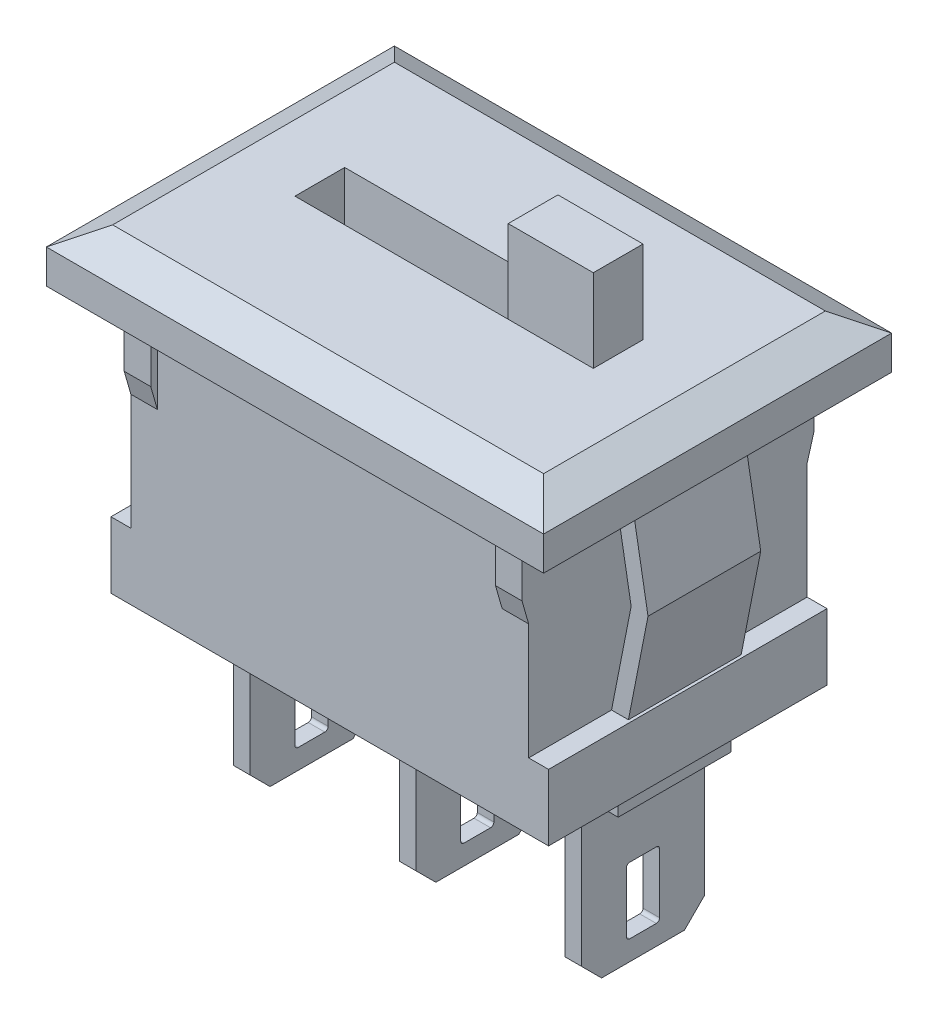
ISO-10303-21;
HEADER;
FILE_DESCRIPTION(('STEP AP214'),'2;1');
FILE_NAME('part.step','',(''),(''),'','','');
FILE_SCHEMA(('AUTOMOTIVE_DESIGN { 1 0 10303 214 1 1 1 1 }'));
ENDSEC;
DATA;
#1=APPLICATION_CONTEXT('core data for automotive mechanical design processes');
#2=APPLICATION_PROTOCOL_DEFINITION('international standard','automotive_design',2000,#1);
#3=PRODUCT_CONTEXT('',#1,'mechanical');
#4=PRODUCT('Part','Part','',(#3));
#5=PRODUCT_RELATED_PRODUCT_CATEGORY('part','',(#4));
#6=PRODUCT_DEFINITION_FORMATION('','',#4);
#7=PRODUCT_DEFINITION_CONTEXT('part definition',#1,'design');
#8=PRODUCT_DEFINITION('design','',#6,#7);
#9=PRODUCT_DEFINITION_SHAPE('','',#8);
#10=(LENGTH_UNIT() NAMED_UNIT(*) SI_UNIT(.MILLI.,.METRE.));
#11=(NAMED_UNIT(*) PLANE_ANGLE_UNIT() SI_UNIT($,.RADIAN.));
#12=(NAMED_UNIT(*) SI_UNIT($,.STERADIAN.) SOLID_ANGLE_UNIT());
#13=UNCERTAINTY_MEASURE_WITH_UNIT(LENGTH_MEASURE(1.E-05),#10,'distance_accuracy_value','');
#14=(GEOMETRIC_REPRESENTATION_CONTEXT(3) GLOBAL_UNCERTAINTY_ASSIGNED_CONTEXT((#13)) GLOBAL_UNIT_ASSIGNED_CONTEXT((#10,
#11,#12)) REPRESENTATION_CONTEXT('',''));
#15=CARTESIAN_POINT('',(0.,0.,0.));
#16=DIRECTION('',(0.,0.,1.));
#17=DIRECTION('',(1.,0.,0.));
#18=AXIS2_PLACEMENT_3D('',#15,#16,#17);
#19=CARTESIAN_POINT('',(4.49999999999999,0.1,0.749999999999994));
#20=DIRECTION('',(0.,0.,1.));
#21=DIRECTION('',(1.,0.,0.));
#22=AXIS2_PLACEMENT_3D('',#19,#20,#21);
#23=PLANE('',#22);
#24=DIRECTION('',(0.,-1.,0.));
#25=VECTOR('',#24,1.);
#26=CARTESIAN_POINT('',(1.93259835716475,4.1,0.749999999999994));
#27=LINE('',#26,#25);
#28=CARTESIAN_POINT('',(1.93259835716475,1.6,0.749999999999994));
#29=VERTEX_POINT('',#28);
#30=CARTESIAN_POINT('',(1.93259835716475,0.1,0.749999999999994));
#31=VERTEX_POINT('',#30);
#32=EDGE_CURVE('E3794',#29,#31,#27,.T.);
#33=ORIENTED_EDGE('',*,*,#32,.T.);
#34=DIRECTION('',(1.,0.,0.));
#35=VECTOR('',#34,1.);
#36=CARTESIAN_POINT('',(4.49999999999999,0.1,0.749999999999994));
#37=LINE('',#36,#35);
#38=CARTESIAN_POINT('',(-4.49999999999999,0.1,0.749999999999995));
#39=VERTEX_POINT('',#38);
#40=EDGE_CURVE('E907',#39,#31,#37,.T.);
#41=ORIENTED_EDGE('',*,*,#40,.F.);
#42=DIRECTION('',(0.,1.,0.));
#43=VECTOR('',#42,1.);
#44=CARTESIAN_POINT('',(-4.49999999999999,0.1,0.749999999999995));
#45=LINE('',#44,#43);
#46=CARTESIAN_POINT('',(-4.49999999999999,1.6,0.749999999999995));
#47=VERTEX_POINT('',#46);
#48=EDGE_CURVE('E918',#39,#47,#45,.T.);
#49=ORIENTED_EDGE('',*,*,#48,.T.);
#50=DIRECTION('',(1.,0.,0.));
#51=VECTOR('',#50,1.);
#52=CARTESIAN_POINT('',(4.49999999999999,1.6,0.749999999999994));
#53=LINE('',#52,#51);
#54=EDGE_CURVE('E904',#47,#29,#53,.T.);
#55=ORIENTED_EDGE('',*,*,#54,.T.);
#56=EDGE_LOOP('',(#33,#41,#49,#55));
#57=FACE_BOUND('',#56,.T.);
#58=ADVANCED_FACE('F42',(#57),#23,.F.);
#59=CARTESIAN_POINT('',(4.49999999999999,0.1,-0.749999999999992));
#60=DIRECTION('',(0.,0.,-1.));
#61=DIRECTION('',(-1.,0.,0.));
#62=AXIS2_PLACEMENT_3D('',#59,#60,#61);
#63=PLANE('',#62);
#64=DIRECTION('',(0.,-1.,0.));
#65=VECTOR('',#64,1.);
#66=CARTESIAN_POINT('',(1.93259835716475,4.1,-0.749999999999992));
#67=LINE('',#66,#65);
#68=CARTESIAN_POINT('',(1.93259835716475,1.6,-0.749999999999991));
#69=VERTEX_POINT('',#68);
#70=CARTESIAN_POINT('',(1.93259835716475,0.1,-0.749999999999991));
#71=VERTEX_POINT('',#70);
#72=EDGE_CURVE('E65',#69,#71,#67,.T.);
#73=ORIENTED_EDGE('',*,*,#72,.F.);
#74=DIRECTION('',(-1.,0.,0.));
#75=VECTOR('',#74,1.);
#76=CARTESIAN_POINT('',(4.49999999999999,1.6,-0.749999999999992));
#77=LINE('',#76,#75);
#78=CARTESIAN_POINT('',(-4.49999999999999,1.6,-0.749999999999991));
#79=VERTEX_POINT('',#78);
#80=EDGE_CURVE('E911',#69,#79,#77,.T.);
#81=ORIENTED_EDGE('',*,*,#80,.T.);
#82=DIRECTION('',(0.,1.,0.));
#83=VECTOR('',#82,1.);
#84=CARTESIAN_POINT('',(-4.49999999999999,0.1,-0.749999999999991));
#85=LINE('',#84,#83);
#86=CARTESIAN_POINT('',(-4.49999999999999,0.1,-0.749999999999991));
#87=VERTEX_POINT('',#86);
#88=EDGE_CURVE('E909',#87,#79,#85,.T.);
#89=ORIENTED_EDGE('',*,*,#88,.F.);
#90=DIRECTION('',(-1.,0.,0.));
#91=VECTOR('',#90,1.);
#92=CARTESIAN_POINT('',(4.49999999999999,0.1,-0.749999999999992));
#93=LINE('',#92,#91);
#94=EDGE_CURVE('E901',#71,#87,#93,.T.);
#95=ORIENTED_EDGE('',*,*,#94,.F.);
#96=EDGE_LOOP('',(#73,#81,#89,#95));
#97=FACE_BOUND('',#96,.T.);
#98=ADVANCED_FACE('F2005',(#97),#63,.F.);
#99=CARTESIAN_POINT('',(0.,0.1,0.));
#100=DIRECTION('',(0.,-1.,0.));
#101=DIRECTION('',(0.,0.,-1.));
#102=AXIS2_PLACEMENT_3D('',#99,#100,#101);
#103=PLANE('',#102);
#104=DIRECTION('',(0.,0.,1.));
#105=VECTOR('',#104,1.);
#106=CARTESIAN_POINT('',(1.93259835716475,0.1,-0.749999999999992));
#107=LINE('',#106,#105);
#108=EDGE_CURVE('E891',#71,#31,#107,.T.);
#109=ORIENTED_EDGE('',*,*,#108,.F.);
#110=ORIENTED_EDGE('',*,*,#94,.T.);
#111=DIRECTION('',(0.,0.,1.));
#112=VECTOR('',#111,1.);
#113=CARTESIAN_POINT('',(-4.49999999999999,0.1,-0.749999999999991));
#114=LINE('',#113,#112);
#115=EDGE_CURVE('E903',#87,#39,#114,.T.);
#116=ORIENTED_EDGE('',*,*,#115,.T.);
#117=ORIENTED_EDGE('',*,*,#40,.T.);
#118=EDGE_LOOP('',(#109,#110,#116,#117));
#119=FACE_BOUND('',#118,.T.);
#120=ADVANCED_FACE('F2011',(#119),#103,.F.);
#121=CARTESIAN_POINT('',(0.25,-8.1,2.63426029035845));
#122=DIRECTION('',(0.,-0.555555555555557,-0.831479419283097));
#123=DIRECTION('',(0.,0.831479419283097,-0.555555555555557));
#124=AXIS2_PLACEMENT_3D('',#121,#122,#123);
#125=PLANE('',#124);
#126=DIRECTION('',(0.,-0.831479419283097,0.555555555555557));
#127=VECTOR('',#126,1.);
#128=CARTESIAN_POINT('',(-0.25,-8.1,2.63426029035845));
#129=LINE('',#128,#127);
#130=CARTESIAN_POINT('',(-0.25,-8.1,2.63426029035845));
#131=VERTEX_POINT('',#130);
#132=CARTESIAN_POINT('',(-0.25,-8.72222222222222,3.05));
#133=VERTEX_POINT('',#132);
#134=EDGE_CURVE('E1888',#131,#133,#129,.T.);
#135=ORIENTED_EDGE('',*,*,#134,.T.);
#136=DIRECTION('',(-1.,0.,0.));
#137=VECTOR('',#136,1.);
#138=CARTESIAN_POINT('',(0.25,-8.72222222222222,3.05));
#139=LINE('',#138,#137);
#140=CARTESIAN_POINT('',(0.25,-8.72222222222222,3.05));
#141=VERTEX_POINT('',#140);
#142=EDGE_CURVE('E50',#141,#133,#139,.T.);
#143=ORIENTED_EDGE('',*,*,#142,.F.);
#144=DIRECTION('',(0.,-0.831479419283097,0.555555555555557));
#145=VECTOR('',#144,1.);
#146=CARTESIAN_POINT('',(0.25,-8.1,2.63426029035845));
#147=LINE('',#146,#145);
#148=CARTESIAN_POINT('',(0.25,-8.1,2.63426029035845));
#149=VERTEX_POINT('',#148);
#150=EDGE_CURVE('E1860',#149,#141,#147,.T.);
#151=ORIENTED_EDGE('',*,*,#150,.F.);
#152=DIRECTION('',(-1.,0.,0.));
#153=VECTOR('',#152,1.);
#154=CARTESIAN_POINT('',(0.25,-8.1,2.63426029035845));
#155=LINE('',#154,#153);
#156=EDGE_CURVE('E11',#149,#131,#155,.T.);
#157=ORIENTED_EDGE('',*,*,#156,.T.);
#158=EDGE_LOOP('',(#135,#143,#151,#157));
#159=FACE_BOUND('',#158,.T.);
#160=ADVANCED_FACE('F44',(#159),#125,.F.);
#161=CARTESIAN_POINT('',(0.25,-8.72222222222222,3.05));
#162=DIRECTION('',(0.,0.831479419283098,-0.555555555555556));
#163=DIRECTION('',(0.,0.555555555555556,0.831479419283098));
#164=AXIS2_PLACEMENT_3D('',#161,#162,#163);
#165=PLANE('',#164);
#166=DIRECTION('',(0.,-0.555555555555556,-0.831479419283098));
#167=VECTOR('',#166,1.);
#168=CARTESIAN_POINT('',(-0.25,-8.72222222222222,3.05));
#169=LINE('',#168,#167);
#170=CARTESIAN_POINT('',(-0.25,-9.,2.63426029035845));
#171=VERTEX_POINT('',#170);
#172=EDGE_CURVE('E1890',#133,#171,#169,.T.);
#173=ORIENTED_EDGE('',*,*,#172,.T.);
#174=DIRECTION('',(-1.,0.,0.));
#175=VECTOR('',#174,1.);
#176=CARTESIAN_POINT('',(0.25,-9.,2.63426029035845));
#177=LINE('',#176,#175);
#178=CARTESIAN_POINT('',(0.25,-9.,2.63426029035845));
#179=VERTEX_POINT('',#178);
#180=EDGE_CURVE('E1934',#179,#171,#177,.T.);
#181=ORIENTED_EDGE('',*,*,#180,.F.);
#182=DIRECTION('',(0.,-0.555555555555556,-0.831479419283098));
#183=VECTOR('',#182,1.);
#184=CARTESIAN_POINT('',(0.25,-8.72222222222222,3.05));
#185=LINE('',#184,#183);
#186=EDGE_CURVE('E1863',#141,#179,#185,.T.);
#187=ORIENTED_EDGE('',*,*,#186,.F.);
#188=ORIENTED_EDGE('',*,*,#142,.T.);
#189=EDGE_LOOP('',(#173,#181,#187,#188));
#190=FACE_BOUND('',#189,.T.);
#191=ADVANCED_FACE('F1941',(#190),#165,.F.);
#192=CARTESIAN_POINT('',(0.25,-9.,2.63426029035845));
#193=DIRECTION('',(0.,0.555555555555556,0.831479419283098));
#194=DIRECTION('',(0.,-0.831479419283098,0.555555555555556));
#195=AXIS2_PLACEMENT_3D('',#192,#193,#194);
#196=PLANE('',#195);
#197=DIRECTION('',(0.,0.831479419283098,-0.555555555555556));
#198=VECTOR('',#197,1.);
#199=CARTESIAN_POINT('',(-0.25,-9.,2.63426029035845));
#200=LINE('',#199,#198);
#201=CARTESIAN_POINT('',(-0.25,-8.37444815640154,2.21629588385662));
#202=VERTEX_POINT('',#201);
#203=EDGE_CURVE('E1892',#171,#202,#200,.T.);
#204=ORIENTED_EDGE('',*,*,#203,.T.);
#205=DIRECTION('',(-1.,0.,0.));
#206=VECTOR('',#205,1.);
#207=CARTESIAN_POINT('',(0.25,-8.37444815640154,2.21629588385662));
#208=LINE('',#207,#206);
#209=CARTESIAN_POINT('',(0.25,-8.37444815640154,2.21629588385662));
#210=VERTEX_POINT('',#209);
#211=EDGE_CURVE('E1931',#210,#202,#208,.T.);
#212=ORIENTED_EDGE('',*,*,#211,.F.);
#213=DIRECTION('',(0.,0.831479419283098,-0.555555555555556));
#214=VECTOR('',#213,1.);
#215=CARTESIAN_POINT('',(0.25,-9.,2.63426029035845));
#216=LINE('',#215,#214);
#217=EDGE_CURVE('E1865',#179,#210,#216,.T.);
#218=ORIENTED_EDGE('',*,*,#217,.F.);
#219=ORIENTED_EDGE('',*,*,#180,.T.);
#220=EDGE_LOOP('',(#204,#212,#218,#219));
#221=FACE_BOUND('',#220,.T.);
#222=ADVANCED_FACE('F1952',(#221),#196,.F.);
#223=CARTESIAN_POINT('',(0.25,-8.48555926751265,2.05));
#224=DIRECTION('',(-1.,0.,0.));
#225=DIRECTION('',(0.,0.,1.));
#226=AXIS2_PLACEMENT_3D('',#223,#224,#225);
#227=CYLINDRICAL_SURFACE('',#226,0.2);
#228=CARTESIAN_POINT('',(-0.25,-8.48555926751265,2.05));
#229=DIRECTION('',(-1.,0.,0.));
#230=DIRECTION('',(0.,0.,1.));
#231=AXIS2_PLACEMENT_3D('',#228,#229,#230);
#232=CIRCLE('',#231,0.2);
#233=CARTESIAN_POINT('',(-0.25,-8.48555926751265,1.85));
#234=VERTEX_POINT('',#233);
#235=EDGE_CURVE('E1894',#202,#234,#232,.T.);
#236=ORIENTED_EDGE('',*,*,#235,.T.);
#237=DIRECTION('',(-1.,0.,0.));
#238=VECTOR('',#237,1.);
#239=CARTESIAN_POINT('',(0.25,-8.48555926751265,1.85));
#240=LINE('',#239,#238);
#241=CARTESIAN_POINT('',(0.25,-8.48555926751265,1.85));
#242=VERTEX_POINT('',#241);
#243=EDGE_CURVE('E1928',#242,#234,#240,.T.);
#244=ORIENTED_EDGE('',*,*,#243,.F.);
#245=CARTESIAN_POINT('',(0.25,-8.48555926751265,2.05));
#246=DIRECTION('',(-1.,0.,0.));
#247=DIRECTION('',(0.,0.,1.));
#248=AXIS2_PLACEMENT_3D('',#245,#246,#247);
#249=CIRCLE('',#248,0.2);
#250=EDGE_CURVE('E1867',#210,#242,#249,.T.);
#251=ORIENTED_EDGE('',*,*,#250,.F.);
#252=ORIENTED_EDGE('',*,*,#211,.T.);
#253=EDGE_LOOP('',(#236,#244,#251,#252));
#254=FACE_BOUND('',#253,.T.);
#255=ADVANCED_FACE('F1956',(#254),#227,.F.);
#256=CARTESIAN_POINT('',(0.25,-8.48555926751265,1.85));
#257=DIRECTION('',(0.,0.,-1.));
#258=DIRECTION('',(0.,1.,0.));
#259=AXIS2_PLACEMENT_3D('',#256,#257,#258);
#260=PLANE('',#259);
#261=DIRECTION('',(0.,-1.,0.));
#262=VECTOR('',#261,1.);
#263=CARTESIAN_POINT('',(-0.25,-8.48555926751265,1.85));
#264=LINE('',#263,#262);
#265=CARTESIAN_POINT('',(-0.25,-13.1,1.85));
#266=VERTEX_POINT('',#265);
#267=EDGE_CURVE('E1896',#234,#266,#264,.T.);
#268=ORIENTED_EDGE('',*,*,#267,.T.);
#269=DIRECTION('',(-1.,0.,0.));
#270=VECTOR('',#269,1.);
#271=CARTESIAN_POINT('',(0.25,-13.1,1.85));
#272=LINE('',#271,#270);
#273=CARTESIAN_POINT('',(0.25,-13.1,1.85));
#274=VERTEX_POINT('',#273);
#275=EDGE_CURVE('E1925',#274,#266,#272,.T.);
#276=ORIENTED_EDGE('',*,*,#275,.F.);
#277=DIRECTION('',(0.,-1.,0.));
#278=VECTOR('',#277,1.);
#279=CARTESIAN_POINT('',(0.25,-8.48555926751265,1.85));
#280=LINE('',#279,#278);
#281=EDGE_CURVE('E1869',#242,#274,#280,.T.);
#282=ORIENTED_EDGE('',*,*,#281,.F.);
#283=ORIENTED_EDGE('',*,*,#243,.T.);
#284=EDGE_LOOP('',(#268,#276,#282,#283));
#285=FACE_BOUND('',#284,.T.);
#286=ADVANCED_FACE('F1995',(#285),#260,.F.);
#287=CARTESIAN_POINT('',(0.25,-13.1,1.85));
#288=DIRECTION('',(0.,0.707106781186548,-0.707106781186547));
#289=DIRECTION('',(0.,0.707106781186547,0.707106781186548));
#290=AXIS2_PLACEMENT_3D('',#287,#288,#289);
#291=PLANE('',#290);
#292=DIRECTION('',(0.,-0.707106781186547,-0.707106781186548));
#293=VECTOR('',#292,1.);
#294=CARTESIAN_POINT('',(-0.25,-13.1,1.85));
#295=LINE('',#294,#293);
#296=CARTESIAN_POINT('',(-0.25,-13.7,1.25));
#297=VERTEX_POINT('',#296);
#298=EDGE_CURVE('E1898',#266,#297,#295,.T.);
#299=ORIENTED_EDGE('',*,*,#298,.T.);
#300=DIRECTION('',(-1.,0.,0.));
#301=VECTOR('',#300,1.);
#302=CARTESIAN_POINT('',(0.25,-13.7,1.25));
#303=LINE('',#302,#301);
#304=CARTESIAN_POINT('',(0.25,-13.7,1.25));
#305=VERTEX_POINT('',#304);
#306=EDGE_CURVE('E1922',#305,#297,#303,.T.);
#307=ORIENTED_EDGE('',*,*,#306,.F.);
#308=DIRECTION('',(0.,-0.707106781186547,-0.707106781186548));
#309=VECTOR('',#308,1.);
#310=CARTESIAN_POINT('',(0.25,-13.1,1.85));
#311=LINE('',#310,#309);
#312=EDGE_CURVE('E1871',#274,#305,#311,.T.);
#313=ORIENTED_EDGE('',*,*,#312,.F.);
#314=ORIENTED_EDGE('',*,*,#275,.T.);
#315=EDGE_LOOP('',(#299,#307,#313,#314));
#316=FACE_BOUND('',#315,.T.);
#317=ADVANCED_FACE('F1993',(#316),#291,.F.);
#318=CARTESIAN_POINT('',(0.25,-13.7,1.25));
#319=DIRECTION('',(0.,1.,0.));
#320=DIRECTION('',(0.,0.,1.));
#321=AXIS2_PLACEMENT_3D('',#318,#319,#320);
#322=PLANE('',#321);
#323=DIRECTION('',(0.,0.,-1.));
#324=VECTOR('',#323,1.);
#325=CARTESIAN_POINT('',(-0.25,-13.7,1.25));
#326=LINE('',#325,#324);
#327=CARTESIAN_POINT('',(-0.25,-13.7,-1.25));
#328=VERTEX_POINT('',#327);
#329=EDGE_CURVE('E1900',#297,#328,#326,.T.);
#330=ORIENTED_EDGE('',*,*,#329,.T.);
#331=DIRECTION('',(-1.,0.,0.));
#332=VECTOR('',#331,1.);
#333=CARTESIAN_POINT('',(0.25,-13.7,-1.25));
#334=LINE('',#333,#332);
#335=CARTESIAN_POINT('',(0.25,-13.7,-1.25));
#336=VERTEX_POINT('',#335);
#337=EDGE_CURVE('E1835',#336,#328,#334,.T.);
#338=ORIENTED_EDGE('',*,*,#337,.F.);
#339=DIRECTION('',(0.,0.,-1.));
#340=VECTOR('',#339,1.);
#341=CARTESIAN_POINT('',(0.25,-13.7,1.25));
#342=LINE('',#341,#340);
#343=EDGE_CURVE('E1873',#305,#336,#342,.T.);
#344=ORIENTED_EDGE('',*,*,#343,.F.);
#345=ORIENTED_EDGE('',*,*,#306,.T.);
#346=EDGE_LOOP('',(#330,#338,#344,#345));
#347=FACE_BOUND('',#346,.T.);
#348=ADVANCED_FACE('F1988',(#347),#322,.F.);
#349=CARTESIAN_POINT('',(0.25,-13.1,0.));
#350=DIRECTION('',(0.,-1.,0.));
#351=DIRECTION('',(0.,0.,-1.));
#352=AXIS2_PLACEMENT_3D('',#349,#350,#351);
#353=PLANE('',#352);
#354=DIRECTION('',(0.,0.,1.));
#355=VECTOR('',#354,1.);
#356=CARTESIAN_POINT('',(-0.25,-13.1,0.));
#357=LINE('',#356,#355);
#358=CARTESIAN_POINT('',(-0.25,-13.1,-0.399999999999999));
#359=VERTEX_POINT('',#358);
#360=CARTESIAN_POINT('',(-0.25,-13.1,0.399999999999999));
#361=VERTEX_POINT('',#360);
#362=EDGE_CURVE('E1902',#359,#361,#357,.T.);
#363=ORIENTED_EDGE('',*,*,#362,.T.);
#364=DIRECTION('',(-1.,0.,0.));
#365=VECTOR('',#364,1.);
#366=CARTESIAN_POINT('',(0.25,-13.1,0.399999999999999));
#367=LINE('',#366,#365);
#368=CARTESIAN_POINT('',(0.25,-13.1,0.399999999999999));
#369=VERTEX_POINT('',#368);
#370=EDGE_CURVE('E1919',#369,#361,#367,.T.);
#371=ORIENTED_EDGE('',*,*,#370,.F.);
#372=DIRECTION('',(0.,0.,1.));
#373=VECTOR('',#372,1.);
#374=CARTESIAN_POINT('',(0.25,-13.1,0.));
#375=LINE('',#374,#373);
#376=CARTESIAN_POINT('',(0.25,-13.1,-0.399999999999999));
#377=VERTEX_POINT('',#376);
#378=EDGE_CURVE('E1875',#377,#369,#375,.T.);
#379=ORIENTED_EDGE('',*,*,#378,.F.);
#380=DIRECTION('',(-1.,0.,0.));
#381=VECTOR('',#380,1.);
#382=CARTESIAN_POINT('',(0.25,-13.1,-0.399999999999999));
#383=LINE('',#382,#381);
#384=EDGE_CURVE('E1832',#377,#359,#383,.T.);
#385=ORIENTED_EDGE('',*,*,#384,.T.);
#386=EDGE_LOOP('',(#363,#371,#379,#385));
#387=FACE_BOUND('',#386,.T.);
#388=ADVANCED_FACE('F2540',(#387),#353,.F.);
#389=CARTESIAN_POINT('',(0.25,-13.,0.4));
#390=DIRECTION('',(-1.,0.,0.));
#391=DIRECTION('',(0.,0.,1.));
#392=AXIS2_PLACEMENT_3D('',#389,#390,#391);
#393=CYLINDRICAL_SURFACE('',#392,0.0999999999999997);
#394=CARTESIAN_POINT('',(-0.25,-13.,0.4));
#395=DIRECTION('',(-1.,0.,0.));
#396=DIRECTION('',(0.,0.,1.));
#397=AXIS2_PLACEMENT_3D('',#394,#395,#396);
#398=CIRCLE('',#397,0.0999999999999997);
#399=CARTESIAN_POINT('',(-0.25,-13.,0.5));
#400=VERTEX_POINT('',#399);
#401=EDGE_CURVE('E1904',#361,#400,#398,.T.);
#402=ORIENTED_EDGE('',*,*,#401,.T.);
#403=DIRECTION('',(-1.,0.,0.));
#404=VECTOR('',#403,1.);
#405=CARTESIAN_POINT('',(0.25,-13.,0.5));
#406=LINE('',#405,#404);
#407=CARTESIAN_POINT('',(0.25,-13.,0.5));
#408=VERTEX_POINT('',#407);
#409=EDGE_CURVE('E1916',#408,#400,#406,.T.);
#410=ORIENTED_EDGE('',*,*,#409,.F.);
#411=CARTESIAN_POINT('',(0.25,-13.,0.4));
#412=DIRECTION('',(-1.,0.,0.));
#413=DIRECTION('',(0.,0.,1.));
#414=AXIS2_PLACEMENT_3D('',#411,#412,#413);
#415=CIRCLE('',#414,0.0999999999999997);
#416=EDGE_CURVE('E1877',#369,#408,#415,.T.);
#417=ORIENTED_EDGE('',*,*,#416,.F.);
#418=ORIENTED_EDGE('',*,*,#370,.T.);
#419=EDGE_LOOP('',(#402,#410,#417,#418));
#420=FACE_BOUND('',#419,.T.);
#421=ADVANCED_FACE('F2536',(#420),#393,.F.);
#422=CARTESIAN_POINT('',(0.25,-13.,0.5));
#423=DIRECTION('',(0.,0.,1.));
#424=DIRECTION('',(1.,0.,0.));
#425=AXIS2_PLACEMENT_3D('',#422,#423,#424);
#426=PLANE('',#425);
#427=DIRECTION('',(0.,1.,0.));
#428=VECTOR('',#427,1.);
#429=CARTESIAN_POINT('',(-0.25,-13.,0.5));
#430=LINE('',#429,#428);
#431=CARTESIAN_POINT('',(-0.25,-11.2,0.5));
#432=VERTEX_POINT('',#431);
#433=EDGE_CURVE('E1906',#400,#432,#430,.T.);
#434=ORIENTED_EDGE('',*,*,#433,.T.);
#435=DIRECTION('',(-1.,0.,0.));
#436=VECTOR('',#435,1.);
#437=CARTESIAN_POINT('',(0.25,-11.2,0.5));
#438=LINE('',#437,#436);
#439=CARTESIAN_POINT('',(0.25,-11.2,0.5));
#440=VERTEX_POINT('',#439);
#441=EDGE_CURVE('E1913',#440,#432,#438,.T.);
#442=ORIENTED_EDGE('',*,*,#441,.F.);
#443=DIRECTION('',(0.,1.,0.));
#444=VECTOR('',#443,1.);
#445=CARTESIAN_POINT('',(0.25,-13.,0.5));
#446=LINE('',#445,#444);
#447=EDGE_CURVE('E1879',#408,#440,#446,.T.);
#448=ORIENTED_EDGE('',*,*,#447,.F.);
#449=ORIENTED_EDGE('',*,*,#409,.T.);
#450=EDGE_LOOP('',(#434,#442,#448,#449));
#451=FACE_BOUND('',#450,.T.);
#452=ADVANCED_FACE('F2532',(#451),#426,.F.);
#453=CARTESIAN_POINT('',(0.25,-11.2,0.4));
#454=DIRECTION('',(-1.,0.,0.));
#455=DIRECTION('',(0.,0.,1.));
#456=AXIS2_PLACEMENT_3D('',#453,#454,#455);
#457=CYLINDRICAL_SURFACE('',#456,0.0999999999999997);
#458=CARTESIAN_POINT('',(-0.25,-11.2,0.4));
#459=DIRECTION('',(-1.,0.,0.));
#460=DIRECTION('',(0.,0.,1.));
#461=AXIS2_PLACEMENT_3D('',#458,#459,#460);
#462=CIRCLE('',#461,0.0999999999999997);
#463=CARTESIAN_POINT('',(-0.25,-11.1,0.399999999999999));
#464=VERTEX_POINT('',#463);
#465=EDGE_CURVE('E1908',#432,#464,#462,.T.);
#466=ORIENTED_EDGE('',*,*,#465,.T.);
#467=DIRECTION('',(-1.,0.,0.));
#468=VECTOR('',#467,1.);
#469=CARTESIAN_POINT('',(0.25,-11.1,0.399999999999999));
#470=LINE('',#469,#468);
#471=CARTESIAN_POINT('',(0.25,-11.1,0.399999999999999));
#472=VERTEX_POINT('',#471);
#473=EDGE_CURVE('E1885',#472,#464,#470,.T.);
#474=ORIENTED_EDGE('',*,*,#473,.F.);
#475=CARTESIAN_POINT('',(0.25,-11.2,0.4));
#476=DIRECTION('',(-1.,0.,0.));
#477=DIRECTION('',(0.,0.,1.));
#478=AXIS2_PLACEMENT_3D('',#475,#476,#477);
#479=CIRCLE('',#478,0.0999999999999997);
#480=EDGE_CURVE('E1881',#440,#472,#479,.T.);
#481=ORIENTED_EDGE('',*,*,#480,.F.);
#482=ORIENTED_EDGE('',*,*,#441,.T.);
#483=EDGE_LOOP('',(#466,#474,#481,#482));
#484=FACE_BOUND('',#483,.T.);
#485=ADVANCED_FACE('F2528',(#484),#457,.F.);
#486=CARTESIAN_POINT('',(0.25,-11.1,0.399999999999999));
#487=DIRECTION('',(0.,1.,0.));
#488=DIRECTION('',(0.,0.,1.));
#489=AXIS2_PLACEMENT_3D('',#486,#487,#488);
#490=PLANE('',#489);
#491=DIRECTION('',(0.,0.,-1.));
#492=VECTOR('',#491,1.);
#493=CARTESIAN_POINT('',(-0.25,-11.1,0.399999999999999));
#494=LINE('',#493,#492);
#495=CARTESIAN_POINT('',(-0.25,-11.1,-0.399999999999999));
#496=VERTEX_POINT('',#495);
#497=EDGE_CURVE('E1861',#464,#496,#494,.T.);
#498=ORIENTED_EDGE('',*,*,#497,.T.);
#499=DIRECTION('',(-1.,0.,0.));
#500=VECTOR('',#499,1.);
#501=CARTESIAN_POINT('',(0.25,-11.1,-0.399999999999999));
#502=LINE('',#501,#500);
#503=CARTESIAN_POINT('',(0.25,-11.1,-0.399999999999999));
#504=VERTEX_POINT('',#503);
#505=EDGE_CURVE('E1798',#504,#496,#502,.T.);
#506=ORIENTED_EDGE('',*,*,#505,.F.);
#507=DIRECTION('',(0.,0.,-1.));
#508=VECTOR('',#507,1.);
#509=CARTESIAN_POINT('',(0.25,-11.1,0.399999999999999));
#510=LINE('',#509,#508);
#511=EDGE_CURVE('E1883',#472,#504,#510,.T.);
#512=ORIENTED_EDGE('',*,*,#511,.F.);
#513=ORIENTED_EDGE('',*,*,#473,.T.);
#514=EDGE_LOOP('',(#498,#506,#512,#513));
#515=FACE_BOUND('',#514,.T.);
#516=ADVANCED_FACE('F2521',(#515),#490,.F.);
#517=CARTESIAN_POINT('',(0.25,-8.48555926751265,2.05));
#518=DIRECTION('',(-1.,0.,0.));
#519=DIRECTION('',(0.,0.,1.));
#520=AXIS2_PLACEMENT_3D('',#517,#518,#519);
#521=PLANE('',#520);
#522=CARTESIAN_POINT('',(0.25,-13.,-0.4));
#523=DIRECTION('',(1.,0.,0.));
#524=DIRECTION('',(0.,0.,-1.));
#525=AXIS2_PLACEMENT_3D('',#522,#523,#524);
#526=CIRCLE('',#525,0.0999999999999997);
#527=CARTESIAN_POINT('',(0.25,-13.,-0.5));
#528=VERTEX_POINT('',#527);
#529=EDGE_CURVE('E1789',#377,#528,#526,.T.);
#530=ORIENTED_EDGE('',*,*,#529,.F.);
#531=ORIENTED_EDGE('',*,*,#378,.T.);
#532=ORIENTED_EDGE('',*,*,#416,.T.);
#533=ORIENTED_EDGE('',*,*,#447,.T.);
#534=ORIENTED_EDGE('',*,*,#480,.T.);
#535=ORIENTED_EDGE('',*,*,#511,.T.);
#536=CARTESIAN_POINT('',(0.25,-11.2,-0.4));
#537=DIRECTION('',(1.,0.,0.));
#538=DIRECTION('',(0.,0.,-1.));
#539=AXIS2_PLACEMENT_3D('',#536,#537,#538);
#540=CIRCLE('',#539,0.0999999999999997);
#541=CARTESIAN_POINT('',(0.25,-11.2,-0.5));
#542=VERTEX_POINT('',#541);
#543=EDGE_CURVE('E1795',#542,#504,#540,.T.);
#544=ORIENTED_EDGE('',*,*,#543,.F.);
#545=DIRECTION('',(0.,1.,0.));
#546=VECTOR('',#545,1.);
#547=CARTESIAN_POINT('',(0.25,-13.,-0.5));
#548=LINE('',#547,#546);
#549=EDGE_CURVE('E1792',#528,#542,#548,.T.);
#550=ORIENTED_EDGE('',*,*,#549,.F.);
#551=EDGE_LOOP('',(#530,#531,#532,#533,#534,#535,#544,#550));
#552=FACE_BOUND('',#551,.T.);
#553=DIRECTION('',(0.,0.,1.));
#554=VECTOR('',#553,1.);
#555=CARTESIAN_POINT('',(0.25,-8.1,0.));
#556=LINE('',#555,#554);
#557=CARTESIAN_POINT('',(0.25,-8.1,-2.63426029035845));
#558=VERTEX_POINT('',#557);
#559=EDGE_CURVE('E1857',#558,#149,#556,.T.);
#560=ORIENTED_EDGE('',*,*,#559,.T.);
#561=ORIENTED_EDGE('',*,*,#150,.T.);
#562=ORIENTED_EDGE('',*,*,#186,.T.);
#563=ORIENTED_EDGE('',*,*,#217,.T.);
#564=ORIENTED_EDGE('',*,*,#250,.T.);
#565=ORIENTED_EDGE('',*,*,#281,.T.);
#566=ORIENTED_EDGE('',*,*,#312,.T.);
#567=ORIENTED_EDGE('',*,*,#343,.T.);
#568=DIRECTION('',(0.,-0.707106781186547,0.707106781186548));
#569=VECTOR('',#568,1.);
#570=CARTESIAN_POINT('',(0.25,-13.1,-1.85));
#571=LINE('',#570,#569);
#572=CARTESIAN_POINT('',(0.25,-13.1,-1.85));
#573=VERTEX_POINT('',#572);
#574=EDGE_CURVE('E1786',#573,#336,#571,.T.);
#575=ORIENTED_EDGE('',*,*,#574,.F.);
#576=DIRECTION('',(0.,-1.,0.));
#577=VECTOR('',#576,1.);
#578=CARTESIAN_POINT('',(0.25,-8.48555926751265,-1.85));
#579=LINE('',#578,#577);
#580=CARTESIAN_POINT('',(0.25,-8.48555926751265,-1.85));
#581=VERTEX_POINT('',#580);
#582=EDGE_CURVE('E1783',#581,#573,#579,.T.);
#583=ORIENTED_EDGE('',*,*,#582,.F.);
#584=CARTESIAN_POINT('',(0.25,-8.48555926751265,-2.05));
#585=DIRECTION('',(1.,0.,0.));
#586=DIRECTION('',(0.,0.,-1.));
#587=AXIS2_PLACEMENT_3D('',#584,#585,#586);
#588=CIRCLE('',#587,0.2);
#589=CARTESIAN_POINT('',(0.25,-8.37444815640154,-2.21629588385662));
#590=VERTEX_POINT('',#589);
#591=EDGE_CURVE('E1780',#590,#581,#588,.T.);
#592=ORIENTED_EDGE('',*,*,#591,.F.);
#593=DIRECTION('',(0.,0.831479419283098,0.555555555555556));
#594=VECTOR('',#593,1.);
#595=CARTESIAN_POINT('',(0.25,-9.,-2.63426029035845));
#596=LINE('',#595,#594);
#597=CARTESIAN_POINT('',(0.25,-9.,-2.63426029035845));
#598=VERTEX_POINT('',#597);
#599=EDGE_CURVE('E1777',#598,#590,#596,.T.);
#600=ORIENTED_EDGE('',*,*,#599,.F.);
#601=DIRECTION('',(0.,-0.555555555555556,0.831479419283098));
#602=VECTOR('',#601,1.);
#603=CARTESIAN_POINT('',(0.25,-8.72222222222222,-3.05));
#604=LINE('',#603,#602);
#605=CARTESIAN_POINT('',(0.25,-8.72222222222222,-3.05));
#606=VERTEX_POINT('',#605);
#607=EDGE_CURVE('E1773',#606,#598,#604,.T.);
#608=ORIENTED_EDGE('',*,*,#607,.F.);
#609=DIRECTION('',(0.,-0.831479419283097,-0.555555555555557));
#610=VECTOR('',#609,1.);
#611=CARTESIAN_POINT('',(0.25,-8.1,-2.63426029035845));
#612=LINE('',#611,#610);
#613=EDGE_CURVE('E1770',#558,#606,#612,.T.);
#614=ORIENTED_EDGE('',*,*,#613,.F.);
#615=EDGE_LOOP('',(#560,#561,#562,#563,#564,#565,#566,#567,#575,#583,#592,#600,#608,#614));
#616=FACE_BOUND('',#615,.T.);
#617=ADVANCED_FACE('F1960',(#552,#616),#521,.F.);
#618=CARTESIAN_POINT('',(-0.25,-8.48555926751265,2.05));
#619=DIRECTION('',(-1.,0.,0.));
#620=DIRECTION('',(0.,0.,1.));
#621=AXIS2_PLACEMENT_3D('',#618,#619,#620);
#622=PLANE('',#621);
#623=ORIENTED_EDGE('',*,*,#362,.F.);
#624=CARTESIAN_POINT('',(-0.25,-13.,-0.4));
#625=DIRECTION('',(1.,0.,0.));
#626=DIRECTION('',(0.,0.,-1.));
#627=AXIS2_PLACEMENT_3D('',#624,#625,#626);
#628=CIRCLE('',#627,0.0999999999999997);
#629=CARTESIAN_POINT('',(-0.25,-13.,-0.5));
#630=VERTEX_POINT('',#629);
#631=EDGE_CURVE('E1816',#359,#630,#628,.T.);
#632=ORIENTED_EDGE('',*,*,#631,.T.);
#633=DIRECTION('',(0.,1.,0.));
#634=VECTOR('',#633,1.);
#635=CARTESIAN_POINT('',(-0.25,-13.,-0.5));
#636=LINE('',#635,#634);
#637=CARTESIAN_POINT('',(-0.25,-11.2,-0.5));
#638=VERTEX_POINT('',#637);
#639=EDGE_CURVE('E1819',#630,#638,#636,.T.);
#640=ORIENTED_EDGE('',*,*,#639,.T.);
#641=CARTESIAN_POINT('',(-0.25,-11.2,-0.4));
#642=DIRECTION('',(1.,0.,0.));
#643=DIRECTION('',(0.,0.,-1.));
#644=AXIS2_PLACEMENT_3D('',#641,#642,#643);
#645=CIRCLE('',#644,0.0999999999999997);
#646=EDGE_CURVE('E1774',#638,#496,#645,.T.);
#647=ORIENTED_EDGE('',*,*,#646,.T.);
#648=ORIENTED_EDGE('',*,*,#497,.F.);
#649=ORIENTED_EDGE('',*,*,#465,.F.);
#650=ORIENTED_EDGE('',*,*,#433,.F.);
#651=ORIENTED_EDGE('',*,*,#401,.F.);
#652=EDGE_LOOP('',(#623,#632,#640,#647,#648,#649,#650,#651));
#653=FACE_BOUND('',#652,.T.);
#654=DIRECTION('',(0.,0.,1.));
#655=VECTOR('',#654,1.);
#656=CARTESIAN_POINT('',(-0.25,-8.1,0.));
#657=LINE('',#656,#655);
#658=CARTESIAN_POINT('',(-0.25,-8.1,-2.63426029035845));
#659=VERTEX_POINT('',#658);
#660=EDGE_CURVE('E1856',#659,#131,#657,.T.);
#661=ORIENTED_EDGE('',*,*,#660,.F.);
#662=DIRECTION('',(0.,-0.831479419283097,-0.555555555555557));
#663=VECTOR('',#662,1.);
#664=CARTESIAN_POINT('',(-0.25,-8.1,-2.63426029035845));
#665=LINE('',#664,#663);
#666=CARTESIAN_POINT('',(-0.25,-8.72222222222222,-3.05));
#667=VERTEX_POINT('',#666);
#668=EDGE_CURVE('E1761',#659,#667,#665,.T.);
#669=ORIENTED_EDGE('',*,*,#668,.T.);
#670=DIRECTION('',(0.,-0.555555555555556,0.831479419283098));
#671=VECTOR('',#670,1.);
#672=CARTESIAN_POINT('',(-0.25,-8.72222222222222,-3.05));
#673=LINE('',#672,#671);
#674=CARTESIAN_POINT('',(-0.25,-9.,-2.63426029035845));
#675=VERTEX_POINT('',#674);
#676=EDGE_CURVE('E1801',#667,#675,#673,.T.);
#677=ORIENTED_EDGE('',*,*,#676,.T.);
#678=DIRECTION('',(0.,0.831479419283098,0.555555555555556));
#679=VECTOR('',#678,1.);
#680=CARTESIAN_POINT('',(-0.25,-9.,-2.63426029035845));
#681=LINE('',#680,#679);
#682=CARTESIAN_POINT('',(-0.25,-8.37444815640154,-2.21629588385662));
#683=VERTEX_POINT('',#682);
#684=EDGE_CURVE('E1804',#675,#683,#681,.T.);
#685=ORIENTED_EDGE('',*,*,#684,.T.);
#686=CARTESIAN_POINT('',(-0.25,-8.48555926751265,-2.05));
#687=DIRECTION('',(1.,0.,0.));
#688=DIRECTION('',(0.,0.,-1.));
#689=AXIS2_PLACEMENT_3D('',#686,#687,#688);
#690=CIRCLE('',#689,0.2);
#691=CARTESIAN_POINT('',(-0.25,-8.48555926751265,-1.85));
#692=VERTEX_POINT('',#691);
#693=EDGE_CURVE('E1807',#683,#692,#690,.T.);
#694=ORIENTED_EDGE('',*,*,#693,.T.);
#695=DIRECTION('',(0.,-1.,0.));
#696=VECTOR('',#695,1.);
#697=CARTESIAN_POINT('',(-0.25,-8.48555926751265,-1.85));
#698=LINE('',#697,#696);
#699=CARTESIAN_POINT('',(-0.25,-13.1,-1.85));
#700=VERTEX_POINT('',#699);
#701=EDGE_CURVE('E1810',#692,#700,#698,.T.);
#702=ORIENTED_EDGE('',*,*,#701,.T.);
#703=DIRECTION('',(0.,-0.707106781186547,0.707106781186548));
#704=VECTOR('',#703,1.);
#705=CARTESIAN_POINT('',(-0.25,-13.1,-1.85));
#706=LINE('',#705,#704);
#707=EDGE_CURVE('E1813',#700,#328,#706,.T.);
#708=ORIENTED_EDGE('',*,*,#707,.T.);
#709=ORIENTED_EDGE('',*,*,#329,.F.);
#710=ORIENTED_EDGE('',*,*,#298,.F.);
#711=ORIENTED_EDGE('',*,*,#267,.F.);
#712=ORIENTED_EDGE('',*,*,#235,.F.);
#713=ORIENTED_EDGE('',*,*,#203,.F.);
#714=ORIENTED_EDGE('',*,*,#172,.F.);
#715=ORIENTED_EDGE('',*,*,#134,.F.);
#716=EDGE_LOOP('',(#661,#669,#677,#685,#694,#702,#708,#709,#710,#711,#712,#713,#714,#715));
#717=FACE_BOUND('',#716,.T.);
#718=ADVANCED_FACE('F1947',(#653,#717),#622,.T.);
#719=CARTESIAN_POINT('',(0.25,-8.1,-2.63426029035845));
#720=DIRECTION('',(0.,-0.555555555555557,0.831479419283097));
#721=DIRECTION('',(0.,0.831479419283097,0.555555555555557));
#722=AXIS2_PLACEMENT_3D('',#719,#720,#721);
#723=PLANE('',#722);
#724=ORIENTED_EDGE('',*,*,#668,.F.);
#725=DIRECTION('',(-1.,0.,0.));
#726=VECTOR('',#725,1.);
#727=CARTESIAN_POINT('',(0.25,-8.1,-2.63426029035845));
#728=LINE('',#727,#726);
#729=EDGE_CURVE('E1853',#558,#659,#728,.T.);
#730=ORIENTED_EDGE('',*,*,#729,.F.);
#731=ORIENTED_EDGE('',*,*,#613,.T.);
#732=DIRECTION('',(-1.,0.,0.));
#733=VECTOR('',#732,1.);
#734=CARTESIAN_POINT('',(0.25,-8.72222222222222,-3.05));
#735=LINE('',#734,#733);
#736=EDGE_CURVE('E1850',#606,#667,#735,.T.);
#737=ORIENTED_EDGE('',*,*,#736,.T.);
#738=EDGE_LOOP('',(#724,#730,#731,#737));
#739=FACE_BOUND('',#738,.T.);
#740=ADVANCED_FACE('F1968',(#739),#723,.F.);
#741=CARTESIAN_POINT('',(0.25,-8.72222222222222,-3.05));
#742=DIRECTION('',(0.,0.831479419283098,0.555555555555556));
#743=DIRECTION('',(0.,0.555555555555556,-0.831479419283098));
#744=AXIS2_PLACEMENT_3D('',#741,#742,#743);
#745=PLANE('',#744);
#746=ORIENTED_EDGE('',*,*,#676,.F.);
#747=ORIENTED_EDGE('',*,*,#736,.F.);
#748=ORIENTED_EDGE('',*,*,#607,.T.);
#749=DIRECTION('',(-1.,0.,0.));
#750=VECTOR('',#749,1.);
#751=CARTESIAN_POINT('',(0.25,-9.,-2.63426029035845));
#752=LINE('',#751,#750);
#753=EDGE_CURVE('E1847',#598,#675,#752,.T.);
#754=ORIENTED_EDGE('',*,*,#753,.T.);
#755=EDGE_LOOP('',(#746,#747,#748,#754));
#756=FACE_BOUND('',#755,.T.);
#757=ADVANCED_FACE('F1971',(#756),#745,.F.);
#758=CARTESIAN_POINT('',(0.25,-9.,-2.63426029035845));
#759=DIRECTION('',(0.,0.555555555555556,-0.831479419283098));
#760=DIRECTION('',(0.,-0.831479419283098,-0.555555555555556));
#761=AXIS2_PLACEMENT_3D('',#758,#759,#760);
#762=PLANE('',#761);
#763=ORIENTED_EDGE('',*,*,#684,.F.);
#764=ORIENTED_EDGE('',*,*,#753,.F.);
#765=ORIENTED_EDGE('',*,*,#599,.T.);
#766=DIRECTION('',(-1.,0.,0.));
#767=VECTOR('',#766,1.);
#768=CARTESIAN_POINT('',(0.25,-8.37444815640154,-2.21629588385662));
#769=LINE('',#768,#767);
#770=EDGE_CURVE('E1844',#590,#683,#769,.T.);
#771=ORIENTED_EDGE('',*,*,#770,.T.);
#772=EDGE_LOOP('',(#763,#764,#765,#771));
#773=FACE_BOUND('',#772,.T.);
#774=ADVANCED_FACE('F1974',(#773),#762,.F.);
#775=CARTESIAN_POINT('',(0.25,-8.48555926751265,-2.05));
#776=DIRECTION('',(-1.,0.,0.));
#777=DIRECTION('',(0.,0.,-1.));
#778=AXIS2_PLACEMENT_3D('',#775,#776,#777);
#779=CYLINDRICAL_SURFACE('',#778,0.2);
#780=ORIENTED_EDGE('',*,*,#693,.F.);
#781=ORIENTED_EDGE('',*,*,#770,.F.);
#782=ORIENTED_EDGE('',*,*,#591,.T.);
#783=DIRECTION('',(-1.,0.,0.));
#784=VECTOR('',#783,1.);
#785=CARTESIAN_POINT('',(0.25,-8.48555926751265,-1.85));
#786=LINE('',#785,#784);
#787=EDGE_CURVE('E1841',#581,#692,#786,.T.);
#788=ORIENTED_EDGE('',*,*,#787,.T.);
#789=EDGE_LOOP('',(#780,#781,#782,#788));
#790=FACE_BOUND('',#789,.T.);
#791=ADVANCED_FACE('F1977',(#790),#779,.F.);
#792=CARTESIAN_POINT('',(0.25,-8.48555926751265,-1.85));
#793=DIRECTION('',(0.,0.,1.));
#794=DIRECTION('',(0.,1.,0.));
#795=AXIS2_PLACEMENT_3D('',#792,#793,#794);
#796=PLANE('',#795);
#797=ORIENTED_EDGE('',*,*,#701,.F.);
#798=ORIENTED_EDGE('',*,*,#787,.F.);
#799=ORIENTED_EDGE('',*,*,#582,.T.);
#800=DIRECTION('',(-1.,0.,0.));
#801=VECTOR('',#800,1.);
#802=CARTESIAN_POINT('',(0.25,-13.1,-1.85));
#803=LINE('',#802,#801);
#804=EDGE_CURVE('E1838',#573,#700,#803,.T.);
#805=ORIENTED_EDGE('',*,*,#804,.T.);
#806=EDGE_LOOP('',(#797,#798,#799,#805));
#807=FACE_BOUND('',#806,.T.);
#808=ADVANCED_FACE('F1980',(#807),#796,.F.);
#809=CARTESIAN_POINT('',(0.25,-13.1,-1.85));
#810=DIRECTION('',(0.,0.707106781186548,0.707106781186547));
#811=DIRECTION('',(0.,0.707106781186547,-0.707106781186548));
#812=AXIS2_PLACEMENT_3D('',#809,#810,#811);
#813=PLANE('',#812);
#814=ORIENTED_EDGE('',*,*,#707,.F.);
#815=ORIENTED_EDGE('',*,*,#804,.F.);
#816=ORIENTED_EDGE('',*,*,#574,.T.);
#817=ORIENTED_EDGE('',*,*,#337,.T.);
#818=EDGE_LOOP('',(#814,#815,#816,#817));
#819=FACE_BOUND('',#818,.T.);
#820=ADVANCED_FACE('F1983',(#819),#813,.F.);
#821=CARTESIAN_POINT('',(0.25,-13.,-0.4));
#822=DIRECTION('',(-1.,0.,0.));
#823=DIRECTION('',(0.,0.,-1.));
#824=AXIS2_PLACEMENT_3D('',#821,#822,#823);
#825=CYLINDRICAL_SURFACE('',#824,0.0999999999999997);
#826=ORIENTED_EDGE('',*,*,#631,.F.);
#827=ORIENTED_EDGE('',*,*,#384,.F.);
#828=ORIENTED_EDGE('',*,*,#529,.T.);
#829=DIRECTION('',(-1.,0.,0.));
#830=VECTOR('',#829,1.);
#831=CARTESIAN_POINT('',(0.25,-13.,-0.5));
#832=LINE('',#831,#830);
#833=EDGE_CURVE('E1829',#528,#630,#832,.T.);
#834=ORIENTED_EDGE('',*,*,#833,.T.);
#835=EDGE_LOOP('',(#826,#827,#828,#834));
#836=FACE_BOUND('',#835,.T.);
#837=ADVANCED_FACE('F2502',(#836),#825,.F.);
#838=CARTESIAN_POINT('',(0.25,-13.,-0.5));
#839=DIRECTION('',(0.,0.,-1.));
#840=DIRECTION('',(1.,0.,0.));
#841=AXIS2_PLACEMENT_3D('',#838,#839,#840);
#842=PLANE('',#841);
#843=ORIENTED_EDGE('',*,*,#639,.F.);
#844=ORIENTED_EDGE('',*,*,#833,.F.);
#845=ORIENTED_EDGE('',*,*,#549,.T.);
#846=DIRECTION('',(-1.,0.,0.));
#847=VECTOR('',#846,1.);
#848=CARTESIAN_POINT('',(0.25,-11.2,-0.5));
#849=LINE('',#848,#847);
#850=EDGE_CURVE('E1826',#542,#638,#849,.T.);
#851=ORIENTED_EDGE('',*,*,#850,.T.);
#852=EDGE_LOOP('',(#843,#844,#845,#851));
#853=FACE_BOUND('',#852,.T.);
#854=ADVANCED_FACE('F2498',(#853),#842,.F.);
#855=CARTESIAN_POINT('',(0.25,-11.2,-0.4));
#856=DIRECTION('',(-1.,0.,0.));
#857=DIRECTION('',(0.,0.,-1.));
#858=AXIS2_PLACEMENT_3D('',#855,#856,#857);
#859=CYLINDRICAL_SURFACE('',#858,0.0999999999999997);
#860=ORIENTED_EDGE('',*,*,#646,.F.);
#861=ORIENTED_EDGE('',*,*,#850,.F.);
#862=ORIENTED_EDGE('',*,*,#543,.T.);
#863=ORIENTED_EDGE('',*,*,#505,.T.);
#864=EDGE_LOOP('',(#860,#861,#862,#863));
#865=FACE_BOUND('',#864,.T.);
#866=ADVANCED_FACE('F2443',(#865),#859,.F.);
#867=CARTESIAN_POINT('',(0.,-8.1,0.));
#868=DIRECTION('',(0.,1.,0.));
#869=DIRECTION('',(0.,0.,1.));
#870=AXIS2_PLACEMENT_3D('',#867,#868,#869);
#871=PLANE('',#870);
#872=DIRECTION('',(-1.,0.,0.));
#873=VECTOR('',#872,1.);
#874=CARTESIAN_POINT('',(-4.75,-8.1,2.63426029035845));
#875=LINE('',#874,#873);
#876=CARTESIAN_POINT('',(-4.75,-8.1,2.63426029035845));
#877=VERTEX_POINT('',#876);
#878=CARTESIAN_POINT('',(-5.25,-8.1,2.63426029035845));
#879=VERTEX_POINT('',#878);
#880=EDGE_CURVE('E1263',#877,#879,#875,.T.);
#881=ORIENTED_EDGE('',*,*,#880,.F.);
#882=DIRECTION('',(0.,0.,1.));
#883=VECTOR('',#882,1.);
#884=CARTESIAN_POINT('',(-4.75,-8.1,0.));
#885=LINE('',#884,#883);
#886=CARTESIAN_POINT('',(-4.75,-8.1,-2.63426029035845));
#887=VERTEX_POINT('',#886);
#888=EDGE_CURVE('E1181',#887,#877,#885,.T.);
#889=ORIENTED_EDGE('',*,*,#888,.F.);
#890=DIRECTION('',(-1.,0.,0.));
#891=VECTOR('',#890,1.);
#892=CARTESIAN_POINT('',(-4.75,-8.1,-2.63426029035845));
#893=LINE('',#892,#891);
#894=CARTESIAN_POINT('',(-5.25,-8.1,-2.63426029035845));
#895=VERTEX_POINT('',#894);
#896=EDGE_CURVE('E1178',#887,#895,#893,.T.);
#897=ORIENTED_EDGE('',*,*,#896,.T.);
#898=DIRECTION('',(0.,0.,1.));
#899=VECTOR('',#898,1.);
#900=CARTESIAN_POINT('',(-5.25,-8.1,0.));
#901=LINE('',#900,#899);
#902=EDGE_CURVE('E1180',#895,#879,#901,.T.);
#903=ORIENTED_EDGE('',*,*,#902,.T.);
#904=EDGE_LOOP('',(#881,#889,#897,#903));
#905=FACE_BOUND('',#904,.T.);
#906=DIRECTION('',(0.,0.,-1.));
#907=VECTOR('',#906,1.);
#908=CARTESIAN_POINT('',(3.8,-8.1,1.7));
#909=LINE('',#908,#907);
#910=CARTESIAN_POINT('',(3.8,-8.1,1.7));
#911=VERTEX_POINT('',#910);
#912=CARTESIAN_POINT('',(3.8,-8.1,-1.7));
#913=VERTEX_POINT('',#912);
#914=EDGE_CURVE('E1329',#911,#913,#909,.T.);
#915=ORIENTED_EDGE('',*,*,#914,.F.);
#916=DIRECTION('',(-1.,0.,0.));
#917=VECTOR('',#916,1.);
#918=CARTESIAN_POINT('',(3.8,-8.1,1.7));
#919=LINE('',#918,#917);
#920=CARTESIAN_POINT('',(4.74,-8.1,1.7));
#921=VERTEX_POINT('',#920);
#922=EDGE_CURVE('E1299',#921,#911,#919,.T.);
#923=ORIENTED_EDGE('',*,*,#922,.F.);
#924=DIRECTION('',(0.,0.,1.));
#925=VECTOR('',#924,1.);
#926=CARTESIAN_POINT('',(4.74,-8.1,1.7));
#927=LINE('',#926,#925);
#928=CARTESIAN_POINT('',(4.74,-8.1,-1.7));
#929=VERTEX_POINT('',#928);
#930=EDGE_CURVE('E1317',#929,#921,#927,.T.);
#931=ORIENTED_EDGE('',*,*,#930,.F.);
#932=DIRECTION('',(1.,0.,0.));
#933=VECTOR('',#932,1.);
#934=CARTESIAN_POINT('',(3.8,-8.1,-1.7));
#935=LINE('',#934,#933);
#936=EDGE_CURVE('E1323',#913,#929,#935,.T.);
#937=ORIENTED_EDGE('',*,*,#936,.F.);
#938=EDGE_LOOP('',(#915,#923,#931,#937));
#939=FACE_BOUND('',#938,.T.);
#940=DIRECTION('',(0.,0.,-1.));
#941=VECTOR('',#940,1.);
#942=CARTESIAN_POINT('',(5.26,-8.1,1.7));
#943=LINE('',#942,#941);
#944=CARTESIAN_POINT('',(5.26,-8.1,1.7));
#945=VERTEX_POINT('',#944);
#946=CARTESIAN_POINT('',(5.26,-8.1,-1.7));
#947=VERTEX_POINT('',#946);
#948=EDGE_CURVE('E1395',#945,#947,#943,.T.);
#949=ORIENTED_EDGE('',*,*,#948,.F.);
#950=DIRECTION('',(-1.,0.,0.));
#951=VECTOR('',#950,1.);
#952=CARTESIAN_POINT('',(5.26,-8.1,1.7));
#953=LINE('',#952,#951);
#954=CARTESIAN_POINT('',(6.2,-8.1,1.7));
#955=VERTEX_POINT('',#954);
#956=EDGE_CURVE('E1365',#955,#945,#953,.T.);
#957=ORIENTED_EDGE('',*,*,#956,.F.);
#958=DIRECTION('',(0.,0.,1.));
#959=VECTOR('',#958,1.);
#960=CARTESIAN_POINT('',(6.2,-8.1,1.7));
#961=LINE('',#960,#959);
#962=CARTESIAN_POINT('',(6.2,-8.1,-1.7));
#963=VERTEX_POINT('',#962);
#964=EDGE_CURVE('E1383',#963,#955,#961,.T.);
#965=ORIENTED_EDGE('',*,*,#964,.F.);
#966=DIRECTION('',(1.,0.,0.));
#967=VECTOR('',#966,1.);
#968=CARTESIAN_POINT('',(5.26,-8.1,-1.7));
#969=LINE('',#968,#967);
#970=EDGE_CURVE('E1389',#947,#963,#969,.T.);
#971=ORIENTED_EDGE('',*,*,#970,.F.);
#972=EDGE_LOOP('',(#949,#957,#965,#971));
#973=FACE_BOUND('',#972,.T.);
#974=DIRECTION('',(0.,0.,-1.));
#975=VECTOR('',#974,1.);
#976=CARTESIAN_POINT('',(-1.2,-8.1,1.7));
#977=LINE('',#976,#975);
#978=CARTESIAN_POINT('',(-1.2,-8.1,1.7));
#979=VERTEX_POINT('',#978);
#980=CARTESIAN_POINT('',(-1.2,-8.1,-1.7));
#981=VERTEX_POINT('',#980);
#982=EDGE_CURVE('E1431',#979,#981,#977,.T.);
#983=ORIENTED_EDGE('',*,*,#982,.F.);
#984=DIRECTION('',(-1.,0.,0.));
#985=VECTOR('',#984,1.);
#986=CARTESIAN_POINT('',(-1.2,-8.1,1.7));
#987=LINE('',#986,#985);
#988=CARTESIAN_POINT('',(-0.26,-8.1,1.7));
#989=VERTEX_POINT('',#988);
#990=EDGE_CURVE('E1436',#989,#979,#987,.T.);
#991=ORIENTED_EDGE('',*,*,#990,.F.);
#992=DIRECTION('',(0.,0.,1.));
#993=VECTOR('',#992,1.);
#994=CARTESIAN_POINT('',(-0.26,-8.1,1.7));
#995=LINE('',#994,#993);
#996=CARTESIAN_POINT('',(-0.26,-8.1,-1.7));
#997=VERTEX_POINT('',#996);
#998=EDGE_CURVE('E1448',#997,#989,#995,.T.);
#999=ORIENTED_EDGE('',*,*,#998,.F.);
#1000=DIRECTION('',(1.,0.,0.));
#1001=VECTOR('',#1000,1.);
#1002=CARTESIAN_POINT('',(-1.2,-8.1,-1.7));
#1003=LINE('',#1002,#1001);
#1004=EDGE_CURVE('E1445',#981,#997,#1003,.T.);
#1005=ORIENTED_EDGE('',*,*,#1004,.F.);
#1006=EDGE_LOOP('',(#983,#991,#999,#1005));
#1007=FACE_BOUND('',#1006,.T.);
#1008=DIRECTION('',(1.,0.,0.));
#1009=VECTOR('',#1008,1.);
#1010=CARTESIAN_POINT('',(-6.,-8.1,-4.2));
#1011=LINE('',#1010,#1009);
#1012=CARTESIAN_POINT('',(-6.6,-8.1,-4.2));
#1013=VERTEX_POINT('',#1012);
#1014=CARTESIAN_POINT('',(6.6,-8.1,-4.2));
#1015=VERTEX_POINT('',#1014);
#1016=EDGE_CURVE('E1702',#1013,#1015,#1011,.T.);
#1017=ORIENTED_EDGE('',*,*,#1016,.T.);
#1018=DIRECTION('',(0.,0.,1.));
#1019=VECTOR('',#1018,1.);
#1020=CARTESIAN_POINT('',(6.6,-8.1,-4.2));
#1021=LINE('',#1020,#1019);
#1022=CARTESIAN_POINT('',(6.6,-8.1,4.2));
#1023=VERTEX_POINT('',#1022);
#1024=EDGE_CURVE('E1549',#1015,#1023,#1021,.T.);
#1025=ORIENTED_EDGE('',*,*,#1024,.T.);
#1026=DIRECTION('',(-1.,0.,0.));
#1027=VECTOR('',#1026,1.);
#1028=CARTESIAN_POINT('',(-6.,-8.1,4.2));
#1029=LINE('',#1028,#1027);
#1030=CARTESIAN_POINT('',(-6.6,-8.1,4.2));
#1031=VERTEX_POINT('',#1030);
#1032=EDGE_CURVE('E1700',#1023,#1031,#1029,.T.);
#1033=ORIENTED_EDGE('',*,*,#1032,.T.);
#1034=DIRECTION('',(0.,0.,1.));
#1035=VECTOR('',#1034,1.);
#1036=CARTESIAN_POINT('',(-6.6,-8.1,-4.2));
#1037=LINE('',#1036,#1035);
#1038=EDGE_CURVE('E1658',#1013,#1031,#1037,.T.);
#1039=ORIENTED_EDGE('',*,*,#1038,.F.);
#1040=EDGE_LOOP('',(#1017,#1025,#1033,#1039));
#1041=FACE_BOUND('',#1040,.T.);
#1042=DIRECTION('',(0.,0.,-1.));
#1043=VECTOR('',#1042,1.);
#1044=CARTESIAN_POINT('',(0.26,-8.1,1.7));
#1045=LINE('',#1044,#1043);
#1046=CARTESIAN_POINT('',(0.26,-8.1,1.7));
#1047=VERTEX_POINT('',#1046);
#1048=CARTESIAN_POINT('',(0.26,-8.1,-1.7));
#1049=VERTEX_POINT('',#1048);
#1050=EDGE_CURVE('E1398',#1047,#1049,#1045,.T.);
#1051=ORIENTED_EDGE('',*,*,#1050,.F.);
#1052=DIRECTION('',(-1.,0.,0.));
#1053=VECTOR('',#1052,1.);
#1054=CARTESIAN_POINT('',(0.26,-8.1,1.7));
#1055=LINE('',#1054,#1053);
#1056=CARTESIAN_POINT('',(1.2,-8.1,1.7));
#1057=VERTEX_POINT('',#1056);
#1058=EDGE_CURVE('E1403',#1057,#1047,#1055,.T.);
#1059=ORIENTED_EDGE('',*,*,#1058,.F.);
#1060=DIRECTION('',(0.,0.,1.));
#1061=VECTOR('',#1060,1.);
#1062=CARTESIAN_POINT('',(1.2,-8.1,1.7));
#1063=LINE('',#1062,#1061);
#1064=CARTESIAN_POINT('',(1.2,-8.1,-1.7));
#1065=VERTEX_POINT('',#1064);
#1066=EDGE_CURVE('E1415',#1065,#1057,#1063,.T.);
#1067=ORIENTED_EDGE('',*,*,#1066,.F.);
#1068=DIRECTION('',(1.,0.,0.));
#1069=VECTOR('',#1068,1.);
#1070=CARTESIAN_POINT('',(0.26,-8.1,-1.7));
#1071=LINE('',#1070,#1069);
#1072=EDGE_CURVE('E1412',#1049,#1065,#1071,.T.);
#1073=ORIENTED_EDGE('',*,*,#1072,.F.);
#1074=EDGE_LOOP('',(#1051,#1059,#1067,#1073));
#1075=FACE_BOUND('',#1074,.T.);
#1076=DIRECTION('',(0.,0.,-1.));
#1077=VECTOR('',#1076,1.);
#1078=CARTESIAN_POINT('',(-4.74,-8.1,1.7));
#1079=LINE('',#1078,#1077);
#1080=CARTESIAN_POINT('',(-4.74,-8.1,1.7));
#1081=VERTEX_POINT('',#1080);
#1082=CARTESIAN_POINT('',(-4.74,-8.1,-1.7));
#1083=VERTEX_POINT('',#1082);
#1084=EDGE_CURVE('E1362',#1081,#1083,#1079,.T.);
#1085=ORIENTED_EDGE('',*,*,#1084,.F.);
#1086=DIRECTION('',(-1.,0.,0.));
#1087=VECTOR('',#1086,1.);
#1088=CARTESIAN_POINT('',(-4.74,-8.1,1.7));
#1089=LINE('',#1088,#1087);
#1090=CARTESIAN_POINT('',(-3.8,-8.1,1.7));
#1091=VERTEX_POINT('',#1090);
#1092=EDGE_CURVE('E1332',#1091,#1081,#1089,.T.);
#1093=ORIENTED_EDGE('',*,*,#1092,.F.);
#1094=DIRECTION('',(0.,0.,1.));
#1095=VECTOR('',#1094,1.);
#1096=CARTESIAN_POINT('',(-3.8,-8.1,1.7));
#1097=LINE('',#1096,#1095);
#1098=CARTESIAN_POINT('',(-3.8,-8.1,-1.7));
#1099=VERTEX_POINT('',#1098);
#1100=EDGE_CURVE('E1350',#1099,#1091,#1097,.T.);
#1101=ORIENTED_EDGE('',*,*,#1100,.F.);
#1102=DIRECTION('',(1.,0.,0.));
#1103=VECTOR('',#1102,1.);
#1104=CARTESIAN_POINT('',(-4.74,-8.1,-1.7));
#1105=LINE('',#1104,#1103);
#1106=EDGE_CURVE('E1356',#1083,#1099,#1105,.T.);
#1107=ORIENTED_EDGE('',*,*,#1106,.F.);
#1108=EDGE_LOOP('',(#1085,#1093,#1101,#1107));
#1109=FACE_BOUND('',#1108,.T.);
#1110=DIRECTION('',(0.,0.,-1.));
#1111=VECTOR('',#1110,1.);
#1112=CARTESIAN_POINT('',(-6.2,-8.1,1.7));
#1113=LINE('',#1112,#1111);
#1114=CARTESIAN_POINT('',(-6.2,-8.1,1.7));
#1115=VERTEX_POINT('',#1114);
#1116=CARTESIAN_POINT('',(-6.2,-8.1,-1.7));
#1117=VERTEX_POINT('',#1116);
#1118=EDGE_CURVE('E1296',#1115,#1117,#1113,.T.);
#1119=ORIENTED_EDGE('',*,*,#1118,.F.);
#1120=DIRECTION('',(-1.,0.,0.));
#1121=VECTOR('',#1120,1.);
#1122=CARTESIAN_POINT('',(-6.2,-8.1,1.7));
#1123=LINE('',#1122,#1121);
#1124=CARTESIAN_POINT('',(-5.26,-8.1,1.7));
#1125=VERTEX_POINT('',#1124);
#1126=EDGE_CURVE('E1266',#1125,#1115,#1123,.T.);
#1127=ORIENTED_EDGE('',*,*,#1126,.F.);
#1128=DIRECTION('',(0.,0.,1.));
#1129=VECTOR('',#1128,1.);
#1130=CARTESIAN_POINT('',(-5.26,-8.1,1.7));
#1131=LINE('',#1130,#1129);
#1132=CARTESIAN_POINT('',(-5.26,-8.1,-1.7));
#1133=VERTEX_POINT('',#1132);
#1134=EDGE_CURVE('E1284',#1133,#1125,#1131,.T.);
#1135=ORIENTED_EDGE('',*,*,#1134,.F.);
#1136=DIRECTION('',(1.,0.,0.));
#1137=VECTOR('',#1136,1.);
#1138=CARTESIAN_POINT('',(-6.2,-8.1,-1.7));
#1139=LINE('',#1138,#1137);
#1140=EDGE_CURVE('E1290',#1117,#1133,#1139,.T.);
#1141=ORIENTED_EDGE('',*,*,#1140,.F.);
#1142=EDGE_LOOP('',(#1119,#1127,#1135,#1141));
#1143=FACE_BOUND('',#1142,.T.);
#1144=DIRECTION('',(-1.,0.,0.));
#1145=VECTOR('',#1144,1.);
#1146=CARTESIAN_POINT('',(5.25,-8.1,2.63426029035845));
#1147=LINE('',#1146,#1145);
#1148=CARTESIAN_POINT('',(5.25,-8.1,2.63426029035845));
#1149=VERTEX_POINT('',#1148);
#1150=CARTESIAN_POINT('',(4.75,-8.1,2.63426029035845));
#1151=VERTEX_POINT('',#1150);
#1152=EDGE_CURVE('E1091',#1149,#1151,#1147,.T.);
#1153=ORIENTED_EDGE('',*,*,#1152,.F.);
#1154=DIRECTION('',(0.,0.,1.));
#1155=VECTOR('',#1154,1.);
#1156=CARTESIAN_POINT('',(5.25,-8.1,0.));
#1157=LINE('',#1156,#1155);
#1158=CARTESIAN_POINT('',(5.25,-8.1,-2.63426029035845));
#1159=VERTEX_POINT('',#1158);
#1160=EDGE_CURVE('E1009',#1159,#1149,#1157,.T.);
#1161=ORIENTED_EDGE('',*,*,#1160,.F.);
#1162=DIRECTION('',(-1.,0.,0.));
#1163=VECTOR('',#1162,1.);
#1164=CARTESIAN_POINT('',(5.25,-8.1,-2.63426029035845));
#1165=LINE('',#1164,#1163);
#1166=CARTESIAN_POINT('',(4.75,-8.1,-2.63426029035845));
#1167=VERTEX_POINT('',#1166);
#1168=EDGE_CURVE('E1006',#1159,#1167,#1165,.T.);
#1169=ORIENTED_EDGE('',*,*,#1168,.T.);
#1170=DIRECTION('',(0.,0.,1.));
#1171=VECTOR('',#1170,1.);
#1172=CARTESIAN_POINT('',(4.75,-8.1,0.));
#1173=LINE('',#1172,#1171);
#1174=EDGE_CURVE('E1008',#1167,#1151,#1173,.T.);
#1175=ORIENTED_EDGE('',*,*,#1174,.T.);
#1176=EDGE_LOOP('',(#1153,#1161,#1169,#1175));
#1177=FACE_BOUND('',#1176,.T.);
#1178=ORIENTED_EDGE('',*,*,#660,.T.);
#1179=ORIENTED_EDGE('',*,*,#156,.F.);
#1180=ORIENTED_EDGE('',*,*,#559,.F.);
#1181=ORIENTED_EDGE('',*,*,#729,.T.);
#1182=EDGE_LOOP('',(#1178,#1179,#1180,#1181));
#1183=FACE_BOUND('',#1182,.T.);
#1184=ADVANCED_FACE('F1965',(#905,#939,#973,#1007,#1041,#1075,#1109,#1143,#1177,#1183),#871,.F.);
#1185=CARTESIAN_POINT('',(0.,0.,0.));
#1186=DIRECTION('',(0.,1.,0.));
#1187=DIRECTION('',(0.,0.,1.));
#1188=AXIS2_PLACEMENT_3D('',#1185,#1186,#1187);
#1189=PLANE('',#1188);
#1190=DIRECTION('',(1.,0.,0.));
#1191=VECTOR('',#1190,1.);
#1192=CARTESIAN_POINT('',(0.,0.,-1.7));
#1193=LINE('',#1192,#1191);
#1194=CARTESIAN_POINT('',(-6.55759584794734,0.,-1.7));
#1195=VERTEX_POINT('',#1194);
#1196=CARTESIAN_POINT('',(-6.05,0.,-1.7));
#1197=VERTEX_POINT('',#1196);
#1198=EDGE_CURVE('E1611',#1195,#1197,#1193,.T.);
#1199=ORIENTED_EDGE('',*,*,#1198,.F.);
#1200=DIRECTION('',(0.,0.,1.));
#1201=VECTOR('',#1200,1.);
#1202=CARTESIAN_POINT('',(-6.55759584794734,0.,-1.7));
#1203=LINE('',#1202,#1201);
#1204=CARTESIAN_POINT('',(-6.55759584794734,0.,1.7));
#1205=VERTEX_POINT('',#1204);
#1206=EDGE_CURVE('E1614',#1195,#1205,#1203,.T.);
#1207=ORIENTED_EDGE('',*,*,#1206,.T.);
#1208=DIRECTION('',(1.,0.,0.));
#1209=VECTOR('',#1208,1.);
#1210=CARTESIAN_POINT('',(0.,0.,1.7));
#1211=LINE('',#1210,#1209);
#1212=CARTESIAN_POINT('',(-6.05,0.,1.7));
#1213=VERTEX_POINT('',#1212);
#1214=EDGE_CURVE('E1597',#1205,#1213,#1211,.T.);
#1215=ORIENTED_EDGE('',*,*,#1214,.T.);
#1216=DIRECTION('',(0.,0.,1.));
#1217=VECTOR('',#1216,1.);
#1218=CARTESIAN_POINT('',(-6.05,0.,-1.7));
#1219=LINE('',#1218,#1217);
#1220=EDGE_CURVE('E1618',#1197,#1213,#1219,.T.);
#1221=ORIENTED_EDGE('',*,*,#1220,.F.);
#1222=EDGE_LOOP('',(#1199,#1207,#1215,#1221));
#1223=FACE_BOUND('',#1222,.T.);
#1224=DIRECTION('',(0.,0.,-1.));
#1225=VECTOR('',#1224,1.);
#1226=CARTESIAN_POINT('',(7.5,0.,-5.25));
#1227=LINE('',#1226,#1225);
#1228=CARTESIAN_POINT('',(7.5,0.,5.25));
#1229=VERTEX_POINT('',#1228);
#1230=CARTESIAN_POINT('',(7.5,0.,-5.25));
#1231=VERTEX_POINT('',#1230);
#1232=EDGE_CURVE('E1722',#1229,#1231,#1227,.T.);
#1233=ORIENTED_EDGE('',*,*,#1232,.F.);
#1234=DIRECTION('',(1.,0.,0.));
#1235=VECTOR('',#1234,1.);
#1236=CARTESIAN_POINT('',(-7.5,0.,5.25));
#1237=LINE('',#1236,#1235);
#1238=CARTESIAN_POINT('',(-7.5,0.,5.25));
#1239=VERTEX_POINT('',#1238);
#1240=EDGE_CURVE('E1732',#1239,#1229,#1237,.T.);
#1241=ORIENTED_EDGE('',*,*,#1240,.F.);
#1242=DIRECTION('',(0.,0.,1.));
#1243=VECTOR('',#1242,1.);
#1244=CARTESIAN_POINT('',(-7.5,0.,-5.25));
#1245=LINE('',#1244,#1243);
#1246=CARTESIAN_POINT('',(-7.5,0.,-5.25));
#1247=VERTEX_POINT('',#1246);
#1248=EDGE_CURVE('E1729',#1247,#1239,#1245,.T.);
#1249=ORIENTED_EDGE('',*,*,#1248,.F.);
#1250=DIRECTION('',(-1.,0.,0.));
#1251=VECTOR('',#1250,1.);
#1252=CARTESIAN_POINT('',(-7.5,0.,-5.25));
#1253=LINE('',#1252,#1251);
#1254=EDGE_CURVE('E1725',#1231,#1247,#1253,.T.);
#1255=ORIENTED_EDGE('',*,*,#1254,.F.);
#1256=EDGE_LOOP('',(#1233,#1241,#1249,#1255));
#1257=FACE_BOUND('',#1256,.T.);
#1258=DIRECTION('',(1.,0.,0.));
#1259=VECTOR('',#1258,1.);
#1260=CARTESIAN_POINT('',(5.2,0.,-4.4));
#1261=LINE('',#1260,#1259);
#1262=CARTESIAN_POINT('',(5.2,0.,-4.4));
#1263=VERTEX_POINT('',#1262);
#1264=CARTESIAN_POINT('',(6.,0.,-4.4));
#1265=VERTEX_POINT('',#1264);
#1266=EDGE_CURVE('E1531',#1263,#1265,#1261,.T.);
#1267=ORIENTED_EDGE('',*,*,#1266,.F.);
#1268=DIRECTION('',(0.,0.,1.));
#1269=VECTOR('',#1268,1.);
#1270=CARTESIAN_POINT('',(5.2,0.,-4.2));
#1271=LINE('',#1270,#1269);
#1272=CARTESIAN_POINT('',(5.2,0.,-4.2));
#1273=VERTEX_POINT('',#1272);
#1274=EDGE_CURVE('E1513',#1263,#1273,#1271,.T.);
#1275=ORIENTED_EDGE('',*,*,#1274,.T.);
#1276=DIRECTION('',(1.,0.,0.));
#1277=VECTOR('',#1276,1.);
#1278=CARTESIAN_POINT('',(-6.,0.,-4.2));
#1279=LINE('',#1278,#1277);
#1280=CARTESIAN_POINT('',(-5.2,0.,-4.2));
#1281=VERTEX_POINT('',#1280);
#1282=EDGE_CURVE('E1703',#1281,#1273,#1279,.T.);
#1283=ORIENTED_EDGE('',*,*,#1282,.F.);
#1284=DIRECTION('',(0.,0.,1.));
#1285=VECTOR('',#1284,1.);
#1286=CARTESIAN_POINT('',(-5.2,0.,-4.2));
#1287=LINE('',#1286,#1285);
#1288=CARTESIAN_POINT('',(-5.2,0.,-4.4));
#1289=VERTEX_POINT('',#1288);
#1290=EDGE_CURVE('E1630',#1289,#1281,#1287,.T.);
#1291=ORIENTED_EDGE('',*,*,#1290,.F.);
#1292=DIRECTION('',(-1.,0.,0.));
#1293=VECTOR('',#1292,1.);
#1294=CARTESIAN_POINT('',(-5.2,0.,-4.4));
#1295=LINE('',#1294,#1293);
#1296=CARTESIAN_POINT('',(-6.,0.,-4.4));
#1297=VERTEX_POINT('',#1296);
#1298=EDGE_CURVE('E1642',#1289,#1297,#1295,.T.);
#1299=ORIENTED_EDGE('',*,*,#1298,.T.);
#1300=DIRECTION('',(0.,0.,-1.));
#1301=VECTOR('',#1300,1.);
#1302=CARTESIAN_POINT('',(-6.,0.,-4.2));
#1303=LINE('',#1302,#1301);
#1304=CARTESIAN_POINT('',(-6.,0.,4.4));
#1305=VERTEX_POINT('',#1304);
#1306=EDGE_CURVE('E1709',#1305,#1297,#1303,.T.);
#1307=ORIENTED_EDGE('',*,*,#1306,.F.);
#1308=DIRECTION('',(-1.,0.,0.));
#1309=VECTOR('',#1308,1.);
#1310=CARTESIAN_POINT('',(-5.2,0.,4.4));
#1311=LINE('',#1310,#1309);
#1312=CARTESIAN_POINT('',(-5.2,0.,4.4));
#1313=VERTEX_POINT('',#1312);
#1314=EDGE_CURVE('E1692',#1313,#1305,#1311,.T.);
#1315=ORIENTED_EDGE('',*,*,#1314,.F.);
#1316=DIRECTION('',(0.,0.,-1.));
#1317=VECTOR('',#1316,1.);
#1318=CARTESIAN_POINT('',(-5.2,0.,4.2));
#1319=LINE('',#1318,#1317);
#1320=CARTESIAN_POINT('',(-5.2,0.,4.2));
#1321=VERTEX_POINT('',#1320);
#1322=EDGE_CURVE('E1674',#1313,#1321,#1319,.T.);
#1323=ORIENTED_EDGE('',*,*,#1322,.T.);
#1324=DIRECTION('',(-1.,0.,0.));
#1325=VECTOR('',#1324,1.);
#1326=CARTESIAN_POINT('',(-6.,0.,4.2));
#1327=LINE('',#1326,#1325);
#1328=CARTESIAN_POINT('',(5.2,0.,4.2));
#1329=VERTEX_POINT('',#1328);
#1330=EDGE_CURVE('E1707',#1329,#1321,#1327,.T.);
#1331=ORIENTED_EDGE('',*,*,#1330,.F.);
#1332=DIRECTION('',(0.,0.,-1.));
#1333=VECTOR('',#1332,1.);
#1334=CARTESIAN_POINT('',(5.2,0.,4.2));
#1335=LINE('',#1334,#1333);
#1336=CARTESIAN_POINT('',(5.2,0.,4.4));
#1337=VERTEX_POINT('',#1336);
#1338=EDGE_CURVE('E1560',#1337,#1329,#1335,.T.);
#1339=ORIENTED_EDGE('',*,*,#1338,.F.);
#1340=DIRECTION('',(1.,0.,0.));
#1341=VECTOR('',#1340,1.);
#1342=CARTESIAN_POINT('',(5.2,0.,4.4));
#1343=LINE('',#1342,#1341);
#1344=CARTESIAN_POINT('',(6.,0.,4.4));
#1345=VERTEX_POINT('',#1344);
#1346=EDGE_CURVE('E1572',#1337,#1345,#1343,.T.);
#1347=ORIENTED_EDGE('',*,*,#1346,.T.);
#1348=DIRECTION('',(0.,0.,1.));
#1349=VECTOR('',#1348,1.);
#1350=CARTESIAN_POINT('',(6.,0.,-4.2));
#1351=LINE('',#1350,#1349);
#1352=EDGE_CURVE('E1695',#1265,#1345,#1351,.T.);
#1353=ORIENTED_EDGE('',*,*,#1352,.F.);
#1354=EDGE_LOOP('',(#1267,#1275,#1283,#1291,#1299,#1307,#1315,#1323,#1331,#1339,#1347,#1353));
#1355=FACE_BOUND('',#1354,.T.);
#1356=DIRECTION('',(-1.,0.,0.));
#1357=VECTOR('',#1356,1.);
#1358=CARTESIAN_POINT('',(0.,0.,-1.7));
#1359=LINE('',#1358,#1357);
#1360=CARTESIAN_POINT('',(6.55759584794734,0.,-1.7));
#1361=VERTEX_POINT('',#1360);
#1362=CARTESIAN_POINT('',(6.05,0.,-1.7));
#1363=VERTEX_POINT('',#1362);
#1364=EDGE_CURVE('E1482',#1361,#1363,#1359,.T.);
#1365=ORIENTED_EDGE('',*,*,#1364,.T.);
#1366=DIRECTION('',(0.,0.,1.));
#1367=VECTOR('',#1366,1.);
#1368=CARTESIAN_POINT('',(6.05,0.,-1.7));
#1369=LINE('',#1368,#1367);
#1370=CARTESIAN_POINT('',(6.05,0.,1.7));
#1371=VERTEX_POINT('',#1370);
#1372=EDGE_CURVE('E1508',#1363,#1371,#1369,.T.);
#1373=ORIENTED_EDGE('',*,*,#1372,.T.);
#1374=DIRECTION('',(-1.,0.,0.));
#1375=VECTOR('',#1374,1.);
#1376=CARTESIAN_POINT('',(0.,0.,1.7));
#1377=LINE('',#1376,#1375);
#1378=CARTESIAN_POINT('',(6.55759584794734,0.,1.7));
#1379=VERTEX_POINT('',#1378);
#1380=EDGE_CURVE('E1466',#1379,#1371,#1377,.T.);
#1381=ORIENTED_EDGE('',*,*,#1380,.F.);
#1382=DIRECTION('',(0.,0.,1.));
#1383=VECTOR('',#1382,1.);
#1384=CARTESIAN_POINT('',(6.55759584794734,0.,-1.7));
#1385=LINE('',#1384,#1383);
#1386=EDGE_CURVE('E1497',#1361,#1379,#1385,.T.);
#1387=ORIENTED_EDGE('',*,*,#1386,.F.);
#1388=EDGE_LOOP('',(#1365,#1373,#1381,#1387));
#1389=FACE_BOUND('',#1388,.T.);
#1390=ADVANCED_FACE('F2370',(#1223,#1257,#1355,#1389),#1189,.F.);
#1391=CARTESIAN_POINT('',(6.6,-6.1,-4.2));
#1392=DIRECTION('',(0.,1.,0.));
#1393=DIRECTION('',(0.,0.,1.));
#1394=AXIS2_PLACEMENT_3D('',#1391,#1392,#1393);
#1395=PLANE('',#1394);
#1396=DIRECTION('',(0.,0.,-1.));
#1397=VECTOR('',#1396,1.);
#1398=CARTESIAN_POINT('',(6.,-6.1,-4.2));
#1399=LINE('',#1398,#1397);
#1400=CARTESIAN_POINT('',(6.,-6.1,-1.7));
#1401=VERTEX_POINT('',#1400);
#1402=CARTESIAN_POINT('',(6.,-6.1,-4.2));
#1403=VERTEX_POINT('',#1402);
#1404=EDGE_CURVE('E1534',#1401,#1403,#1399,.T.);
#1405=ORIENTED_EDGE('',*,*,#1404,.F.);
#1406=DIRECTION('',(-1.,0.,0.));
#1407=VECTOR('',#1406,1.);
#1408=CARTESIAN_POINT('',(0.,-6.1,-1.7));
#1409=LINE('',#1408,#1407);
#1410=CARTESIAN_POINT('',(6.50959087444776,-6.1,-1.7));
#1411=VERTEX_POINT('',#1410);
#1412=EDGE_CURVE('E1491',#1411,#1401,#1409,.T.);
#1413=ORIENTED_EDGE('',*,*,#1412,.F.);
#1414=DIRECTION('',(0.,0.,1.));
#1415=VECTOR('',#1414,1.);
#1416=CARTESIAN_POINT('',(6.50959087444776,-6.1,-1.7));
#1417=LINE('',#1416,#1415);
#1418=CARTESIAN_POINT('',(6.50959087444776,-6.1,1.7));
#1419=VERTEX_POINT('',#1418);
#1420=EDGE_CURVE('E1501',#1411,#1419,#1417,.T.);
#1421=ORIENTED_EDGE('',*,*,#1420,.T.);
#1422=DIRECTION('',(-1.,0.,0.));
#1423=VECTOR('',#1422,1.);
#1424=CARTESIAN_POINT('',(0.,-6.1,1.7));
#1425=LINE('',#1424,#1423);
#1426=CARTESIAN_POINT('',(6.,-6.1,1.7));
#1427=VERTEX_POINT('',#1426);
#1428=EDGE_CURVE('E1474',#1419,#1427,#1425,.T.);
#1429=ORIENTED_EDGE('',*,*,#1428,.T.);
#1430=CARTESIAN_POINT('',(6.,-6.1,4.2));
#1431=VERTEX_POINT('',#1430);
#1432=EDGE_CURVE('E1543',#1431,#1427,#1399,.T.);
#1433=ORIENTED_EDGE('',*,*,#1432,.F.);
#1434=DIRECTION('',(-1.,0.,0.));
#1435=VECTOR('',#1434,1.);
#1436=CARTESIAN_POINT('',(6.6,-6.1,4.2));
#1437=LINE('',#1436,#1435);
#1438=CARTESIAN_POINT('',(6.6,-6.1,4.2));
#1439=VERTEX_POINT('',#1438);
#1440=EDGE_CURVE('E1552',#1439,#1431,#1437,.T.);
#1441=ORIENTED_EDGE('',*,*,#1440,.F.);
#1442=DIRECTION('',(0.,0.,-1.));
#1443=VECTOR('',#1442,1.);
#1444=CARTESIAN_POINT('',(6.6,-6.1,-4.2));
#1445=LINE('',#1444,#1443);
#1446=CARTESIAN_POINT('',(6.6,-6.1,-4.2));
#1447=VERTEX_POINT('',#1446);
#1448=EDGE_CURVE('E1542',#1439,#1447,#1445,.T.);
#1449=ORIENTED_EDGE('',*,*,#1448,.T.);
#1450=DIRECTION('',(-1.,0.,0.));
#1451=VECTOR('',#1450,1.);
#1452=CARTESIAN_POINT('',(6.6,-6.1,-4.2));
#1453=LINE('',#1452,#1451);
#1454=EDGE_CURVE('E1556',#1447,#1403,#1453,.T.);
#1455=ORIENTED_EDGE('',*,*,#1454,.T.);
#1456=EDGE_LOOP('',(#1405,#1413,#1421,#1429,#1433,#1441,#1449,#1455));
#1457=FACE_BOUND('',#1456,.T.);
#1458=ADVANCED_FACE('F2366',(#1457),#1395,.T.);
#1459=CARTESIAN_POINT('',(-6.,-8.1,4.2));
#1460=DIRECTION('',(0.,0.,-1.));
#1461=DIRECTION('',(-1.,0.,0.));
#1462=AXIS2_PLACEMENT_3D('',#1459,#1460,#1461);
#1463=PLANE('',#1462);
#1464=DIRECTION('',(1.,0.,0.));
#1465=VECTOR('',#1464,1.);
#1466=CARTESIAN_POINT('',(5.2,-2.6,4.2));
#1467=LINE('',#1466,#1465);
#1468=CARTESIAN_POINT('',(5.2,-2.6,4.2));
#1469=VERTEX_POINT('',#1468);
#1470=CARTESIAN_POINT('',(6.,-2.6,4.2));
#1471=VERTEX_POINT('',#1470);
#1472=EDGE_CURVE('E1576',#1469,#1471,#1467,.T.);
#1473=ORIENTED_EDGE('',*,*,#1472,.F.);
#1474=DIRECTION('',(0.,-1.,0.));
#1475=VECTOR('',#1474,1.);
#1476=CARTESIAN_POINT('',(5.2,-2.6,4.2));
#1477=LINE('',#1476,#1475);
#1478=EDGE_CURVE('E1569',#1329,#1469,#1477,.T.);
#1479=ORIENTED_EDGE('',*,*,#1478,.F.);
#1480=ORIENTED_EDGE('',*,*,#1330,.T.);
#1481=DIRECTION('',(0.,-1.,0.));
#1482=VECTOR('',#1481,1.);
#1483=CARTESIAN_POINT('',(-5.2,-2.6,4.2));
#1484=LINE('',#1483,#1482);
#1485=CARTESIAN_POINT('',(-5.2,-2.6,4.2));
#1486=VERTEX_POINT('',#1485);
#1487=EDGE_CURVE('E1677',#1321,#1486,#1484,.T.);
#1488=ORIENTED_EDGE('',*,*,#1487,.T.);
#1489=DIRECTION('',(-1.,0.,0.));
#1490=VECTOR('',#1489,1.);
#1491=CARTESIAN_POINT('',(-5.2,-2.6,4.2));
#1492=LINE('',#1491,#1490);
#1493=CARTESIAN_POINT('',(-6.,-2.6,4.2));
#1494=VERTEX_POINT('',#1493);
#1495=EDGE_CURVE('E1687',#1486,#1494,#1492,.T.);
#1496=ORIENTED_EDGE('',*,*,#1495,.T.);
#1497=DIRECTION('',(0.,1.,0.));
#1498=VECTOR('',#1497,1.);
#1499=CARTESIAN_POINT('',(-6.,-8.1,4.2));
#1500=LINE('',#1499,#1498);
#1501=CARTESIAN_POINT('',(-6.,-6.1,4.2));
#1502=VERTEX_POINT('',#1501);
#1503=EDGE_CURVE('E1717',#1502,#1494,#1500,.T.);
#1504=ORIENTED_EDGE('',*,*,#1503,.F.);
#1505=DIRECTION('',(1.,0.,0.));
#1506=VECTOR('',#1505,1.);
#1507=CARTESIAN_POINT('',(-6.6,-6.1,4.2));
#1508=LINE('',#1507,#1506);
#1509=CARTESIAN_POINT('',(-6.6,-6.1,4.2));
#1510=VERTEX_POINT('',#1509);
#1511=EDGE_CURVE('E1671',#1510,#1502,#1508,.T.);
#1512=ORIENTED_EDGE('',*,*,#1511,.F.);
#1513=DIRECTION('',(0.,1.,0.));
#1514=VECTOR('',#1513,1.);
#1515=CARTESIAN_POINT('',(-6.6,-8.1,4.2));
#1516=LINE('',#1515,#1514);
#1517=EDGE_CURVE('E1662',#1031,#1510,#1516,.T.);
#1518=ORIENTED_EDGE('',*,*,#1517,.F.);
#1519=ORIENTED_EDGE('',*,*,#1032,.F.);
#1520=DIRECTION('',(0.,1.,0.));
#1521=VECTOR('',#1520,1.);
#1522=CARTESIAN_POINT('',(6.6,-8.1,4.2));
#1523=LINE('',#1522,#1521);
#1524=EDGE_CURVE('E1546',#1023,#1439,#1523,.T.);
#1525=ORIENTED_EDGE('',*,*,#1524,.T.);
#1526=ORIENTED_EDGE('',*,*,#1440,.T.);
#1527=DIRECTION('',(0.,1.,0.));
#1528=VECTOR('',#1527,1.);
#1529=CARTESIAN_POINT('',(6.,-8.1,4.2));
#1530=LINE('',#1529,#1528);
#1531=EDGE_CURVE('E1719',#1431,#1471,#1530,.T.);
#1532=ORIENTED_EDGE('',*,*,#1531,.T.);
#1533=EDGE_LOOP('',(#1473,#1479,#1480,#1488,#1496,#1504,#1512,#1518,#1519,#1525,#1526,#1532));
#1534=FACE_BOUND('',#1533,.T.);
#1535=ADVANCED_FACE('F2369',(#1534),#1463,.F.);
#1536=CARTESIAN_POINT('',(-6.6,-6.1,-4.2));
#1537=DIRECTION('',(0.,-1.,0.));
#1538=DIRECTION('',(0.,0.,-1.));
#1539=AXIS2_PLACEMENT_3D('',#1536,#1537,#1538);
#1540=PLANE('',#1539);
#1541=DIRECTION('',(1.,0.,0.));
#1542=VECTOR('',#1541,1.);
#1543=CARTESIAN_POINT('',(0.,-6.1,-1.7));
#1544=LINE('',#1543,#1542);
#1545=CARTESIAN_POINT('',(-6.50959087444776,-6.1,-1.7));
#1546=VERTEX_POINT('',#1545);
#1547=CARTESIAN_POINT('',(-6.,-6.1,-1.7));
#1548=VERTEX_POINT('',#1547);
#1549=EDGE_CURVE('E1604',#1546,#1548,#1544,.T.);
#1550=ORIENTED_EDGE('',*,*,#1549,.T.);
#1551=DIRECTION('',(0.,0.,-1.));
#1552=VECTOR('',#1551,1.);
#1553=CARTESIAN_POINT('',(-6.,-6.1,-4.2));
#1554=LINE('',#1553,#1552);
#1555=CARTESIAN_POINT('',(-6.,-6.1,-4.2));
#1556=VERTEX_POINT('',#1555);
#1557=EDGE_CURVE('E1649',#1548,#1556,#1554,.T.);
#1558=ORIENTED_EDGE('',*,*,#1557,.T.);
#1559=DIRECTION('',(1.,0.,0.));
#1560=VECTOR('',#1559,1.);
#1561=CARTESIAN_POINT('',(-6.6,-6.1,-4.2));
#1562=LINE('',#1561,#1560);
#1563=CARTESIAN_POINT('',(-6.6,-6.1,-4.2));
#1564=VERTEX_POINT('',#1563);
#1565=EDGE_CURVE('E1666',#1564,#1556,#1562,.T.);
#1566=ORIENTED_EDGE('',*,*,#1565,.F.);
#1567=DIRECTION('',(0.,0.,-1.));
#1568=VECTOR('',#1567,1.);
#1569=CARTESIAN_POINT('',(-6.6,-6.1,-4.2));
#1570=LINE('',#1569,#1568);
#1571=EDGE_CURVE('E1664',#1510,#1564,#1570,.T.);
#1572=ORIENTED_EDGE('',*,*,#1571,.F.);
#1573=ORIENTED_EDGE('',*,*,#1511,.T.);
#1574=CARTESIAN_POINT('',(-6.,-6.1,1.7));
#1575=VERTEX_POINT('',#1574);
#1576=EDGE_CURVE('E1659',#1502,#1575,#1554,.T.);
#1577=ORIENTED_EDGE('',*,*,#1576,.T.);
#1578=DIRECTION('',(1.,0.,0.));
#1579=VECTOR('',#1578,1.);
#1580=CARTESIAN_POINT('',(0.,-6.1,1.7));
#1581=LINE('',#1580,#1579);
#1582=CARTESIAN_POINT('',(-6.50959087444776,-6.1,1.7));
#1583=VERTEX_POINT('',#1582);
#1584=EDGE_CURVE('E1589',#1583,#1575,#1581,.T.);
#1585=ORIENTED_EDGE('',*,*,#1584,.F.);
#1586=DIRECTION('',(0.,0.,1.));
#1587=VECTOR('',#1586,1.);
#1588=CARTESIAN_POINT('',(-6.50959087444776,-6.1,-1.7));
#1589=LINE('',#1588,#1587);
#1590=EDGE_CURVE('E1626',#1546,#1583,#1589,.T.);
#1591=ORIENTED_EDGE('',*,*,#1590,.F.);
#1592=EDGE_LOOP('',(#1550,#1558,#1566,#1572,#1573,#1577,#1585,#1591));
#1593=FACE_BOUND('',#1592,.T.);
#1594=ADVANCED_FACE('F2424',(#1593),#1540,.F.);
#1595=CARTESIAN_POINT('',(-6.,-8.1,-4.2));
#1596=DIRECTION('',(0.,0.,1.));
#1597=DIRECTION('',(1.,0.,0.));
#1598=AXIS2_PLACEMENT_3D('',#1595,#1596,#1597);
#1599=PLANE('',#1598);
#1600=DIRECTION('',(0.,-1.,0.));
#1601=VECTOR('',#1600,1.);
#1602=CARTESIAN_POINT('',(5.2,-2.6,-4.2));
#1603=LINE('',#1602,#1601);
#1604=CARTESIAN_POINT('',(5.2,-2.6,-4.2));
#1605=VERTEX_POINT('',#1604);
#1606=EDGE_CURVE('E1516',#1273,#1605,#1603,.T.);
#1607=ORIENTED_EDGE('',*,*,#1606,.T.);
#1608=DIRECTION('',(1.,0.,0.));
#1609=VECTOR('',#1608,1.);
#1610=CARTESIAN_POINT('',(5.2,-2.6,-4.2));
#1611=LINE('',#1610,#1609);
#1612=CARTESIAN_POINT('',(6.,-2.6,-4.2));
#1613=VERTEX_POINT('',#1612);
#1614=EDGE_CURVE('E1526',#1605,#1613,#1611,.T.);
#1615=ORIENTED_EDGE('',*,*,#1614,.T.);
#1616=DIRECTION('',(0.,1.,0.));
#1617=VECTOR('',#1616,1.);
#1618=CARTESIAN_POINT('',(6.,-8.1,-4.2));
#1619=LINE('',#1618,#1617);
#1620=EDGE_CURVE('E1705',#1403,#1613,#1619,.T.);
#1621=ORIENTED_EDGE('',*,*,#1620,.F.);
#1622=ORIENTED_EDGE('',*,*,#1454,.F.);
#1623=DIRECTION('',(0.,-1.,0.));
#1624=VECTOR('',#1623,1.);
#1625=CARTESIAN_POINT('',(6.6,-8.1,-4.2));
#1626=LINE('',#1625,#1624);
#1627=EDGE_CURVE('E1539',#1447,#1015,#1626,.T.);
#1628=ORIENTED_EDGE('',*,*,#1627,.T.);
#1629=ORIENTED_EDGE('',*,*,#1016,.F.);
#1630=DIRECTION('',(0.,-1.,0.));
#1631=VECTOR('',#1630,1.);
#1632=CARTESIAN_POINT('',(-6.6,-8.1,-4.2));
#1633=LINE('',#1632,#1631);
#1634=EDGE_CURVE('E1655',#1564,#1013,#1633,.T.);
#1635=ORIENTED_EDGE('',*,*,#1634,.F.);
#1636=ORIENTED_EDGE('',*,*,#1565,.T.);
#1637=DIRECTION('',(0.,1.,0.));
#1638=VECTOR('',#1637,1.);
#1639=CARTESIAN_POINT('',(-6.,-8.1,-4.2));
#1640=LINE('',#1639,#1638);
#1641=CARTESIAN_POINT('',(-6.,-2.6,-4.2));
#1642=VERTEX_POINT('',#1641);
#1643=EDGE_CURVE('E1715',#1556,#1642,#1640,.T.);
#1644=ORIENTED_EDGE('',*,*,#1643,.T.);
#1645=DIRECTION('',(-1.,0.,0.));
#1646=VECTOR('',#1645,1.);
#1647=CARTESIAN_POINT('',(-5.2,-2.6,-4.2));
#1648=LINE('',#1647,#1646);
#1649=CARTESIAN_POINT('',(-5.2,-2.6,-4.2));
#1650=VERTEX_POINT('',#1649);
#1651=EDGE_CURVE('E1646',#1650,#1642,#1648,.T.);
#1652=ORIENTED_EDGE('',*,*,#1651,.F.);
#1653=DIRECTION('',(0.,-1.,0.));
#1654=VECTOR('',#1653,1.);
#1655=CARTESIAN_POINT('',(-5.2,-2.6,-4.2));
#1656=LINE('',#1655,#1654);
#1657=EDGE_CURVE('E1639',#1281,#1650,#1656,.T.);
#1658=ORIENTED_EDGE('',*,*,#1657,.F.);
#1659=ORIENTED_EDGE('',*,*,#1282,.T.);
#1660=EDGE_LOOP('',(#1607,#1615,#1621,#1622,#1628,#1629,#1635,#1636,#1644,#1652,#1658,#1659));
#1661=FACE_BOUND('',#1660,.T.);
#1662=ADVANCED_FACE('F2427',(#1661),#1599,.F.);
#1663=CARTESIAN_POINT('',(-6.,-8.1,-4.2));
#1664=DIRECTION('',(1.,0.,0.));
#1665=DIRECTION('',(0.,0.,-1.));
#1666=AXIS2_PLACEMENT_3D('',#1663,#1664,#1665);
#1667=PLANE('',#1666);
#1668=ORIENTED_EDGE('',*,*,#1576,.F.);
#1669=ORIENTED_EDGE('',*,*,#1503,.T.);
#1670=DIRECTION('',(0.,0.961523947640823,0.274721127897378));
#1671=VECTOR('',#1670,1.);
#1672=CARTESIAN_POINT('',(-6.,-1.9,4.4));
#1673=LINE('',#1672,#1671);
#1674=CARTESIAN_POINT('',(-6.,-1.9,4.4));
#1675=VERTEX_POINT('',#1674);
#1676=EDGE_CURVE('E1673',#1494,#1675,#1673,.T.);
#1677=ORIENTED_EDGE('',*,*,#1676,.T.);
#1678=DIRECTION('',(0.,1.,0.));
#1679=VECTOR('',#1678,1.);
#1680=CARTESIAN_POINT('',(-6.,0.,4.4));
#1681=LINE('',#1680,#1679);
#1682=EDGE_CURVE('E1678',#1675,#1305,#1681,.T.);
#1683=ORIENTED_EDGE('',*,*,#1682,.T.);
#1684=ORIENTED_EDGE('',*,*,#1306,.T.);
#1685=DIRECTION('',(0.,1.,0.));
#1686=VECTOR('',#1685,1.);
#1687=CARTESIAN_POINT('',(-6.,0.,-4.4));
#1688=LINE('',#1687,#1686);
#1689=CARTESIAN_POINT('',(-6.,-1.9,-4.4));
#1690=VERTEX_POINT('',#1689);
#1691=EDGE_CURVE('E1617',#1690,#1297,#1688,.T.);
#1692=ORIENTED_EDGE('',*,*,#1691,.F.);
#1693=DIRECTION('',(0.,0.961523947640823,-0.274721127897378));
#1694=VECTOR('',#1693,1.);
#1695=CARTESIAN_POINT('',(-6.,-1.9,-4.4));
#1696=LINE('',#1695,#1694);
#1697=EDGE_CURVE('E1634',#1642,#1690,#1696,.T.);
#1698=ORIENTED_EDGE('',*,*,#1697,.F.);
#1699=ORIENTED_EDGE('',*,*,#1643,.F.);
#1700=ORIENTED_EDGE('',*,*,#1557,.F.);
#1701=DIRECTION('',(0.,0.,1.));
#1702=VECTOR('',#1701,1.);
#1703=CARTESIAN_POINT('',(-6.,-6.1,-1.7));
#1704=LINE('',#1703,#1702);
#1705=EDGE_CURVE('E1623',#1548,#1575,#1704,.T.);
#1706=ORIENTED_EDGE('',*,*,#1705,.T.);
#1707=EDGE_LOOP('',(#1668,#1669,#1677,#1683,#1684,#1692,#1698,#1699,#1700,#1706));
#1708=FACE_BOUND('',#1707,.T.);
#1709=ADVANCED_FACE('F2447',(#1708),#1667,.F.);
#1710=CARTESIAN_POINT('',(7.5,1.6,-5.25));
#1711=DIRECTION('',(-1.,0.,0.));
#1712=DIRECTION('',(0.,0.,1.));
#1713=AXIS2_PLACEMENT_3D('',#1710,#1711,#1712);
#1714=PLANE('',#1713);
#1715=DIRECTION('',(0.,-1.,0.));
#1716=VECTOR('',#1715,1.);
#1717=CARTESIAN_POINT('',(7.5,1.6,-5.25));
#1718=LINE('',#1717,#1716);
#1719=CARTESIAN_POINT('',(7.5,1.02264973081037,-5.25));
#1720=VERTEX_POINT('',#1719);
#1721=EDGE_CURVE('E1741',#1720,#1231,#1718,.T.);
#1722=ORIENTED_EDGE('',*,*,#1721,.F.);
#1723=DIRECTION('',(0.,0.,1.));
#1724=VECTOR('',#1723,1.);
#1725=CARTESIAN_POINT('',(7.5,1.02264973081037,5.25));
#1726=LINE('',#1725,#1724);
#1727=CARTESIAN_POINT('',(7.5,1.02264973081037,5.25));
#1728=VERTEX_POINT('',#1727);
#1729=EDGE_CURVE('E1759',#1720,#1728,#1726,.T.);
#1730=ORIENTED_EDGE('',*,*,#1729,.T.);
#1731=DIRECTION('',(0.,-1.,0.));
#1732=VECTOR('',#1731,1.);
#1733=CARTESIAN_POINT('',(7.5,1.6,5.25));
#1734=LINE('',#1733,#1732);
#1735=EDGE_CURVE('E1735',#1728,#1229,#1734,.T.);
#1736=ORIENTED_EDGE('',*,*,#1735,.T.);
#1737=ORIENTED_EDGE('',*,*,#1232,.T.);
#1738=EDGE_LOOP('',(#1722,#1730,#1736,#1737));
#1739=FACE_BOUND('',#1738,.T.);
#1740=ADVANCED_FACE('F2451',(#1739),#1714,.F.);
#1741=CARTESIAN_POINT('',(-7.5,1.6,-5.25));
#1742=DIRECTION('',(0.,0.,1.));
#1743=DIRECTION('',(1.,0.,0.));
#1744=AXIS2_PLACEMENT_3D('',#1741,#1742,#1743);
#1745=PLANE('',#1744);
#1746=DIRECTION('',(0.,-1.,0.));
#1747=VECTOR('',#1746,1.);
#1748=CARTESIAN_POINT('',(-7.5,1.6,-5.25));
#1749=LINE('',#1748,#1747);
#1750=CARTESIAN_POINT('',(-7.5,1.02264973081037,-5.25));
#1751=VERTEX_POINT('',#1750);
#1752=EDGE_CURVE('E1739',#1751,#1247,#1749,.T.);
#1753=ORIENTED_EDGE('',*,*,#1752,.F.);
#1754=DIRECTION('',(1.,0.,0.));
#1755=VECTOR('',#1754,1.);
#1756=CARTESIAN_POINT('',(7.5,1.02264973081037,-5.25));
#1757=LINE('',#1756,#1755);
#1758=EDGE_CURVE('E1757',#1751,#1720,#1757,.T.);
#1759=ORIENTED_EDGE('',*,*,#1758,.T.);
#1760=ORIENTED_EDGE('',*,*,#1721,.T.);
#1761=ORIENTED_EDGE('',*,*,#1254,.T.);
#1762=EDGE_LOOP('',(#1753,#1759,#1760,#1761));
#1763=FACE_BOUND('',#1762,.T.);
#1764=ADVANCED_FACE('F2474',(#1763),#1745,.F.);
#1765=CARTESIAN_POINT('',(-7.5,1.6,-5.25));
#1766=DIRECTION('',(1.,0.,0.));
#1767=DIRECTION('',(0.,0.,-1.));
#1768=AXIS2_PLACEMENT_3D('',#1765,#1766,#1767);
#1769=PLANE('',#1768);
#1770=DIRECTION('',(0.,-1.,0.));
#1771=VECTOR('',#1770,1.);
#1772=CARTESIAN_POINT('',(-7.5,1.6,5.25));
#1773=LINE('',#1772,#1771);
#1774=CARTESIAN_POINT('',(-7.5,1.02264973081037,5.25));
#1775=VERTEX_POINT('',#1774);
#1776=EDGE_CURVE('E1737',#1775,#1239,#1773,.T.);
#1777=ORIENTED_EDGE('',*,*,#1776,.F.);
#1778=DIRECTION('',(0.,0.,-1.));
#1779=VECTOR('',#1778,1.);
#1780=CARTESIAN_POINT('',(-7.5,1.02264973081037,-5.25));
#1781=LINE('',#1780,#1779);
#1782=EDGE_CURVE('E1755',#1775,#1751,#1781,.T.);
#1783=ORIENTED_EDGE('',*,*,#1782,.T.);
#1784=ORIENTED_EDGE('',*,*,#1752,.T.);
#1785=ORIENTED_EDGE('',*,*,#1248,.T.);
#1786=EDGE_LOOP('',(#1777,#1783,#1784,#1785));
#1787=FACE_BOUND('',#1786,.T.);
#1788=ADVANCED_FACE('F2470',(#1787),#1769,.F.);
#1789=CARTESIAN_POINT('',(-7.5,1.6,5.25));
#1790=DIRECTION('',(0.,0.,-1.));
#1791=DIRECTION('',(-1.,0.,0.));
#1792=AXIS2_PLACEMENT_3D('',#1789,#1790,#1791);
#1793=PLANE('',#1792);
#1794=ORIENTED_EDGE('',*,*,#1735,.F.);
#1795=DIRECTION('',(-1.,0.,0.));
#1796=VECTOR('',#1795,1.);
#1797=CARTESIAN_POINT('',(-7.5,1.02264973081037,5.25));
#1798=LINE('',#1797,#1796);
#1799=EDGE_CURVE('E1752',#1728,#1775,#1798,.T.);
#1800=ORIENTED_EDGE('',*,*,#1799,.T.);
#1801=ORIENTED_EDGE('',*,*,#1776,.T.);
#1802=ORIENTED_EDGE('',*,*,#1240,.T.);
#1803=EDGE_LOOP('',(#1794,#1800,#1801,#1802));
#1804=FACE_BOUND('',#1803,.T.);
#1805=ADVANCED_FACE('F2464',(#1804),#1793,.F.);
#1806=CARTESIAN_POINT('',(0.,1.6,0.));
#1807=DIRECTION('',(0.,1.,0.));
#1808=DIRECTION('',(0.,0.,1.));
#1809=AXIS2_PLACEMENT_3D('',#1806,#1807,#1808);
#1810=PLANE('',#1809);
#1811=DIRECTION('',(0.,0.,-1.));
#1812=VECTOR('',#1811,1.);
#1813=CARTESIAN_POINT('',(4.49999999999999,1.6,-0.749999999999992));
#1814=LINE('',#1813,#1812);
#1815=CARTESIAN_POINT('',(4.49999999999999,1.6,0.749999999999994));
#1816=VERTEX_POINT('',#1815);
#1817=CARTESIAN_POINT('',(4.49999999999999,1.6,-0.749999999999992));
#1818=VERTEX_POINT('',#1817);
#1819=EDGE_CURVE('E895',#1816,#1818,#1814,.T.);
#1820=ORIENTED_EDGE('',*,*,#1819,.F.);
#1821=DIRECTION('',(-1.,0.,0.));
#1822=VECTOR('',#1821,1.);
#1823=CARTESIAN_POINT('',(0.,1.6,0.749999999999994));
#1824=LINE('',#1823,#1822);
#1825=EDGE_CURVE('E57',#1816,#29,#1824,.T.);
#1826=ORIENTED_EDGE('',*,*,#1825,.T.);
#1827=ORIENTED_EDGE('',*,*,#54,.F.);
#1828=DIRECTION('',(0.,0.,1.));
#1829=VECTOR('',#1828,1.);
#1830=CARTESIAN_POINT('',(-4.49999999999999,1.6,-0.749999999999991));
#1831=LINE('',#1830,#1829);
#1832=EDGE_CURVE('E914',#79,#47,#1831,.T.);
#1833=ORIENTED_EDGE('',*,*,#1832,.F.);
#1834=ORIENTED_EDGE('',*,*,#80,.F.);
#1835=EDGE_CURVE('E912',#1818,#69,#77,.T.);
#1836=ORIENTED_EDGE('',*,*,#1835,.F.);
#1837=EDGE_LOOP('',(#1820,#1826,#1827,#1833,#1834,#1836));
#1838=FACE_BOUND('',#1837,.T.);
#1839=DIRECTION('',(0.,0.,1.));
#1840=VECTOR('',#1839,1.);
#1841=CARTESIAN_POINT('',(-6.49999999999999,1.6,5.25));
#1842=LINE('',#1841,#1840);
#1843=CARTESIAN_POINT('',(-6.49999999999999,1.6,-4.24999999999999));
#1844=VERTEX_POINT('',#1843);
#1845=CARTESIAN_POINT('',(-6.49999999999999,1.6,4.24999999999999));
#1846=VERTEX_POINT('',#1845);
#1847=EDGE_CURVE('E1747',#1844,#1846,#1842,.T.);
#1848=ORIENTED_EDGE('',*,*,#1847,.T.);
#1849=DIRECTION('',(1.,0.,0.));
#1850=VECTOR('',#1849,1.);
#1851=CARTESIAN_POINT('',(7.5,1.6,4.24999999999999));
#1852=LINE('',#1851,#1850);
#1853=CARTESIAN_POINT('',(6.49999999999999,1.6,4.24999999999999));
#1854=VERTEX_POINT('',#1853);
#1855=EDGE_CURVE('E1749',#1846,#1854,#1852,.T.);
#1856=ORIENTED_EDGE('',*,*,#1855,.T.);
#1857=DIRECTION('',(0.,0.,-1.));
#1858=VECTOR('',#1857,1.);
#1859=CARTESIAN_POINT('',(6.49999999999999,1.6,-5.25));
#1860=LINE('',#1859,#1858);
#1861=CARTESIAN_POINT('',(6.49999999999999,1.6,-4.24999999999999));
#1862=VERTEX_POINT('',#1861);
#1863=EDGE_CURVE('E1743',#1854,#1862,#1860,.T.);
#1864=ORIENTED_EDGE('',*,*,#1863,.T.);
#1865=DIRECTION('',(-1.,0.,0.));
#1866=VECTOR('',#1865,1.);
#1867=CARTESIAN_POINT('',(-7.5,1.6,-4.24999999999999));
#1868=LINE('',#1867,#1866);
#1869=EDGE_CURVE('E1745',#1862,#1844,#1868,.T.);
#1870=ORIENTED_EDGE('',*,*,#1869,.T.);
#1871=EDGE_LOOP('',(#1848,#1856,#1864,#1870));
#1872=FACE_BOUND('',#1871,.T.);
#1873=ADVANCED_FACE('F2460',(#1838,#1872),#1810,.T.);
#1874=CARTESIAN_POINT('',(0.,1.6,-4.24999999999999));
#1875=DIRECTION('',(0.,0.86602540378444,-0.499999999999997));
#1876=DIRECTION('',(1.,0.,0.));
#1877=AXIS2_PLACEMENT_3D('',#1874,#1875,#1876);
#1878=PLANE('',#1877);
#1879=DIRECTION('',(-0.654653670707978,0.377964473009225,0.654653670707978));
#1880=VECTOR('',#1879,1.);
#1881=CARTESIAN_POINT('',(4.67857142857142,2.65160227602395,-2.42857142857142));
#1882=LINE('',#1881,#1880);
#1883=EDGE_CURVE('E1765',#1720,#1862,#1882,.T.);
#1884=ORIENTED_EDGE('',*,*,#1883,.F.);
#1885=ORIENTED_EDGE('',*,*,#1758,.F.);
#1886=DIRECTION('',(0.654653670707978,0.377964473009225,0.654653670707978));
#1887=VECTOR('',#1886,1.);
#1888=CARTESIAN_POINT('',(-3.7142857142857,3.20833289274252,-1.4642857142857));
#1889=LINE('',#1888,#1887);
#1890=EDGE_CURVE('E1726',#1844,#1751,#1889,.F.);
#1891=ORIENTED_EDGE('',*,*,#1890,.F.);
#1892=ORIENTED_EDGE('',*,*,#1869,.F.);
#1893=EDGE_LOOP('',(#1884,#1885,#1891,#1892));
#1894=FACE_BOUND('',#1893,.T.);
#1895=ADVANCED_FACE('F2463',(#1894),#1878,.T.);
#1896=CARTESIAN_POINT('',(-6.49999999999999,1.6,0.));
#1897=DIRECTION('',(-0.499999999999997,0.86602540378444,0.));
#1898=DIRECTION('',(0.,0.,-1.));
#1899=AXIS2_PLACEMENT_3D('',#1896,#1897,#1898);
#1900=PLANE('',#1899);
#1901=ORIENTED_EDGE('',*,*,#1890,.T.);
#1902=ORIENTED_EDGE('',*,*,#1782,.F.);
#1903=DIRECTION('',(0.654653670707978,0.377964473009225,-0.654653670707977));
#1904=VECTOR('',#1903,1.);
#1905=CARTESIAN_POINT('',(-4.67857142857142,2.65160227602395,2.42857142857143));
#1906=LINE('',#1905,#1904);
#1907=EDGE_CURVE('E1763',#1846,#1775,#1906,.F.);
#1908=ORIENTED_EDGE('',*,*,#1907,.F.);
#1909=ORIENTED_EDGE('',*,*,#1847,.F.);
#1910=EDGE_LOOP('',(#1901,#1902,#1908,#1909));
#1911=FACE_BOUND('',#1910,.T.);
#1912=ADVANCED_FACE('F2488',(#1911),#1900,.T.);
#1913=CARTESIAN_POINT('',(6.49999999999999,1.6,0.));
#1914=DIRECTION('',(0.499999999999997,0.86602540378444,0.));
#1915=DIRECTION('',(0.,0.,1.));
#1916=AXIS2_PLACEMENT_3D('',#1913,#1914,#1915);
#1917=PLANE('',#1916);
#1918=ORIENTED_EDGE('',*,*,#1883,.T.);
#1919=ORIENTED_EDGE('',*,*,#1863,.F.);
#1920=DIRECTION('',(0.654653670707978,-0.377964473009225,0.654653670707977));
#1921=VECTOR('',#1920,1.);
#1922=CARTESIAN_POINT('',(4.67857142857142,2.65160227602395,2.42857142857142));
#1923=LINE('',#1922,#1921);
#1924=EDGE_CURVE('E1721',#1728,#1854,#1923,.F.);
#1925=ORIENTED_EDGE('',*,*,#1924,.F.);
#1926=ORIENTED_EDGE('',*,*,#1729,.F.);
#1927=EDGE_LOOP('',(#1918,#1919,#1925,#1926));
#1928=FACE_BOUND('',#1927,.T.);
#1929=ADVANCED_FACE('F2484',(#1928),#1917,.T.);
#1930=CARTESIAN_POINT('',(0.,1.6,4.24999999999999));
#1931=DIRECTION('',(0.,0.86602540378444,0.499999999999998));
#1932=DIRECTION('',(-1.,0.,0.));
#1933=AXIS2_PLACEMENT_3D('',#1930,#1931,#1932);
#1934=PLANE('',#1933);
#1935=ORIENTED_EDGE('',*,*,#1907,.T.);
#1936=ORIENTED_EDGE('',*,*,#1799,.F.);
#1937=ORIENTED_EDGE('',*,*,#1924,.T.);
#1938=ORIENTED_EDGE('',*,*,#1855,.F.);
#1939=EDGE_LOOP('',(#1935,#1936,#1937,#1938));
#1940=FACE_BOUND('',#1939,.T.);
#1941=ADVANCED_FACE('F2458',(#1940),#1934,.T.);
#1942=CARTESIAN_POINT('',(6.,-8.1,-4.2));
#1943=DIRECTION('',(-1.,0.,0.));
#1944=DIRECTION('',(0.,0.,1.));
#1945=AXIS2_PLACEMENT_3D('',#1942,#1943,#1944);
#1946=PLANE('',#1945);
#1947=ORIENTED_EDGE('',*,*,#1531,.F.);
#1948=ORIENTED_EDGE('',*,*,#1432,.T.);
#1949=DIRECTION('',(0.,0.,1.));
#1950=VECTOR('',#1949,1.);
#1951=CARTESIAN_POINT('',(6.,-6.1,-1.7));
#1952=LINE('',#1951,#1950);
#1953=EDGE_CURVE('E1503',#1401,#1427,#1952,.T.);
#1954=ORIENTED_EDGE('',*,*,#1953,.F.);
#1955=ORIENTED_EDGE('',*,*,#1404,.T.);
#1956=ORIENTED_EDGE('',*,*,#1620,.T.);
#1957=DIRECTION('',(0.,0.961523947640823,-0.274721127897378));
#1958=VECTOR('',#1957,1.);
#1959=CARTESIAN_POINT('',(6.,-1.9,-4.4));
#1960=LINE('',#1959,#1958);
#1961=CARTESIAN_POINT('',(6.,-1.9,-4.4));
#1962=VERTEX_POINT('',#1961);
#1963=EDGE_CURVE('E1500',#1613,#1962,#1960,.T.);
#1964=ORIENTED_EDGE('',*,*,#1963,.T.);
#1965=DIRECTION('',(0.,1.,0.));
#1966=VECTOR('',#1965,1.);
#1967=CARTESIAN_POINT('',(6.,0.,-4.4));
#1968=LINE('',#1967,#1966);
#1969=EDGE_CURVE('E1517',#1962,#1265,#1968,.T.);
#1970=ORIENTED_EDGE('',*,*,#1969,.T.);
#1971=ORIENTED_EDGE('',*,*,#1352,.T.);
#1972=DIRECTION('',(0.,1.,0.));
#1973=VECTOR('',#1972,1.);
#1974=CARTESIAN_POINT('',(6.,0.,4.4));
#1975=LINE('',#1974,#1973);
#1976=CARTESIAN_POINT('',(6.,-1.9,4.4));
#1977=VERTEX_POINT('',#1976);
#1978=EDGE_CURVE('E1559',#1977,#1345,#1975,.T.);
#1979=ORIENTED_EDGE('',*,*,#1978,.F.);
#1980=DIRECTION('',(0.,0.961523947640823,0.274721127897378));
#1981=VECTOR('',#1980,1.);
#1982=CARTESIAN_POINT('',(6.,-1.9,4.4));
#1983=LINE('',#1982,#1981);
#1984=EDGE_CURVE('E1564',#1471,#1977,#1983,.T.);
#1985=ORIENTED_EDGE('',*,*,#1984,.F.);
#1986=EDGE_LOOP('',(#1947,#1948,#1954,#1955,#1956,#1964,#1970,#1971,#1979,#1985));
#1987=FACE_BOUND('',#1986,.T.);
#1988=ADVANCED_FACE('F2436',(#1987),#1946,.F.);
#1989=CARTESIAN_POINT('',(-5.2,0.,4.4));
#1990=DIRECTION('',(0.,0.,1.));
#1991=DIRECTION('',(1.,0.,0.));
#1992=AXIS2_PLACEMENT_3D('',#1989,#1990,#1991);
#1993=PLANE('',#1992);
#1994=ORIENTED_EDGE('',*,*,#1682,.F.);
#1995=DIRECTION('',(-1.,0.,0.));
#1996=VECTOR('',#1995,1.);
#1997=CARTESIAN_POINT('',(-5.2,-1.9,4.4));
#1998=LINE('',#1997,#1996);
#1999=CARTESIAN_POINT('',(-5.2,-1.9,4.4));
#2000=VERTEX_POINT('',#1999);
#2001=EDGE_CURVE('E1696',#2000,#1675,#1998,.T.);
#2002=ORIENTED_EDGE('',*,*,#2001,.F.);
#2003=DIRECTION('',(0.,1.,0.));
#2004=VECTOR('',#2003,1.);
#2005=CARTESIAN_POINT('',(-5.2,0.,4.4));
#2006=LINE('',#2005,#2004);
#2007=EDGE_CURVE('E1684',#2000,#1313,#2006,.T.);
#2008=ORIENTED_EDGE('',*,*,#2007,.T.);
#2009=ORIENTED_EDGE('',*,*,#1314,.T.);
#2010=EDGE_LOOP('',(#1994,#2002,#2008,#2009));
#2011=FACE_BOUND('',#2010,.T.);
#2012=ADVANCED_FACE('F2433',(#2011),#1993,.T.);
#2013=CARTESIAN_POINT('',(-5.2,-1.9,4.4));
#2014=DIRECTION('',(0.,-0.274721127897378,0.961523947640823));
#2015=DIRECTION('',(0.,-0.961523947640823,-0.274721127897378));
#2016=AXIS2_PLACEMENT_3D('',#2013,#2014,#2015);
#2017=PLANE('',#2016);
#2018=ORIENTED_EDGE('',*,*,#1676,.F.);
#2019=ORIENTED_EDGE('',*,*,#1495,.F.);
#2020=DIRECTION('',(0.,0.961523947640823,0.274721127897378));
#2021=VECTOR('',#2020,1.);
#2022=CARTESIAN_POINT('',(-5.2,-1.9,4.4));
#2023=LINE('',#2022,#2021);
#2024=EDGE_CURVE('E1681',#1486,#2000,#2023,.T.);
#2025=ORIENTED_EDGE('',*,*,#2024,.T.);
#2026=ORIENTED_EDGE('',*,*,#2001,.T.);
#2027=EDGE_LOOP('',(#2018,#2019,#2025,#2026));
#2028=FACE_BOUND('',#2027,.T.);
#2029=ADVANCED_FACE('F2431',(#2028),#2017,.T.);
#2030=CARTESIAN_POINT('',(-5.2,0.,0.));
#2031=DIRECTION('',(1.,0.,0.));
#2032=DIRECTION('',(0.,0.,-1.));
#2033=AXIS2_PLACEMENT_3D('',#2030,#2031,#2032);
#2034=PLANE('',#2033);
#2035=ORIENTED_EDGE('',*,*,#1322,.F.);
#2036=ORIENTED_EDGE('',*,*,#2007,.F.);
#2037=ORIENTED_EDGE('',*,*,#2024,.F.);
#2038=ORIENTED_EDGE('',*,*,#1487,.F.);
#2039=EDGE_LOOP('',(#2035,#2036,#2037,#2038));
#2040=FACE_BOUND('',#2039,.T.);
#2041=ADVANCED_FACE('F2422',(#2040),#2034,.T.);
#2042=CARTESIAN_POINT('',(-6.6,0.,0.));
#2043=DIRECTION('',(1.,0.,0.));
#2044=DIRECTION('',(0.,0.,-1.));
#2045=AXIS2_PLACEMENT_3D('',#2042,#2043,#2044);
#2046=PLANE('',#2045);
#2047=ORIENTED_EDGE('',*,*,#1634,.T.);
#2048=ORIENTED_EDGE('',*,*,#1038,.T.);
#2049=ORIENTED_EDGE('',*,*,#1517,.T.);
#2050=ORIENTED_EDGE('',*,*,#1571,.T.);
#2051=EDGE_LOOP('',(#2047,#2048,#2049,#2050));
#2052=FACE_BOUND('',#2051,.T.);
#2053=ADVANCED_FACE('F2415',(#2052),#2046,.F.);
#2054=CARTESIAN_POINT('',(-5.2,-1.9,-4.4));
#2055=DIRECTION('',(0.,0.274721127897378,0.961523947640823));
#2056=DIRECTION('',(0.,-0.961523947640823,0.274721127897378));
#2057=AXIS2_PLACEMENT_3D('',#2054,#2055,#2056);
#2058=PLANE('',#2057);
#2059=ORIENTED_EDGE('',*,*,#1697,.T.);
#2060=DIRECTION('',(-1.,0.,0.));
#2061=VECTOR('',#2060,1.);
#2062=CARTESIAN_POINT('',(-5.2,-1.9,-4.4));
#2063=LINE('',#2062,#2061);
#2064=CARTESIAN_POINT('',(-5.2,-1.9,-4.4));
#2065=VERTEX_POINT('',#2064);
#2066=EDGE_CURVE('E1650',#2065,#1690,#2063,.T.);
#2067=ORIENTED_EDGE('',*,*,#2066,.F.);
#2068=DIRECTION('',(0.,0.961523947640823,-0.274721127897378));
#2069=VECTOR('',#2068,1.);
#2070=CARTESIAN_POINT('',(-5.2,-1.9,-4.4));
#2071=LINE('',#2070,#2069);
#2072=EDGE_CURVE('E1637',#1650,#2065,#2071,.T.);
#2073=ORIENTED_EDGE('',*,*,#2072,.F.);
#2074=ORIENTED_EDGE('',*,*,#1651,.T.);
#2075=EDGE_LOOP('',(#2059,#2067,#2073,#2074));
#2076=FACE_BOUND('',#2075,.T.);
#2077=ADVANCED_FACE('F2412',(#2076),#2058,.F.);
#2078=CARTESIAN_POINT('',(-5.2,0.,-4.4));
#2079=DIRECTION('',(0.,0.,1.));
#2080=DIRECTION('',(1.,0.,0.));
#2081=AXIS2_PLACEMENT_3D('',#2078,#2079,#2080);
#2082=PLANE('',#2081);
#2083=ORIENTED_EDGE('',*,*,#1691,.T.);
#2084=ORIENTED_EDGE('',*,*,#1298,.F.);
#2085=DIRECTION('',(0.,1.,0.));
#2086=VECTOR('',#2085,1.);
#2087=CARTESIAN_POINT('',(-5.2,0.,-4.4));
#2088=LINE('',#2087,#2086);
#2089=EDGE_CURVE('E1633',#2065,#1289,#2088,.T.);
#2090=ORIENTED_EDGE('',*,*,#2089,.F.);
#2091=ORIENTED_EDGE('',*,*,#2066,.T.);
#2092=EDGE_LOOP('',(#2083,#2084,#2090,#2091));
#2093=FACE_BOUND('',#2092,.T.);
#2094=ADVANCED_FACE('F2410',(#2093),#2082,.F.);
#2095=CARTESIAN_POINT('',(-5.2,0.,0.));
#2096=DIRECTION('',(1.,0.,0.));
#2097=DIRECTION('',(0.,0.,1.));
#2098=AXIS2_PLACEMENT_3D('',#2095,#2096,#2097);
#2099=PLANE('',#2098);
#2100=ORIENTED_EDGE('',*,*,#1290,.T.);
#2101=ORIENTED_EDGE('',*,*,#1657,.T.);
#2102=ORIENTED_EDGE('',*,*,#2072,.T.);
#2103=ORIENTED_EDGE('',*,*,#2089,.T.);
#2104=EDGE_LOOP('',(#2100,#2101,#2102,#2103));
#2105=FACE_BOUND('',#2104,.T.);
#2106=ADVANCED_FACE('F2406',(#2105),#2099,.T.);
#2107=CARTESIAN_POINT('',(-6.36280382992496,1.1132939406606,-1.7));
#2108=DIRECTION('',(0.985035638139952,-0.172350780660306,0.));
#2109=DIRECTION('',(0.172350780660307,0.985035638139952,0.));
#2110=AXIS2_PLACEMENT_3D('',#2107,#2108,#2109);
#2111=PLANE('',#2110);
#2112=DIRECTION('',(0.,0.,1.));
#2113=VECTOR('',#2112,1.);
#2114=CARTESIAN_POINT('',(-7.1,-3.1,-1.7));
#2115=LINE('',#2114,#2113);
#2116=CARTESIAN_POINT('',(-7.1,-3.1,-1.7));
#2117=VERTEX_POINT('',#2116);
#2118=CARTESIAN_POINT('',(-7.1,-3.1,1.7));
#2119=VERTEX_POINT('',#2118);
#2120=EDGE_CURVE('E1613',#2117,#2119,#2115,.T.);
#2121=ORIENTED_EDGE('',*,*,#2120,.T.);
#2122=DIRECTION('',(0.172350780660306,0.985035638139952,0.));
#2123=VECTOR('',#2122,1.);
#2124=CARTESIAN_POINT('',(-6.36280382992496,1.1132939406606,1.7));
#2125=LINE('',#2124,#2123);
#2126=EDGE_CURVE('E1579',#2119,#1205,#2125,.T.);
#2127=ORIENTED_EDGE('',*,*,#2126,.T.);
#2128=ORIENTED_EDGE('',*,*,#1206,.F.);
#2129=DIRECTION('',(0.172350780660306,0.985035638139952,0.));
#2130=VECTOR('',#2129,1.);
#2131=CARTESIAN_POINT('',(-6.36280382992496,1.1132939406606,-1.7));
#2132=LINE('',#2131,#2130);
#2133=EDGE_CURVE('E1600',#2117,#1195,#2132,.T.);
#2134=ORIENTED_EDGE('',*,*,#2133,.F.);
#2135=EDGE_LOOP('',(#2121,#2127,#2128,#2134));
#2136=FACE_BOUND('',#2135,.T.);
#2137=ADVANCED_FACE('F2396',(#2136),#2111,.F.);
#2138=CARTESIAN_POINT('',(-5.87028601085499,1.02711855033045,-1.7));
#2139=DIRECTION('',(-0.985035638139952,0.172350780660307,0.));
#2140=DIRECTION('',(-0.172350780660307,-0.985035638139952,0.));
#2141=AXIS2_PLACEMENT_3D('',#2138,#2139,#2140);
#2142=PLANE('',#2141);
#2143=ORIENTED_EDGE('',*,*,#1220,.T.);
#2144=DIRECTION('',(-0.172350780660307,-0.985035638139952,0.));
#2145=VECTOR('',#2144,1.);
#2146=CARTESIAN_POINT('',(-5.87028601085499,1.02711855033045,1.7));
#2147=LINE('',#2146,#2145);
#2148=CARTESIAN_POINT('',(-6.59146522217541,-3.09463373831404,1.7));
#2149=VERTEX_POINT('',#2148);
#2150=EDGE_CURVE('E1594',#1213,#2149,#2147,.T.);
#2151=ORIENTED_EDGE('',*,*,#2150,.T.);
#2152=DIRECTION('',(0.,0.,1.));
#2153=VECTOR('',#2152,1.);
#2154=CARTESIAN_POINT('',(-6.59146522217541,-3.09463373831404,-1.7));
#2155=LINE('',#2154,#2153);
#2156=CARTESIAN_POINT('',(-6.59146522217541,-3.09463373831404,-1.7));
#2157=VERTEX_POINT('',#2156);
#2158=EDGE_CURVE('E1621',#2157,#2149,#2155,.T.);
#2159=ORIENTED_EDGE('',*,*,#2158,.F.);
#2160=DIRECTION('',(-0.172350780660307,-0.985035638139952,0.));
#2161=VECTOR('',#2160,1.);
#2162=CARTESIAN_POINT('',(-5.87028601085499,1.02711855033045,-1.7));
#2163=LINE('',#2162,#2161);
#2164=EDGE_CURVE('E1609',#1197,#2157,#2163,.T.);
#2165=ORIENTED_EDGE('',*,*,#2164,.F.);
#2166=EDGE_LOOP('',(#2143,#2151,#2159,#2165));
#2167=FACE_BOUND('',#2166,.T.);
#2168=ADVANCED_FACE('F2392',(#2167),#2142,.F.);
#2169=CARTESIAN_POINT('',(-6.93201177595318,-1.3642410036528,-1.7));
#2170=DIRECTION('',(-0.981179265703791,-0.19309906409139,0.));
#2171=DIRECTION('',(0.19309906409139,-0.98117926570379,0.));
#2172=AXIS2_PLACEMENT_3D('',#2169,#2170,#2171);
#2173=PLANE('',#2172);
#2174=ORIENTED_EDGE('',*,*,#2158,.T.);
#2175=DIRECTION('',(0.19309906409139,-0.981179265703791,0.));
#2176=VECTOR('',#2175,1.);
#2177=CARTESIAN_POINT('',(-6.93201177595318,-1.3642410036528,1.7));
#2178=LINE('',#2177,#2176);
#2179=EDGE_CURVE('E1591',#2149,#1575,#2178,.T.);
#2180=ORIENTED_EDGE('',*,*,#2179,.T.);
#2181=ORIENTED_EDGE('',*,*,#1705,.F.);
#2182=DIRECTION('',(0.19309906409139,-0.981179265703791,0.));
#2183=VECTOR('',#2182,1.);
#2184=CARTESIAN_POINT('',(-6.93201177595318,-1.3642410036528,-1.7));
#2185=LINE('',#2184,#2183);
#2186=EDGE_CURVE('E1607',#2157,#1548,#2185,.T.);
#2187=ORIENTED_EDGE('',*,*,#2186,.F.);
#2188=EDGE_LOOP('',(#2174,#2180,#2181,#2187));
#2189=FACE_BOUND('',#2188,.T.);
#2190=ADVANCED_FACE('F2395',(#2189),#2173,.F.);
#2191=CARTESIAN_POINT('',(-7.42260140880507,-1.46079053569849,-1.7));
#2192=DIRECTION('',(0.98117926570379,0.19309906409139,0.));
#2193=DIRECTION('',(-0.19309906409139,0.98117926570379,0.));
#2194=AXIS2_PLACEMENT_3D('',#2191,#2192,#2193);
#2195=PLANE('',#2194);
#2196=ORIENTED_EDGE('',*,*,#1590,.T.);
#2197=DIRECTION('',(-0.19309906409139,0.98117926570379,0.));
#2198=VECTOR('',#2197,1.);
#2199=CARTESIAN_POINT('',(-7.42260140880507,-1.46079053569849,1.7));
#2200=LINE('',#2199,#2198);
#2201=EDGE_CURVE('E1586',#1583,#2119,#2200,.T.);
#2202=ORIENTED_EDGE('',*,*,#2201,.T.);
#2203=ORIENTED_EDGE('',*,*,#2120,.F.);
#2204=DIRECTION('',(-0.19309906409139,0.98117926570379,0.));
#2205=VECTOR('',#2204,1.);
#2206=CARTESIAN_POINT('',(-7.42260140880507,-1.46079053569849,-1.7));
#2207=LINE('',#2206,#2205);
#2208=EDGE_CURVE('E1602',#1546,#2117,#2207,.T.);
#2209=ORIENTED_EDGE('',*,*,#2208,.F.);
#2210=EDGE_LOOP('',(#2196,#2202,#2203,#2209));
#2211=FACE_BOUND('',#2210,.T.);
#2212=ADVANCED_FACE('F2390',(#2211),#2195,.F.);
#2213=CARTESIAN_POINT('',(0.,0.,-1.7));
#2214=DIRECTION('',(0.,0.,1.));
#2215=DIRECTION('',(1.,0.,0.));
#2216=AXIS2_PLACEMENT_3D('',#2213,#2214,#2215);
#2217=PLANE('',#2216);
#2218=ORIENTED_EDGE('',*,*,#2133,.T.);
#2219=ORIENTED_EDGE('',*,*,#1198,.T.);
#2220=ORIENTED_EDGE('',*,*,#2164,.T.);
#2221=ORIENTED_EDGE('',*,*,#2186,.T.);
#2222=ORIENTED_EDGE('',*,*,#1549,.F.);
#2223=ORIENTED_EDGE('',*,*,#2208,.T.);
#2224=EDGE_LOOP('',(#2218,#2219,#2220,#2221,#2222,#2223));
#2225=FACE_BOUND('',#2224,.T.);
#2226=ADVANCED_FACE('F2386',(#2225),#2217,.F.);
#2227=CARTESIAN_POINT('',(0.,0.,1.7));
#2228=DIRECTION('',(0.,0.,1.));
#2229=DIRECTION('',(1.,0.,0.));
#2230=AXIS2_PLACEMENT_3D('',#2227,#2228,#2229);
#2231=PLANE('',#2230);
#2232=ORIENTED_EDGE('',*,*,#2126,.F.);
#2233=ORIENTED_EDGE('',*,*,#2201,.F.);
#2234=ORIENTED_EDGE('',*,*,#1584,.T.);
#2235=ORIENTED_EDGE('',*,*,#2179,.F.);
#2236=ORIENTED_EDGE('',*,*,#2150,.F.);
#2237=ORIENTED_EDGE('',*,*,#1214,.F.);
#2238=EDGE_LOOP('',(#2232,#2233,#2234,#2235,#2236,#2237));
#2239=FACE_BOUND('',#2238,.T.);
#2240=ADVANCED_FACE('F2379',(#2239),#2231,.T.);
#2241=CARTESIAN_POINT('',(5.2,-1.9,4.4));
#2242=DIRECTION('',(0.,0.274721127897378,-0.961523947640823));
#2243=DIRECTION('',(0.,0.961523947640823,0.274721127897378));
#2244=AXIS2_PLACEMENT_3D('',#2241,#2242,#2243);
#2245=PLANE('',#2244);
#2246=ORIENTED_EDGE('',*,*,#1984,.T.);
#2247=DIRECTION('',(1.,0.,0.));
#2248=VECTOR('',#2247,1.);
#2249=CARTESIAN_POINT('',(5.2,-1.9,4.4));
#2250=LINE('',#2249,#2248);
#2251=CARTESIAN_POINT('',(5.2,-1.9,4.4));
#2252=VERTEX_POINT('',#2251);
#2253=EDGE_CURVE('E1580',#2252,#1977,#2250,.T.);
#2254=ORIENTED_EDGE('',*,*,#2253,.F.);
#2255=DIRECTION('',(0.,0.961523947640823,0.274721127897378));
#2256=VECTOR('',#2255,1.);
#2257=CARTESIAN_POINT('',(5.2,-1.9,4.4));
#2258=LINE('',#2257,#2256);
#2259=EDGE_CURVE('E1567',#1469,#2252,#2258,.T.);
#2260=ORIENTED_EDGE('',*,*,#2259,.F.);
#2261=ORIENTED_EDGE('',*,*,#1472,.T.);
#2262=EDGE_LOOP('',(#2246,#2254,#2260,#2261));
#2263=FACE_BOUND('',#2262,.T.);
#2264=ADVANCED_FACE('F2376',(#2263),#2245,.F.);
#2265=CARTESIAN_POINT('',(5.2,0.,4.4));
#2266=DIRECTION('',(0.,0.,-1.));
#2267=DIRECTION('',(-1.,0.,0.));
#2268=AXIS2_PLACEMENT_3D('',#2265,#2266,#2267);
#2269=PLANE('',#2268);
#2270=ORIENTED_EDGE('',*,*,#1978,.T.);
#2271=ORIENTED_EDGE('',*,*,#1346,.F.);
#2272=DIRECTION('',(0.,1.,0.));
#2273=VECTOR('',#2272,1.);
#2274=CARTESIAN_POINT('',(5.2,0.,4.4));
#2275=LINE('',#2274,#2273);
#2276=EDGE_CURVE('E1563',#2252,#1337,#2275,.T.);
#2277=ORIENTED_EDGE('',*,*,#2276,.F.);
#2278=ORIENTED_EDGE('',*,*,#2253,.T.);
#2279=EDGE_LOOP('',(#2270,#2271,#2277,#2278));
#2280=FACE_BOUND('',#2279,.T.);
#2281=ADVANCED_FACE('F2374',(#2280),#2269,.F.);
#2282=CARTESIAN_POINT('',(5.2,0.,0.));
#2283=DIRECTION('',(-1.,0.,0.));
#2284=DIRECTION('',(0.,0.,-1.));
#2285=AXIS2_PLACEMENT_3D('',#2282,#2283,#2284);
#2286=PLANE('',#2285);
#2287=ORIENTED_EDGE('',*,*,#1338,.T.);
#2288=ORIENTED_EDGE('',*,*,#1478,.T.);
#2289=ORIENTED_EDGE('',*,*,#2259,.T.);
#2290=ORIENTED_EDGE('',*,*,#2276,.T.);
#2291=EDGE_LOOP('',(#2287,#2288,#2289,#2290));
#2292=FACE_BOUND('',#2291,.T.);
#2293=ADVANCED_FACE('F2364',(#2292),#2286,.T.);
#2294=CARTESIAN_POINT('',(6.6,0.,0.));
#2295=DIRECTION('',(-1.,0.,0.));
#2296=DIRECTION('',(0.,0.,-1.));
#2297=AXIS2_PLACEMENT_3D('',#2294,#2295,#2296);
#2298=PLANE('',#2297);
#2299=ORIENTED_EDGE('',*,*,#1627,.F.);
#2300=ORIENTED_EDGE('',*,*,#1448,.F.);
#2301=ORIENTED_EDGE('',*,*,#1524,.F.);
#2302=ORIENTED_EDGE('',*,*,#1024,.F.);
#2303=EDGE_LOOP('',(#2299,#2300,#2301,#2302));
#2304=FACE_BOUND('',#2303,.T.);
#2305=ADVANCED_FACE('F2357',(#2304),#2298,.F.);
#2306=CARTESIAN_POINT('',(5.2,0.,-4.4));
#2307=DIRECTION('',(0.,0.,-1.));
#2308=DIRECTION('',(-1.,0.,0.));
#2309=AXIS2_PLACEMENT_3D('',#2306,#2307,#2308);
#2310=PLANE('',#2309);
#2311=ORIENTED_EDGE('',*,*,#1969,.F.);
#2312=DIRECTION('',(1.,0.,0.));
#2313=VECTOR('',#2312,1.);
#2314=CARTESIAN_POINT('',(5.2,-1.9,-4.4));
#2315=LINE('',#2314,#2313);
#2316=CARTESIAN_POINT('',(5.2,-1.9,-4.4));
#2317=VERTEX_POINT('',#2316);
#2318=EDGE_CURVE('E1535',#2317,#1962,#2315,.T.);
#2319=ORIENTED_EDGE('',*,*,#2318,.F.);
#2320=DIRECTION('',(0.,1.,0.));
#2321=VECTOR('',#2320,1.);
#2322=CARTESIAN_POINT('',(5.2,0.,-4.4));
#2323=LINE('',#2322,#2321);
#2324=EDGE_CURVE('E1523',#2317,#1263,#2323,.T.);
#2325=ORIENTED_EDGE('',*,*,#2324,.T.);
#2326=ORIENTED_EDGE('',*,*,#1266,.T.);
#2327=EDGE_LOOP('',(#2311,#2319,#2325,#2326));
#2328=FACE_BOUND('',#2327,.T.);
#2329=ADVANCED_FACE('F2354',(#2328),#2310,.T.);
#2330=CARTESIAN_POINT('',(5.2,-1.9,-4.4));
#2331=DIRECTION('',(0.,-0.274721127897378,-0.961523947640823));
#2332=DIRECTION('',(0.,0.961523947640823,-0.274721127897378));
#2333=AXIS2_PLACEMENT_3D('',#2330,#2331,#2332);
#2334=PLANE('',#2333);
#2335=ORIENTED_EDGE('',*,*,#1963,.F.);
#2336=ORIENTED_EDGE('',*,*,#1614,.F.);
#2337=DIRECTION('',(0.,0.961523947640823,-0.274721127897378));
#2338=VECTOR('',#2337,1.);
#2339=CARTESIAN_POINT('',(5.2,-1.9,-4.4));
#2340=LINE('',#2339,#2338);
#2341=EDGE_CURVE('E1520',#1605,#2317,#2340,.T.);
#2342=ORIENTED_EDGE('',*,*,#2341,.T.);
#2343=ORIENTED_EDGE('',*,*,#2318,.T.);
#2344=EDGE_LOOP('',(#2335,#2336,#2342,#2343));
#2345=FACE_BOUND('',#2344,.T.);
#2346=ADVANCED_FACE('F2352',(#2345),#2334,.T.);
#2347=CARTESIAN_POINT('',(5.2,0.,0.));
#2348=DIRECTION('',(-1.,0.,0.));
#2349=DIRECTION('',(0.,0.,1.));
#2350=AXIS2_PLACEMENT_3D('',#2347,#2348,#2349);
#2351=PLANE('',#2350);
#2352=ORIENTED_EDGE('',*,*,#1274,.F.);
#2353=ORIENTED_EDGE('',*,*,#2324,.F.);
#2354=ORIENTED_EDGE('',*,*,#2341,.F.);
#2355=ORIENTED_EDGE('',*,*,#1606,.F.);
#2356=EDGE_LOOP('',(#2352,#2353,#2354,#2355));
#2357=FACE_BOUND('',#2356,.T.);
#2358=ADVANCED_FACE('F2348',(#2357),#2351,.T.);
#2359=CARTESIAN_POINT('',(6.36280382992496,1.1132939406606,-1.7));
#2360=DIRECTION('',(0.985035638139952,0.172350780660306,0.));
#2361=DIRECTION('',(-0.172350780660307,0.985035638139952,0.));
#2362=AXIS2_PLACEMENT_3D('',#2359,#2360,#2361);
#2363=PLANE('',#2362);
#2364=ORIENTED_EDGE('',*,*,#1386,.T.);
#2365=DIRECTION('',(-0.172350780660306,0.985035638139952,0.));
#2366=VECTOR('',#2365,1.);
#2367=CARTESIAN_POINT('',(6.36280382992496,1.1132939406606,1.7));
#2368=LINE('',#2367,#2366);
#2369=CARTESIAN_POINT('',(7.1,-3.1,1.7));
#2370=VERTEX_POINT('',#2369);
#2371=EDGE_CURVE('E1464',#2370,#1379,#2368,.T.);
#2372=ORIENTED_EDGE('',*,*,#2371,.F.);
#2373=DIRECTION('',(0.,0.,1.));
#2374=VECTOR('',#2373,1.);
#2375=CARTESIAN_POINT('',(7.1,-3.1,-1.7));
#2376=LINE('',#2375,#2374);
#2377=CARTESIAN_POINT('',(7.1,-3.1,-1.7));
#2378=VERTEX_POINT('',#2377);
#2379=EDGE_CURVE('E1498',#2378,#2370,#2376,.T.);
#2380=ORIENTED_EDGE('',*,*,#2379,.F.);
#2381=DIRECTION('',(-0.172350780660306,0.985035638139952,0.));
#2382=VECTOR('',#2381,1.);
#2383=CARTESIAN_POINT('',(6.36280382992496,1.1132939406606,-1.7));
#2384=LINE('',#2383,#2382);
#2385=EDGE_CURVE('E1479',#2378,#1361,#2384,.T.);
#2386=ORIENTED_EDGE('',*,*,#2385,.T.);
#2387=EDGE_LOOP('',(#2364,#2372,#2380,#2386));
#2388=FACE_BOUND('',#2387,.T.);
#2389=ADVANCED_FACE('F2338',(#2388),#2363,.T.);
#2390=CARTESIAN_POINT('',(7.42260140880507,-1.46079053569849,-1.7));
#2391=DIRECTION('',(0.98117926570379,-0.19309906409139,0.));
#2392=DIRECTION('',(0.19309906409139,0.98117926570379,0.));
#2393=AXIS2_PLACEMENT_3D('',#2390,#2391,#2392);
#2394=PLANE('',#2393);
#2395=ORIENTED_EDGE('',*,*,#2379,.T.);
#2396=DIRECTION('',(0.19309906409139,0.98117926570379,0.));
#2397=VECTOR('',#2396,1.);
#2398=CARTESIAN_POINT('',(7.42260140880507,-1.46079053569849,1.7));
#2399=LINE('',#2398,#2397);
#2400=EDGE_CURVE('E1476',#1419,#2370,#2399,.T.);
#2401=ORIENTED_EDGE('',*,*,#2400,.F.);
#2402=ORIENTED_EDGE('',*,*,#1420,.F.);
#2403=DIRECTION('',(0.19309906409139,0.98117926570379,0.));
#2404=VECTOR('',#2403,1.);
#2405=CARTESIAN_POINT('',(7.42260140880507,-1.46079053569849,-1.7));
#2406=LINE('',#2405,#2404);
#2407=EDGE_CURVE('E1494',#1411,#2378,#2406,.T.);
#2408=ORIENTED_EDGE('',*,*,#2407,.T.);
#2409=EDGE_LOOP('',(#2395,#2401,#2402,#2408));
#2410=FACE_BOUND('',#2409,.T.);
#2411=ADVANCED_FACE('F2334',(#2410),#2394,.T.);
#2412=CARTESIAN_POINT('',(6.93201177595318,-1.3642410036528,-1.7));
#2413=DIRECTION('',(-0.981179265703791,0.19309906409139,0.));
#2414=DIRECTION('',(-0.19309906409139,-0.98117926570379,0.));
#2415=AXIS2_PLACEMENT_3D('',#2412,#2413,#2414);
#2416=PLANE('',#2415);
#2417=ORIENTED_EDGE('',*,*,#1953,.T.);
#2418=DIRECTION('',(-0.19309906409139,-0.981179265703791,0.));
#2419=VECTOR('',#2418,1.);
#2420=CARTESIAN_POINT('',(6.93201177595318,-1.3642410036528,1.7));
#2421=LINE('',#2420,#2419);
#2422=CARTESIAN_POINT('',(6.59146522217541,-3.09463373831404,1.7));
#2423=VERTEX_POINT('',#2422);
#2424=EDGE_CURVE('E1471',#2423,#1427,#2421,.T.);
#2425=ORIENTED_EDGE('',*,*,#2424,.F.);
#2426=DIRECTION('',(0.,0.,1.));
#2427=VECTOR('',#2426,1.);
#2428=CARTESIAN_POINT('',(6.59146522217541,-3.09463373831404,-1.7));
#2429=LINE('',#2428,#2427);
#2430=CARTESIAN_POINT('',(6.59146522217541,-3.09463373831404,-1.7));
#2431=VERTEX_POINT('',#2430);
#2432=EDGE_CURVE('E1506',#2431,#2423,#2429,.T.);
#2433=ORIENTED_EDGE('',*,*,#2432,.F.);
#2434=DIRECTION('',(-0.19309906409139,-0.981179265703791,0.));
#2435=VECTOR('',#2434,1.);
#2436=CARTESIAN_POINT('',(6.93201177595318,-1.3642410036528,-1.7));
#2437=LINE('',#2436,#2435);
#2438=EDGE_CURVE('E1488',#2431,#1401,#2437,.T.);
#2439=ORIENTED_EDGE('',*,*,#2438,.T.);
#2440=EDGE_LOOP('',(#2417,#2425,#2433,#2439));
#2441=FACE_BOUND('',#2440,.T.);
#2442=ADVANCED_FACE('F2337',(#2441),#2416,.T.);
#2443=CARTESIAN_POINT('',(5.87028601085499,1.02711855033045,-1.7));
#2444=DIRECTION('',(-0.985035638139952,-0.172350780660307,0.));
#2445=DIRECTION('',(0.172350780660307,-0.985035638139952,0.));
#2446=AXIS2_PLACEMENT_3D('',#2443,#2444,#2445);
#2447=PLANE('',#2446);
#2448=ORIENTED_EDGE('',*,*,#2432,.T.);
#2449=DIRECTION('',(0.172350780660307,-0.985035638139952,0.));
#2450=VECTOR('',#2449,1.);
#2451=CARTESIAN_POINT('',(5.87028601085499,1.02711855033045,1.7));
#2452=LINE('',#2451,#2450);
#2453=EDGE_CURVE('E1468',#1371,#2423,#2452,.T.);
#2454=ORIENTED_EDGE('',*,*,#2453,.F.);
#2455=ORIENTED_EDGE('',*,*,#1372,.F.);
#2456=DIRECTION('',(0.172350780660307,-0.985035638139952,0.));
#2457=VECTOR('',#2456,1.);
#2458=CARTESIAN_POINT('',(5.87028601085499,1.02711855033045,-1.7));
#2459=LINE('',#2458,#2457);
#2460=EDGE_CURVE('E1485',#1363,#2431,#2459,.T.);
#2461=ORIENTED_EDGE('',*,*,#2460,.T.);
#2462=EDGE_LOOP('',(#2448,#2454,#2455,#2461));
#2463=FACE_BOUND('',#2462,.T.);
#2464=ADVANCED_FACE('F2332',(#2463),#2447,.T.);
#2465=CARTESIAN_POINT('',(0.,0.,-1.7));
#2466=DIRECTION('',(0.,0.,1.));
#2467=DIRECTION('',(-1.,0.,0.));
#2468=AXIS2_PLACEMENT_3D('',#2465,#2466,#2467);
#2469=PLANE('',#2468);
#2470=ORIENTED_EDGE('',*,*,#2385,.F.);
#2471=ORIENTED_EDGE('',*,*,#2407,.F.);
#2472=ORIENTED_EDGE('',*,*,#1412,.T.);
#2473=ORIENTED_EDGE('',*,*,#2438,.F.);
#2474=ORIENTED_EDGE('',*,*,#2460,.F.);
#2475=ORIENTED_EDGE('',*,*,#1364,.F.);
#2476=EDGE_LOOP('',(#2470,#2471,#2472,#2473,#2474,#2475));
#2477=FACE_BOUND('',#2476,.T.);
#2478=ADVANCED_FACE('F2328',(#2477),#2469,.F.);
#2479=CARTESIAN_POINT('',(0.,0.,1.7));
#2480=DIRECTION('',(0.,0.,1.));
#2481=DIRECTION('',(-1.,0.,0.));
#2482=AXIS2_PLACEMENT_3D('',#2479,#2480,#2481);
#2483=PLANE('',#2482);
#2484=ORIENTED_EDGE('',*,*,#2371,.T.);
#2485=ORIENTED_EDGE('',*,*,#1380,.T.);
#2486=ORIENTED_EDGE('',*,*,#2453,.T.);
#2487=ORIENTED_EDGE('',*,*,#2424,.T.);
#2488=ORIENTED_EDGE('',*,*,#1428,.F.);
#2489=ORIENTED_EDGE('',*,*,#2400,.T.);
#2490=EDGE_LOOP('',(#2484,#2485,#2486,#2487,#2488,#2489));
#2491=FACE_BOUND('',#2490,.T.);
#2492=ADVANCED_FACE('F2324',(#2491),#2483,.T.);
#2493=CARTESIAN_POINT('',(-1.2,-8.8,1.7));
#2494=DIRECTION('',(1.,0.,0.));
#2495=DIRECTION('',(0.,0.,-1.));
#2496=AXIS2_PLACEMENT_3D('',#2493,#2494,#2495);
#2497=PLANE('',#2496);
#2498=ORIENTED_EDGE('',*,*,#982,.T.);
#2499=DIRECTION('',(0.,1.,0.));
#2500=VECTOR('',#2499,1.);
#2501=CARTESIAN_POINT('',(-1.2,-8.8,-1.7));
#2502=LINE('',#2501,#2500);
#2503=CARTESIAN_POINT('',(-1.2,-8.8,-1.7));
#2504=VERTEX_POINT('',#2503);
#2505=EDGE_CURVE('E1461',#2504,#981,#2502,.T.);
#2506=ORIENTED_EDGE('',*,*,#2505,.F.);
#2507=DIRECTION('',(0.,0.,-1.));
#2508=VECTOR('',#2507,1.);
#2509=CARTESIAN_POINT('',(-1.2,-8.8,1.7));
#2510=LINE('',#2509,#2508);
#2511=CARTESIAN_POINT('',(-1.2,-8.8,1.7));
#2512=VERTEX_POINT('',#2511);
#2513=EDGE_CURVE('E1432',#2512,#2504,#2510,.T.);
#2514=ORIENTED_EDGE('',*,*,#2513,.F.);
#2515=DIRECTION('',(0.,1.,0.));
#2516=VECTOR('',#2515,1.);
#2517=CARTESIAN_POINT('',(-1.2,-8.8,1.7));
#2518=LINE('',#2517,#2516);
#2519=EDGE_CURVE('E1442',#2512,#979,#2518,.T.);
#2520=ORIENTED_EDGE('',*,*,#2519,.T.);
#2521=EDGE_LOOP('',(#2498,#2506,#2514,#2520));
#2522=FACE_BOUND('',#2521,.T.);
#2523=ADVANCED_FACE('F2320',(#2522),#2497,.F.);
#2524=CARTESIAN_POINT('',(-1.2,-8.8,-1.7));
#2525=DIRECTION('',(0.,0.,1.));
#2526=DIRECTION('',(1.,0.,0.));
#2527=AXIS2_PLACEMENT_3D('',#2524,#2525,#2526);
#2528=PLANE('',#2527);
#2529=ORIENTED_EDGE('',*,*,#1004,.T.);
#2530=DIRECTION('',(0.,1.,0.));
#2531=VECTOR('',#2530,1.);
#2532=CARTESIAN_POINT('',(-0.26,-8.8,-1.7));
#2533=LINE('',#2532,#2531);
#2534=CARTESIAN_POINT('',(-0.26,-8.8,-1.7));
#2535=VERTEX_POINT('',#2534);
#2536=EDGE_CURVE('E1458',#2535,#997,#2533,.T.);
#2537=ORIENTED_EDGE('',*,*,#2536,.F.);
#2538=DIRECTION('',(1.,0.,0.));
#2539=VECTOR('',#2538,1.);
#2540=CARTESIAN_POINT('',(-1.2,-8.8,-1.7));
#2541=LINE('',#2540,#2539);
#2542=EDGE_CURVE('E1435',#2504,#2535,#2541,.T.);
#2543=ORIENTED_EDGE('',*,*,#2542,.F.);
#2544=ORIENTED_EDGE('',*,*,#2505,.T.);
#2545=EDGE_LOOP('',(#2529,#2537,#2543,#2544));
#2546=FACE_BOUND('',#2545,.T.);
#2547=ADVANCED_FACE('F2316',(#2546),#2528,.F.);
#2548=CARTESIAN_POINT('',(-0.26,-8.8,1.7));
#2549=DIRECTION('',(-1.,0.,0.));
#2550=DIRECTION('',(0.,0.,1.));
#2551=AXIS2_PLACEMENT_3D('',#2548,#2549,#2550);
#2552=PLANE('',#2551);
#2553=ORIENTED_EDGE('',*,*,#998,.T.);
#2554=DIRECTION('',(0.,1.,0.));
#2555=VECTOR('',#2554,1.);
#2556=CARTESIAN_POINT('',(-0.26,-8.8,1.7));
#2557=LINE('',#2556,#2555);
#2558=CARTESIAN_POINT('',(-0.26,-8.8,1.7));
#2559=VERTEX_POINT('',#2558);
#2560=EDGE_CURVE('E1455',#2559,#989,#2557,.T.);
#2561=ORIENTED_EDGE('',*,*,#2560,.F.);
#2562=DIRECTION('',(0.,0.,1.));
#2563=VECTOR('',#2562,1.);
#2564=CARTESIAN_POINT('',(-0.26,-8.8,1.7));
#2565=LINE('',#2564,#2563);
#2566=EDGE_CURVE('E1438',#2535,#2559,#2565,.T.);
#2567=ORIENTED_EDGE('',*,*,#2566,.F.);
#2568=ORIENTED_EDGE('',*,*,#2536,.T.);
#2569=EDGE_LOOP('',(#2553,#2561,#2567,#2568));
#2570=FACE_BOUND('',#2569,.T.);
#2571=ADVANCED_FACE('F2312',(#2570),#2552,.F.);
#2572=CARTESIAN_POINT('',(-1.2,-8.8,1.7));
#2573=DIRECTION('',(0.,0.,-1.));
#2574=DIRECTION('',(-1.,0.,0.));
#2575=AXIS2_PLACEMENT_3D('',#2572,#2573,#2574);
#2576=PLANE('',#2575);
#2577=ORIENTED_EDGE('',*,*,#990,.T.);
#2578=ORIENTED_EDGE('',*,*,#2519,.F.);
#2579=DIRECTION('',(-1.,0.,0.));
#2580=VECTOR('',#2579,1.);
#2581=CARTESIAN_POINT('',(-1.2,-8.8,1.7));
#2582=LINE('',#2581,#2580);
#2583=EDGE_CURVE('E1440',#2559,#2512,#2582,.T.);
#2584=ORIENTED_EDGE('',*,*,#2583,.F.);
#2585=ORIENTED_EDGE('',*,*,#2560,.T.);
#2586=EDGE_LOOP('',(#2577,#2578,#2584,#2585));
#2587=FACE_BOUND('',#2586,.T.);
#2588=ADVANCED_FACE('F2308',(#2587),#2576,.F.);
#2589=CARTESIAN_POINT('',(0.,-8.8,0.));
#2590=DIRECTION('',(0.,-1.,0.));
#2591=DIRECTION('',(0.,0.,-1.));
#2592=AXIS2_PLACEMENT_3D('',#2589,#2590,#2591);
#2593=PLANE('',#2592);
#2594=ORIENTED_EDGE('',*,*,#2513,.T.);
#2595=ORIENTED_EDGE('',*,*,#2542,.T.);
#2596=ORIENTED_EDGE('',*,*,#2566,.T.);
#2597=ORIENTED_EDGE('',*,*,#2583,.T.);
#2598=EDGE_LOOP('',(#2594,#2595,#2596,#2597));
#2599=FACE_BOUND('',#2598,.T.);
#2600=ADVANCED_FACE('F2304',(#2599),#2593,.T.);
#2601=CARTESIAN_POINT('',(0.26,-8.8,1.7));
#2602=DIRECTION('',(1.,0.,0.));
#2603=DIRECTION('',(0.,0.,-1.));
#2604=AXIS2_PLACEMENT_3D('',#2601,#2602,#2603);
#2605=PLANE('',#2604);
#2606=ORIENTED_EDGE('',*,*,#1050,.T.);
#2607=DIRECTION('',(0.,1.,0.));
#2608=VECTOR('',#2607,1.);
#2609=CARTESIAN_POINT('',(0.26,-8.8,-1.7));
#2610=LINE('',#2609,#2608);
#2611=CARTESIAN_POINT('',(0.26,-8.8,-1.7));
#2612=VERTEX_POINT('',#2611);
#2613=EDGE_CURVE('E1428',#2612,#1049,#2610,.T.);
#2614=ORIENTED_EDGE('',*,*,#2613,.F.);
#2615=DIRECTION('',(0.,0.,-1.));
#2616=VECTOR('',#2615,1.);
#2617=CARTESIAN_POINT('',(0.26,-8.8,1.7));
#2618=LINE('',#2617,#2616);
#2619=CARTESIAN_POINT('',(0.26,-8.8,1.7));
#2620=VERTEX_POINT('',#2619);
#2621=EDGE_CURVE('E1399',#2620,#2612,#2618,.T.);
#2622=ORIENTED_EDGE('',*,*,#2621,.F.);
#2623=DIRECTION('',(0.,1.,0.));
#2624=VECTOR('',#2623,1.);
#2625=CARTESIAN_POINT('',(0.26,-8.8,1.7));
#2626=LINE('',#2625,#2624);
#2627=EDGE_CURVE('E1409',#2620,#1047,#2626,.T.);
#2628=ORIENTED_EDGE('',*,*,#2627,.T.);
#2629=EDGE_LOOP('',(#2606,#2614,#2622,#2628));
#2630=FACE_BOUND('',#2629,.T.);
#2631=ADVANCED_FACE('F2300',(#2630),#2605,.F.);
#2632=CARTESIAN_POINT('',(0.26,-8.8,-1.7));
#2633=DIRECTION('',(0.,0.,1.));
#2634=DIRECTION('',(1.,0.,0.));
#2635=AXIS2_PLACEMENT_3D('',#2632,#2633,#2634);
#2636=PLANE('',#2635);
#2637=ORIENTED_EDGE('',*,*,#1072,.T.);
#2638=DIRECTION('',(0.,1.,0.));
#2639=VECTOR('',#2638,1.);
#2640=CARTESIAN_POINT('',(1.2,-8.8,-1.7));
#2641=LINE('',#2640,#2639);
#2642=CARTESIAN_POINT('',(1.2,-8.8,-1.7));
#2643=VERTEX_POINT('',#2642);
#2644=EDGE_CURVE('E1425',#2643,#1065,#2641,.T.);
#2645=ORIENTED_EDGE('',*,*,#2644,.F.);
#2646=DIRECTION('',(1.,0.,0.));
#2647=VECTOR('',#2646,1.);
#2648=CARTESIAN_POINT('',(0.26,-8.8,-1.7));
#2649=LINE('',#2648,#2647);
#2650=EDGE_CURVE('E1402',#2612,#2643,#2649,.T.);
#2651=ORIENTED_EDGE('',*,*,#2650,.F.);
#2652=ORIENTED_EDGE('',*,*,#2613,.T.);
#2653=EDGE_LOOP('',(#2637,#2645,#2651,#2652));
#2654=FACE_BOUND('',#2653,.T.);
#2655=ADVANCED_FACE('F2296',(#2654),#2636,.F.);
#2656=CARTESIAN_POINT('',(1.2,-8.8,1.7));
#2657=DIRECTION('',(-1.,0.,0.));
#2658=DIRECTION('',(0.,0.,1.));
#2659=AXIS2_PLACEMENT_3D('',#2656,#2657,#2658);
#2660=PLANE('',#2659);
#2661=ORIENTED_EDGE('',*,*,#1066,.T.);
#2662=DIRECTION('',(0.,1.,0.));
#2663=VECTOR('',#2662,1.);
#2664=CARTESIAN_POINT('',(1.2,-8.8,1.7));
#2665=LINE('',#2664,#2663);
#2666=CARTESIAN_POINT('',(1.2,-8.8,1.7));
#2667=VERTEX_POINT('',#2666);
#2668=EDGE_CURVE('E1422',#2667,#1057,#2665,.T.);
#2669=ORIENTED_EDGE('',*,*,#2668,.F.);
#2670=DIRECTION('',(0.,0.,1.));
#2671=VECTOR('',#2670,1.);
#2672=CARTESIAN_POINT('',(1.2,-8.8,1.7));
#2673=LINE('',#2672,#2671);
#2674=EDGE_CURVE('E1405',#2643,#2667,#2673,.T.);
#2675=ORIENTED_EDGE('',*,*,#2674,.F.);
#2676=ORIENTED_EDGE('',*,*,#2644,.T.);
#2677=EDGE_LOOP('',(#2661,#2669,#2675,#2676));
#2678=FACE_BOUND('',#2677,.T.);
#2679=ADVANCED_FACE('F2292',(#2678),#2660,.F.);
#2680=CARTESIAN_POINT('',(0.26,-8.8,1.7));
#2681=DIRECTION('',(0.,0.,-1.));
#2682=DIRECTION('',(-1.,0.,0.));
#2683=AXIS2_PLACEMENT_3D('',#2680,#2681,#2682);
#2684=PLANE('',#2683);
#2685=ORIENTED_EDGE('',*,*,#1058,.T.);
#2686=ORIENTED_EDGE('',*,*,#2627,.F.);
#2687=DIRECTION('',(-1.,0.,0.));
#2688=VECTOR('',#2687,1.);
#2689=CARTESIAN_POINT('',(0.26,-8.8,1.7));
#2690=LINE('',#2689,#2688);
#2691=EDGE_CURVE('E1407',#2667,#2620,#2690,.T.);
#2692=ORIENTED_EDGE('',*,*,#2691,.F.);
#2693=ORIENTED_EDGE('',*,*,#2668,.T.);
#2694=EDGE_LOOP('',(#2685,#2686,#2692,#2693));
#2695=FACE_BOUND('',#2694,.T.);
#2696=ADVANCED_FACE('F2288',(#2695),#2684,.F.);
#2697=CARTESIAN_POINT('',(0.,-8.8,0.));
#2698=DIRECTION('',(0.,-1.,0.));
#2699=DIRECTION('',(0.,0.,-1.));
#2700=AXIS2_PLACEMENT_3D('',#2697,#2698,#2699);
#2701=PLANE('',#2700);
#2702=ORIENTED_EDGE('',*,*,#2621,.T.);
#2703=ORIENTED_EDGE('',*,*,#2650,.T.);
#2704=ORIENTED_EDGE('',*,*,#2674,.T.);
#2705=ORIENTED_EDGE('',*,*,#2691,.T.);
#2706=EDGE_LOOP('',(#2702,#2703,#2704,#2705));
#2707=FACE_BOUND('',#2706,.T.);
#2708=ADVANCED_FACE('F2284',(#2707),#2701,.T.);
#2709=CARTESIAN_POINT('',(5.26,-8.8,1.7));
#2710=DIRECTION('',(1.,0.,0.));
#2711=DIRECTION('',(0.,0.,-1.));
#2712=AXIS2_PLACEMENT_3D('',#2709,#2710,#2711);
#2713=PLANE('',#2712);
#2714=ORIENTED_EDGE('',*,*,#948,.T.);
#2715=DIRECTION('',(0.,1.,0.));
#2716=VECTOR('',#2715,1.);
#2717=CARTESIAN_POINT('',(5.26,-8.8,-1.7));
#2718=LINE('',#2717,#2716);
#2719=CARTESIAN_POINT('',(5.26,-8.8,-1.7));
#2720=VERTEX_POINT('',#2719);
#2721=EDGE_CURVE('E1392',#2720,#947,#2718,.T.);
#2722=ORIENTED_EDGE('',*,*,#2721,.F.);
#2723=DIRECTION('',(0.,0.,-1.));
#2724=VECTOR('',#2723,1.);
#2725=CARTESIAN_POINT('',(5.26,-8.8,1.7));
#2726=LINE('',#2725,#2724);
#2727=CARTESIAN_POINT('',(5.26,-8.8,1.7));
#2728=VERTEX_POINT('',#2727);
#2729=EDGE_CURVE('E1368',#2728,#2720,#2726,.T.);
#2730=ORIENTED_EDGE('',*,*,#2729,.F.);
#2731=DIRECTION('',(0.,1.,0.));
#2732=VECTOR('',#2731,1.);
#2733=CARTESIAN_POINT('',(5.26,-8.8,1.7));
#2734=LINE('',#2733,#2732);
#2735=EDGE_CURVE('E1377',#2728,#945,#2734,.T.);
#2736=ORIENTED_EDGE('',*,*,#2735,.T.);
#2737=EDGE_LOOP('',(#2714,#2722,#2730,#2736));
#2738=FACE_BOUND('',#2737,.T.);
#2739=ADVANCED_FACE('F2280',(#2738),#2713,.F.);
#2740=CARTESIAN_POINT('',(5.26,-8.8,-1.7));
#2741=DIRECTION('',(0.,0.,1.));
#2742=DIRECTION('',(1.,0.,0.));
#2743=AXIS2_PLACEMENT_3D('',#2740,#2741,#2742);
#2744=PLANE('',#2743);
#2745=ORIENTED_EDGE('',*,*,#970,.T.);
#2746=DIRECTION('',(0.,1.,0.));
#2747=VECTOR('',#2746,1.);
#2748=CARTESIAN_POINT('',(6.2,-8.8,-1.7));
#2749=LINE('',#2748,#2747);
#2750=CARTESIAN_POINT('',(6.2,-8.8,-1.7));
#2751=VERTEX_POINT('',#2750);
#2752=EDGE_CURVE('E1386',#2751,#963,#2749,.T.);
#2753=ORIENTED_EDGE('',*,*,#2752,.F.);
#2754=DIRECTION('',(1.,0.,0.));
#2755=VECTOR('',#2754,1.);
#2756=CARTESIAN_POINT('',(5.26,-8.8,-1.7));
#2757=LINE('',#2756,#2755);
#2758=EDGE_CURVE('E1370',#2720,#2751,#2757,.T.);
#2759=ORIENTED_EDGE('',*,*,#2758,.F.);
#2760=ORIENTED_EDGE('',*,*,#2721,.T.);
#2761=EDGE_LOOP('',(#2745,#2753,#2759,#2760));
#2762=FACE_BOUND('',#2761,.T.);
#2763=ADVANCED_FACE('F2276',(#2762),#2744,.F.);
#2764=CARTESIAN_POINT('',(6.2,-8.8,1.7));
#2765=DIRECTION('',(-1.,0.,0.));
#2766=DIRECTION('',(0.,0.,1.));
#2767=AXIS2_PLACEMENT_3D('',#2764,#2765,#2766);
#2768=PLANE('',#2767);
#2769=ORIENTED_EDGE('',*,*,#964,.T.);
#2770=DIRECTION('',(0.,1.,0.));
#2771=VECTOR('',#2770,1.);
#2772=CARTESIAN_POINT('',(6.2,-8.8,1.7));
#2773=LINE('',#2772,#2771);
#2774=CARTESIAN_POINT('',(6.2,-8.8,1.7));
#2775=VERTEX_POINT('',#2774);
#2776=EDGE_CURVE('E1380',#2775,#955,#2773,.T.);
#2777=ORIENTED_EDGE('',*,*,#2776,.F.);
#2778=DIRECTION('',(0.,0.,1.));
#2779=VECTOR('',#2778,1.);
#2780=CARTESIAN_POINT('',(6.2,-8.8,1.7));
#2781=LINE('',#2780,#2779);
#2782=EDGE_CURVE('E1372',#2751,#2775,#2781,.T.);
#2783=ORIENTED_EDGE('',*,*,#2782,.F.);
#2784=ORIENTED_EDGE('',*,*,#2752,.T.);
#2785=EDGE_LOOP('',(#2769,#2777,#2783,#2784));
#2786=FACE_BOUND('',#2785,.T.);
#2787=ADVANCED_FACE('F2272',(#2786),#2768,.F.);
#2788=CARTESIAN_POINT('',(5.26,-8.8,1.7));
#2789=DIRECTION('',(0.,0.,-1.));
#2790=DIRECTION('',(-1.,0.,0.));
#2791=AXIS2_PLACEMENT_3D('',#2788,#2789,#2790);
#2792=PLANE('',#2791);
#2793=ORIENTED_EDGE('',*,*,#956,.T.);
#2794=ORIENTED_EDGE('',*,*,#2735,.F.);
#2795=DIRECTION('',(-1.,0.,0.));
#2796=VECTOR('',#2795,1.);
#2797=CARTESIAN_POINT('',(5.26,-8.8,1.7));
#2798=LINE('',#2797,#2796);
#2799=EDGE_CURVE('E1374',#2775,#2728,#2798,.T.);
#2800=ORIENTED_EDGE('',*,*,#2799,.F.);
#2801=ORIENTED_EDGE('',*,*,#2776,.T.);
#2802=EDGE_LOOP('',(#2793,#2794,#2800,#2801));
#2803=FACE_BOUND('',#2802,.T.);
#2804=ADVANCED_FACE('F2268',(#2803),#2792,.F.);
#2805=CARTESIAN_POINT('',(5.,-8.8,0.));
#2806=DIRECTION('',(0.,-1.,0.));
#2807=DIRECTION('',(0.,0.,-1.));
#2808=AXIS2_PLACEMENT_3D('',#2805,#2806,#2807);
#2809=PLANE('',#2808);
#2810=ORIENTED_EDGE('',*,*,#2729,.T.);
#2811=ORIENTED_EDGE('',*,*,#2758,.T.);
#2812=ORIENTED_EDGE('',*,*,#2782,.T.);
#2813=ORIENTED_EDGE('',*,*,#2799,.T.);
#2814=EDGE_LOOP('',(#2810,#2811,#2812,#2813));
#2815=FACE_BOUND('',#2814,.T.);
#2816=ADVANCED_FACE('F2264',(#2815),#2809,.T.);
#2817=CARTESIAN_POINT('',(-4.74,-8.8,1.7));
#2818=DIRECTION('',(1.,0.,0.));
#2819=DIRECTION('',(0.,0.,-1.));
#2820=AXIS2_PLACEMENT_3D('',#2817,#2818,#2819);
#2821=PLANE('',#2820);
#2822=ORIENTED_EDGE('',*,*,#1084,.T.);
#2823=DIRECTION('',(0.,1.,0.));
#2824=VECTOR('',#2823,1.);
#2825=CARTESIAN_POINT('',(-4.74,-8.8,-1.7));
#2826=LINE('',#2825,#2824);
#2827=CARTESIAN_POINT('',(-4.74,-8.8,-1.7));
#2828=VERTEX_POINT('',#2827);
#2829=EDGE_CURVE('E1359',#2828,#1083,#2826,.T.);
#2830=ORIENTED_EDGE('',*,*,#2829,.F.);
#2831=DIRECTION('',(0.,0.,-1.));
#2832=VECTOR('',#2831,1.);
#2833=CARTESIAN_POINT('',(-4.74,-8.8,1.7));
#2834=LINE('',#2833,#2832);
#2835=CARTESIAN_POINT('',(-4.74,-8.8,1.7));
#2836=VERTEX_POINT('',#2835);
#2837=EDGE_CURVE('E1335',#2836,#2828,#2834,.T.);
#2838=ORIENTED_EDGE('',*,*,#2837,.F.);
#2839=DIRECTION('',(0.,1.,0.));
#2840=VECTOR('',#2839,1.);
#2841=CARTESIAN_POINT('',(-4.74,-8.8,1.7));
#2842=LINE('',#2841,#2840);
#2843=EDGE_CURVE('E1344',#2836,#1081,#2842,.T.);
#2844=ORIENTED_EDGE('',*,*,#2843,.T.);
#2845=EDGE_LOOP('',(#2822,#2830,#2838,#2844));
#2846=FACE_BOUND('',#2845,.T.);
#2847=ADVANCED_FACE('F2260',(#2846),#2821,.F.);
#2848=CARTESIAN_POINT('',(-4.74,-8.8,-1.7));
#2849=DIRECTION('',(0.,0.,1.));
#2850=DIRECTION('',(1.,0.,0.));
#2851=AXIS2_PLACEMENT_3D('',#2848,#2849,#2850);
#2852=PLANE('',#2851);
#2853=ORIENTED_EDGE('',*,*,#1106,.T.);
#2854=DIRECTION('',(0.,1.,0.));
#2855=VECTOR('',#2854,1.);
#2856=CARTESIAN_POINT('',(-3.8,-8.8,-1.7));
#2857=LINE('',#2856,#2855);
#2858=CARTESIAN_POINT('',(-3.8,-8.8,-1.7));
#2859=VERTEX_POINT('',#2858);
#2860=EDGE_CURVE('E1353',#2859,#1099,#2857,.T.);
#2861=ORIENTED_EDGE('',*,*,#2860,.F.);
#2862=DIRECTION('',(1.,0.,0.));
#2863=VECTOR('',#2862,1.);
#2864=CARTESIAN_POINT('',(-4.74,-8.8,-1.7));
#2865=LINE('',#2864,#2863);
#2866=EDGE_CURVE('E1337',#2828,#2859,#2865,.T.);
#2867=ORIENTED_EDGE('',*,*,#2866,.F.);
#2868=ORIENTED_EDGE('',*,*,#2829,.T.);
#2869=EDGE_LOOP('',(#2853,#2861,#2867,#2868));
#2870=FACE_BOUND('',#2869,.T.);
#2871=ADVANCED_FACE('F2256',(#2870),#2852,.F.);
#2872=CARTESIAN_POINT('',(-3.8,-8.8,1.7));
#2873=DIRECTION('',(-1.,0.,0.));
#2874=DIRECTION('',(0.,0.,1.));
#2875=AXIS2_PLACEMENT_3D('',#2872,#2873,#2874);
#2876=PLANE('',#2875);
#2877=ORIENTED_EDGE('',*,*,#1100,.T.);
#2878=DIRECTION('',(0.,1.,0.));
#2879=VECTOR('',#2878,1.);
#2880=CARTESIAN_POINT('',(-3.8,-8.8,1.7));
#2881=LINE('',#2880,#2879);
#2882=CARTESIAN_POINT('',(-3.8,-8.8,1.7));
#2883=VERTEX_POINT('',#2882);
#2884=EDGE_CURVE('E1347',#2883,#1091,#2881,.T.);
#2885=ORIENTED_EDGE('',*,*,#2884,.F.);
#2886=DIRECTION('',(0.,0.,1.));
#2887=VECTOR('',#2886,1.);
#2888=CARTESIAN_POINT('',(-3.8,-8.8,1.7));
#2889=LINE('',#2888,#2887);
#2890=EDGE_CURVE('E1339',#2859,#2883,#2889,.T.);
#2891=ORIENTED_EDGE('',*,*,#2890,.F.);
#2892=ORIENTED_EDGE('',*,*,#2860,.T.);
#2893=EDGE_LOOP('',(#2877,#2885,#2891,#2892));
#2894=FACE_BOUND('',#2893,.T.);
#2895=ADVANCED_FACE('F2252',(#2894),#2876,.F.);
#2896=CARTESIAN_POINT('',(-4.74,-8.8,1.7));
#2897=DIRECTION('',(0.,0.,-1.));
#2898=DIRECTION('',(-1.,0.,0.));
#2899=AXIS2_PLACEMENT_3D('',#2896,#2897,#2898);
#2900=PLANE('',#2899);
#2901=ORIENTED_EDGE('',*,*,#1092,.T.);
#2902=ORIENTED_EDGE('',*,*,#2843,.F.);
#2903=DIRECTION('',(-1.,0.,0.));
#2904=VECTOR('',#2903,1.);
#2905=CARTESIAN_POINT('',(-4.74,-8.8,1.7));
#2906=LINE('',#2905,#2904);
#2907=EDGE_CURVE('E1341',#2883,#2836,#2906,.T.);
#2908=ORIENTED_EDGE('',*,*,#2907,.F.);
#2909=ORIENTED_EDGE('',*,*,#2884,.T.);
#2910=EDGE_LOOP('',(#2901,#2902,#2908,#2909));
#2911=FACE_BOUND('',#2910,.T.);
#2912=ADVANCED_FACE('F2248',(#2911),#2900,.F.);
#2913=CARTESIAN_POINT('',(-5.,-8.8,0.));
#2914=DIRECTION('',(0.,-1.,0.));
#2915=DIRECTION('',(0.,0.,-1.));
#2916=AXIS2_PLACEMENT_3D('',#2913,#2914,#2915);
#2917=PLANE('',#2916);
#2918=ORIENTED_EDGE('',*,*,#2837,.T.);
#2919=ORIENTED_EDGE('',*,*,#2866,.T.);
#2920=ORIENTED_EDGE('',*,*,#2890,.T.);
#2921=ORIENTED_EDGE('',*,*,#2907,.T.);
#2922=EDGE_LOOP('',(#2918,#2919,#2920,#2921));
#2923=FACE_BOUND('',#2922,.T.);
#2924=ADVANCED_FACE('F2244',(#2923),#2917,.T.);
#2925=CARTESIAN_POINT('',(3.8,-8.8,1.7));
#2926=DIRECTION('',(1.,0.,0.));
#2927=DIRECTION('',(0.,0.,-1.));
#2928=AXIS2_PLACEMENT_3D('',#2925,#2926,#2927);
#2929=PLANE('',#2928);
#2930=ORIENTED_EDGE('',*,*,#914,.T.);
#2931=DIRECTION('',(0.,1.,0.));
#2932=VECTOR('',#2931,1.);
#2933=CARTESIAN_POINT('',(3.8,-8.8,-1.7));
#2934=LINE('',#2933,#2932);
#2935=CARTESIAN_POINT('',(3.8,-8.8,-1.7));
#2936=VERTEX_POINT('',#2935);
#2937=EDGE_CURVE('E1326',#2936,#913,#2934,.T.);
#2938=ORIENTED_EDGE('',*,*,#2937,.F.);
#2939=DIRECTION('',(0.,0.,-1.));
#2940=VECTOR('',#2939,1.);
#2941=CARTESIAN_POINT('',(3.8,-8.8,1.7));
#2942=LINE('',#2941,#2940);
#2943=CARTESIAN_POINT('',(3.8,-8.8,1.7));
#2944=VERTEX_POINT('',#2943);
#2945=EDGE_CURVE('E1302',#2944,#2936,#2942,.T.);
#2946=ORIENTED_EDGE('',*,*,#2945,.F.);
#2947=DIRECTION('',(0.,1.,0.));
#2948=VECTOR('',#2947,1.);
#2949=CARTESIAN_POINT('',(3.8,-8.8,1.7));
#2950=LINE('',#2949,#2948);
#2951=EDGE_CURVE('E1311',#2944,#911,#2950,.T.);
#2952=ORIENTED_EDGE('',*,*,#2951,.T.);
#2953=EDGE_LOOP('',(#2930,#2938,#2946,#2952));
#2954=FACE_BOUND('',#2953,.T.);
#2955=ADVANCED_FACE('F2240',(#2954),#2929,.F.);
#2956=CARTESIAN_POINT('',(3.8,-8.8,-1.7));
#2957=DIRECTION('',(0.,0.,1.));
#2958=DIRECTION('',(1.,0.,0.));
#2959=AXIS2_PLACEMENT_3D('',#2956,#2957,#2958);
#2960=PLANE('',#2959);
#2961=ORIENTED_EDGE('',*,*,#936,.T.);
#2962=DIRECTION('',(0.,1.,0.));
#2963=VECTOR('',#2962,1.);
#2964=CARTESIAN_POINT('',(4.74,-8.8,-1.7));
#2965=LINE('',#2964,#2963);
#2966=CARTESIAN_POINT('',(4.74,-8.8,-1.7));
#2967=VERTEX_POINT('',#2966);
#2968=EDGE_CURVE('E1320',#2967,#929,#2965,.T.);
#2969=ORIENTED_EDGE('',*,*,#2968,.F.);
#2970=DIRECTION('',(1.,0.,0.));
#2971=VECTOR('',#2970,1.);
#2972=CARTESIAN_POINT('',(3.8,-8.8,-1.7));
#2973=LINE('',#2972,#2971);
#2974=EDGE_CURVE('E1304',#2936,#2967,#2973,.T.);
#2975=ORIENTED_EDGE('',*,*,#2974,.F.);
#2976=ORIENTED_EDGE('',*,*,#2937,.T.);
#2977=EDGE_LOOP('',(#2961,#2969,#2975,#2976));
#2978=FACE_BOUND('',#2977,.T.);
#2979=ADVANCED_FACE('F2236',(#2978),#2960,.F.);
#2980=CARTESIAN_POINT('',(4.74,-8.8,1.7));
#2981=DIRECTION('',(-1.,0.,0.));
#2982=DIRECTION('',(0.,0.,1.));
#2983=AXIS2_PLACEMENT_3D('',#2980,#2981,#2982);
#2984=PLANE('',#2983);
#2985=ORIENTED_EDGE('',*,*,#930,.T.);
#2986=DIRECTION('',(0.,1.,0.));
#2987=VECTOR('',#2986,1.);
#2988=CARTESIAN_POINT('',(4.74,-8.8,1.7));
#2989=LINE('',#2988,#2987);
#2990=CARTESIAN_POINT('',(4.74,-8.8,1.7));
#2991=VERTEX_POINT('',#2990);
#2992=EDGE_CURVE('E1314',#2991,#921,#2989,.T.);
#2993=ORIENTED_EDGE('',*,*,#2992,.F.);
#2994=DIRECTION('',(0.,0.,1.));
#2995=VECTOR('',#2994,1.);
#2996=CARTESIAN_POINT('',(4.74,-8.8,1.7));
#2997=LINE('',#2996,#2995);
#2998=EDGE_CURVE('E1306',#2967,#2991,#2997,.T.);
#2999=ORIENTED_EDGE('',*,*,#2998,.F.);
#3000=ORIENTED_EDGE('',*,*,#2968,.T.);
#3001=EDGE_LOOP('',(#2985,#2993,#2999,#3000));
#3002=FACE_BOUND('',#3001,.T.);
#3003=ADVANCED_FACE('F2232',(#3002),#2984,.F.);
#3004=CARTESIAN_POINT('',(3.8,-8.8,1.7));
#3005=DIRECTION('',(0.,0.,-1.));
#3006=DIRECTION('',(-1.,0.,0.));
#3007=AXIS2_PLACEMENT_3D('',#3004,#3005,#3006);
#3008=PLANE('',#3007);
#3009=ORIENTED_EDGE('',*,*,#922,.T.);
#3010=ORIENTED_EDGE('',*,*,#2951,.F.);
#3011=DIRECTION('',(-1.,0.,0.));
#3012=VECTOR('',#3011,1.);
#3013=CARTESIAN_POINT('',(3.8,-8.8,1.7));
#3014=LINE('',#3013,#3012);
#3015=EDGE_CURVE('E1308',#2991,#2944,#3014,.T.);
#3016=ORIENTED_EDGE('',*,*,#3015,.F.);
#3017=ORIENTED_EDGE('',*,*,#2992,.T.);
#3018=EDGE_LOOP('',(#3009,#3010,#3016,#3017));
#3019=FACE_BOUND('',#3018,.T.);
#3020=ADVANCED_FACE('F2228',(#3019),#3008,.F.);
#3021=CARTESIAN_POINT('',(5.,-8.8,0.));
#3022=DIRECTION('',(0.,-1.,0.));
#3023=DIRECTION('',(0.,0.,-1.));
#3024=AXIS2_PLACEMENT_3D('',#3021,#3022,#3023);
#3025=PLANE('',#3024);
#3026=ORIENTED_EDGE('',*,*,#2945,.T.);
#3027=ORIENTED_EDGE('',*,*,#2974,.T.);
#3028=ORIENTED_EDGE('',*,*,#2998,.T.);
#3029=ORIENTED_EDGE('',*,*,#3015,.T.);
#3030=EDGE_LOOP('',(#3026,#3027,#3028,#3029));
#3031=FACE_BOUND('',#3030,.T.);
#3032=ADVANCED_FACE('F2224',(#3031),#3025,.T.);
#3033=CARTESIAN_POINT('',(-6.2,-8.8,1.7));
#3034=DIRECTION('',(1.,0.,0.));
#3035=DIRECTION('',(0.,0.,-1.));
#3036=AXIS2_PLACEMENT_3D('',#3033,#3034,#3035);
#3037=PLANE('',#3036);
#3038=ORIENTED_EDGE('',*,*,#1118,.T.);
#3039=DIRECTION('',(0.,1.,0.));
#3040=VECTOR('',#3039,1.);
#3041=CARTESIAN_POINT('',(-6.2,-8.8,-1.7));
#3042=LINE('',#3041,#3040);
#3043=CARTESIAN_POINT('',(-6.2,-8.8,-1.7));
#3044=VERTEX_POINT('',#3043);
#3045=EDGE_CURVE('E1293',#3044,#1117,#3042,.T.);
#3046=ORIENTED_EDGE('',*,*,#3045,.F.);
#3047=DIRECTION('',(0.,0.,-1.));
#3048=VECTOR('',#3047,1.);
#3049=CARTESIAN_POINT('',(-6.2,-8.8,1.7));
#3050=LINE('',#3049,#3048);
#3051=CARTESIAN_POINT('',(-6.2,-8.8,1.7));
#3052=VERTEX_POINT('',#3051);
#3053=EDGE_CURVE('E1269',#3052,#3044,#3050,.T.);
#3054=ORIENTED_EDGE('',*,*,#3053,.F.);
#3055=DIRECTION('',(0.,1.,0.));
#3056=VECTOR('',#3055,1.);
#3057=CARTESIAN_POINT('',(-6.2,-8.8,1.7));
#3058=LINE('',#3057,#3056);
#3059=EDGE_CURVE('E1278',#3052,#1115,#3058,.T.);
#3060=ORIENTED_EDGE('',*,*,#3059,.T.);
#3061=EDGE_LOOP('',(#3038,#3046,#3054,#3060));
#3062=FACE_BOUND('',#3061,.T.);
#3063=ADVANCED_FACE('F2220',(#3062),#3037,.F.);
#3064=CARTESIAN_POINT('',(-6.2,-8.8,-1.7));
#3065=DIRECTION('',(0.,0.,1.));
#3066=DIRECTION('',(1.,0.,0.));
#3067=AXIS2_PLACEMENT_3D('',#3064,#3065,#3066);
#3068=PLANE('',#3067);
#3069=ORIENTED_EDGE('',*,*,#1140,.T.);
#3070=DIRECTION('',(0.,1.,0.));
#3071=VECTOR('',#3070,1.);
#3072=CARTESIAN_POINT('',(-5.26,-8.8,-1.7));
#3073=LINE('',#3072,#3071);
#3074=CARTESIAN_POINT('',(-5.26,-8.8,-1.7));
#3075=VERTEX_POINT('',#3074);
#3076=EDGE_CURVE('E1287',#3075,#1133,#3073,.T.);
#3077=ORIENTED_EDGE('',*,*,#3076,.F.);
#3078=DIRECTION('',(1.,0.,0.));
#3079=VECTOR('',#3078,1.);
#3080=CARTESIAN_POINT('',(-6.2,-8.8,-1.7));
#3081=LINE('',#3080,#3079);
#3082=EDGE_CURVE('E1271',#3044,#3075,#3081,.T.);
#3083=ORIENTED_EDGE('',*,*,#3082,.F.);
#3084=ORIENTED_EDGE('',*,*,#3045,.T.);
#3085=EDGE_LOOP('',(#3069,#3077,#3083,#3084));
#3086=FACE_BOUND('',#3085,.T.);
#3087=ADVANCED_FACE('F2216',(#3086),#3068,.F.);
#3088=CARTESIAN_POINT('',(-5.26,-8.8,1.7));
#3089=DIRECTION('',(-1.,0.,0.));
#3090=DIRECTION('',(0.,0.,1.));
#3091=AXIS2_PLACEMENT_3D('',#3088,#3089,#3090);
#3092=PLANE('',#3091);
#3093=ORIENTED_EDGE('',*,*,#1134,.T.);
#3094=DIRECTION('',(0.,1.,0.));
#3095=VECTOR('',#3094,1.);
#3096=CARTESIAN_POINT('',(-5.26,-8.8,1.7));
#3097=LINE('',#3096,#3095);
#3098=CARTESIAN_POINT('',(-5.26,-8.8,1.7));
#3099=VERTEX_POINT('',#3098);
#3100=EDGE_CURVE('E1281',#3099,#1125,#3097,.T.);
#3101=ORIENTED_EDGE('',*,*,#3100,.F.);
#3102=DIRECTION('',(0.,0.,1.));
#3103=VECTOR('',#3102,1.);
#3104=CARTESIAN_POINT('',(-5.26,-8.8,1.7));
#3105=LINE('',#3104,#3103);
#3106=EDGE_CURVE('E1273',#3075,#3099,#3105,.T.);
#3107=ORIENTED_EDGE('',*,*,#3106,.F.);
#3108=ORIENTED_EDGE('',*,*,#3076,.T.);
#3109=EDGE_LOOP('',(#3093,#3101,#3107,#3108));
#3110=FACE_BOUND('',#3109,.T.);
#3111=ADVANCED_FACE('F2212',(#3110),#3092,.F.);
#3112=CARTESIAN_POINT('',(-6.2,-8.8,1.7));
#3113=DIRECTION('',(0.,0.,-1.));
#3114=DIRECTION('',(-1.,0.,0.));
#3115=AXIS2_PLACEMENT_3D('',#3112,#3113,#3114);
#3116=PLANE('',#3115);
#3117=ORIENTED_EDGE('',*,*,#1126,.T.);
#3118=ORIENTED_EDGE('',*,*,#3059,.F.);
#3119=DIRECTION('',(-1.,0.,0.));
#3120=VECTOR('',#3119,1.);
#3121=CARTESIAN_POINT('',(-6.2,-8.8,1.7));
#3122=LINE('',#3121,#3120);
#3123=EDGE_CURVE('E1275',#3099,#3052,#3122,.T.);
#3124=ORIENTED_EDGE('',*,*,#3123,.F.);
#3125=ORIENTED_EDGE('',*,*,#3100,.T.);
#3126=EDGE_LOOP('',(#3117,#3118,#3124,#3125));
#3127=FACE_BOUND('',#3126,.T.);
#3128=ADVANCED_FACE('F2208',(#3127),#3116,.F.);
#3129=CARTESIAN_POINT('',(-5.,-8.8,0.));
#3130=DIRECTION('',(0.,-1.,0.));
#3131=DIRECTION('',(0.,0.,-1.));
#3132=AXIS2_PLACEMENT_3D('',#3129,#3130,#3131);
#3133=PLANE('',#3132);
#3134=ORIENTED_EDGE('',*,*,#3053,.T.);
#3135=ORIENTED_EDGE('',*,*,#3082,.T.);
#3136=ORIENTED_EDGE('',*,*,#3106,.T.);
#3137=ORIENTED_EDGE('',*,*,#3123,.T.);
#3138=EDGE_LOOP('',(#3134,#3135,#3136,#3137));
#3139=FACE_BOUND('',#3138,.T.);
#3140=ADVANCED_FACE('F2204',(#3139),#3133,.T.);
#3141=CARTESIAN_POINT('',(-4.75,-8.1,2.63426029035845));
#3142=DIRECTION('',(0.,-0.555555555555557,-0.831479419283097));
#3143=DIRECTION('',(0.,0.831479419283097,-0.555555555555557));
#3144=AXIS2_PLACEMENT_3D('',#3141,#3142,#3143);
#3145=PLANE('',#3144);
#3146=DIRECTION('',(0.,-0.831479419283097,0.555555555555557));
#3147=VECTOR('',#3146,1.);
#3148=CARTESIAN_POINT('',(-5.25,-8.1,2.63426029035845));
#3149=LINE('',#3148,#3147);
#3150=CARTESIAN_POINT('',(-5.25,-8.72222222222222,3.05));
#3151=VERTEX_POINT('',#3150);
#3152=EDGE_CURVE('E1211',#879,#3151,#3149,.T.);
#3153=ORIENTED_EDGE('',*,*,#3152,.T.);
#3154=DIRECTION('',(-1.,0.,0.));
#3155=VECTOR('',#3154,1.);
#3156=CARTESIAN_POINT('',(-4.75,-8.72222222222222,3.05));
#3157=LINE('',#3156,#3155);
#3158=CARTESIAN_POINT('',(-4.75,-8.72222222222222,3.05));
#3159=VERTEX_POINT('',#3158);
#3160=EDGE_CURVE('E1260',#3159,#3151,#3157,.T.);
#3161=ORIENTED_EDGE('',*,*,#3160,.F.);
#3162=DIRECTION('',(0.,-0.831479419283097,0.555555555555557));
#3163=VECTOR('',#3162,1.);
#3164=CARTESIAN_POINT('',(-4.75,-8.1,2.63426029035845));
#3165=LINE('',#3164,#3163);
#3166=EDGE_CURVE('E1184',#877,#3159,#3165,.T.);
#3167=ORIENTED_EDGE('',*,*,#3166,.F.);
#3168=ORIENTED_EDGE('',*,*,#880,.T.);
#3169=EDGE_LOOP('',(#3153,#3161,#3167,#3168));
#3170=FACE_BOUND('',#3169,.T.);
#3171=ADVANCED_FACE('F2200',(#3170),#3145,.F.);
#3172=CARTESIAN_POINT('',(-4.75,-8.72222222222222,3.05));
#3173=DIRECTION('',(0.,0.831479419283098,-0.555555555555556));
#3174=DIRECTION('',(0.,0.555555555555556,0.831479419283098));
#3175=AXIS2_PLACEMENT_3D('',#3172,#3173,#3174);
#3176=PLANE('',#3175);
#3177=DIRECTION('',(0.,-0.555555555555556,-0.831479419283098));
#3178=VECTOR('',#3177,1.);
#3179=CARTESIAN_POINT('',(-5.25,-8.72222222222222,3.05));
#3180=LINE('',#3179,#3178);
#3181=CARTESIAN_POINT('',(-5.25,-9.,2.63426029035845));
#3182=VERTEX_POINT('',#3181);
#3183=EDGE_CURVE('E1213',#3151,#3182,#3180,.T.);
#3184=ORIENTED_EDGE('',*,*,#3183,.T.);
#3185=DIRECTION('',(-1.,0.,0.));
#3186=VECTOR('',#3185,1.);
#3187=CARTESIAN_POINT('',(-4.75,-9.,2.63426029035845));
#3188=LINE('',#3187,#3186);
#3189=CARTESIAN_POINT('',(-4.75,-9.,2.63426029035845));
#3190=VERTEX_POINT('',#3189);
#3191=EDGE_CURVE('E1257',#3190,#3182,#3188,.T.);
#3192=ORIENTED_EDGE('',*,*,#3191,.F.);
#3193=DIRECTION('',(0.,-0.555555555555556,-0.831479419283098));
#3194=VECTOR('',#3193,1.);
#3195=CARTESIAN_POINT('',(-4.75,-8.72222222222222,3.05));
#3196=LINE('',#3195,#3194);
#3197=EDGE_CURVE('E1187',#3159,#3190,#3196,.T.);
#3198=ORIENTED_EDGE('',*,*,#3197,.F.);
#3199=ORIENTED_EDGE('',*,*,#3160,.T.);
#3200=EDGE_LOOP('',(#3184,#3192,#3198,#3199));
#3201=FACE_BOUND('',#3200,.T.);
#3202=ADVANCED_FACE('F2196',(#3201),#3176,.F.);
#3203=CARTESIAN_POINT('',(-4.75,-9.,2.63426029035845));
#3204=DIRECTION('',(0.,0.555555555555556,0.831479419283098));
#3205=DIRECTION('',(0.,-0.831479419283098,0.555555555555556));
#3206=AXIS2_PLACEMENT_3D('',#3203,#3204,#3205);
#3207=PLANE('',#3206);
#3208=DIRECTION('',(0.,0.831479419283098,-0.555555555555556));
#3209=VECTOR('',#3208,1.);
#3210=CARTESIAN_POINT('',(-5.25,-9.,2.63426029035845));
#3211=LINE('',#3210,#3209);
#3212=CARTESIAN_POINT('',(-5.25,-8.37444815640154,2.21629588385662));
#3213=VERTEX_POINT('',#3212);
#3214=EDGE_CURVE('E1215',#3182,#3213,#3211,.T.);
#3215=ORIENTED_EDGE('',*,*,#3214,.T.);
#3216=DIRECTION('',(-1.,0.,0.));
#3217=VECTOR('',#3216,1.);
#3218=CARTESIAN_POINT('',(-4.75,-8.37444815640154,2.21629588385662));
#3219=LINE('',#3218,#3217);
#3220=CARTESIAN_POINT('',(-4.75,-8.37444815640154,2.21629588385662));
#3221=VERTEX_POINT('',#3220);
#3222=EDGE_CURVE('E1254',#3221,#3213,#3219,.T.);
#3223=ORIENTED_EDGE('',*,*,#3222,.F.);
#3224=DIRECTION('',(0.,0.831479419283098,-0.555555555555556));
#3225=VECTOR('',#3224,1.);
#3226=CARTESIAN_POINT('',(-4.75,-9.,2.63426029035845));
#3227=LINE('',#3226,#3225);
#3228=EDGE_CURVE('E1189',#3190,#3221,#3227,.T.);
#3229=ORIENTED_EDGE('',*,*,#3228,.F.);
#3230=ORIENTED_EDGE('',*,*,#3191,.T.);
#3231=EDGE_LOOP('',(#3215,#3223,#3229,#3230));
#3232=FACE_BOUND('',#3231,.T.);
#3233=ADVANCED_FACE('F2192',(#3232),#3207,.F.);
#3234=CARTESIAN_POINT('',(-4.75,-8.48555926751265,2.05));
#3235=DIRECTION('',(-1.,0.,0.));
#3236=DIRECTION('',(0.,0.,1.));
#3237=AXIS2_PLACEMENT_3D('',#3234,#3235,#3236);
#3238=CYLINDRICAL_SURFACE('',#3237,0.2);
#3239=CARTESIAN_POINT('',(-5.25,-8.48555926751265,2.05));
#3240=DIRECTION('',(-1.,0.,0.));
#3241=DIRECTION('',(0.,0.,1.));
#3242=AXIS2_PLACEMENT_3D('',#3239,#3240,#3241);
#3243=CIRCLE('',#3242,0.2);
#3244=CARTESIAN_POINT('',(-5.25,-8.48555926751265,1.85));
#3245=VERTEX_POINT('',#3244);
#3246=EDGE_CURVE('E1217',#3213,#3245,#3243,.T.);
#3247=ORIENTED_EDGE('',*,*,#3246,.T.);
#3248=DIRECTION('',(-1.,0.,0.));
#3249=VECTOR('',#3248,1.);
#3250=CARTESIAN_POINT('',(-4.75,-8.48555926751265,1.85));
#3251=LINE('',#3250,#3249);
#3252=CARTESIAN_POINT('',(-4.75,-8.48555926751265,1.85));
#3253=VERTEX_POINT('',#3252);
#3254=EDGE_CURVE('E1251',#3253,#3245,#3251,.T.);
#3255=ORIENTED_EDGE('',*,*,#3254,.F.);
#3256=CARTESIAN_POINT('',(-4.75,-8.48555926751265,2.05));
#3257=DIRECTION('',(-1.,0.,0.));
#3258=DIRECTION('',(0.,0.,1.));
#3259=AXIS2_PLACEMENT_3D('',#3256,#3257,#3258);
#3260=CIRCLE('',#3259,0.2);
#3261=EDGE_CURVE('E1191',#3221,#3253,#3260,.T.);
#3262=ORIENTED_EDGE('',*,*,#3261,.F.);
#3263=ORIENTED_EDGE('',*,*,#3222,.T.);
#3264=EDGE_LOOP('',(#3247,#3255,#3262,#3263));
#3265=FACE_BOUND('',#3264,.T.);
#3266=ADVANCED_FACE('F2188',(#3265),#3238,.F.);
#3267=CARTESIAN_POINT('',(-4.75,-8.48555926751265,1.85));
#3268=DIRECTION('',(0.,0.,-1.));
#3269=DIRECTION('',(0.,1.,0.));
#3270=AXIS2_PLACEMENT_3D('',#3267,#3268,#3269);
#3271=PLANE('',#3270);
#3272=DIRECTION('',(0.,-1.,0.));
#3273=VECTOR('',#3272,1.);
#3274=CARTESIAN_POINT('',(-5.25,-8.48555926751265,1.85));
#3275=LINE('',#3274,#3273);
#3276=CARTESIAN_POINT('',(-5.25,-13.1,1.85));
#3277=VERTEX_POINT('',#3276);
#3278=EDGE_CURVE('E1219',#3245,#3277,#3275,.T.);
#3279=ORIENTED_EDGE('',*,*,#3278,.T.);
#3280=DIRECTION('',(-1.,0.,0.));
#3281=VECTOR('',#3280,1.);
#3282=CARTESIAN_POINT('',(-4.75,-13.1,1.85));
#3283=LINE('',#3282,#3281);
#3284=CARTESIAN_POINT('',(-4.75,-13.1,1.85));
#3285=VERTEX_POINT('',#3284);
#3286=EDGE_CURVE('E1248',#3285,#3277,#3283,.T.);
#3287=ORIENTED_EDGE('',*,*,#3286,.F.);
#3288=DIRECTION('',(0.,-1.,0.));
#3289=VECTOR('',#3288,1.);
#3290=CARTESIAN_POINT('',(-4.75,-8.48555926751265,1.85));
#3291=LINE('',#3290,#3289);
#3292=EDGE_CURVE('E1193',#3253,#3285,#3291,.T.);
#3293=ORIENTED_EDGE('',*,*,#3292,.F.);
#3294=ORIENTED_EDGE('',*,*,#3254,.T.);
#3295=EDGE_LOOP('',(#3279,#3287,#3293,#3294));
#3296=FACE_BOUND('',#3295,.T.);
#3297=ADVANCED_FACE('F2184',(#3296),#3271,.F.);
#3298=CARTESIAN_POINT('',(-4.75,-13.1,1.85));
#3299=DIRECTION('',(0.,0.707106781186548,-0.707106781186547));
#3300=DIRECTION('',(0.,0.707106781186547,0.707106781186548));
#3301=AXIS2_PLACEMENT_3D('',#3298,#3299,#3300);
#3302=PLANE('',#3301);
#3303=DIRECTION('',(0.,-0.707106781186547,-0.707106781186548));
#3304=VECTOR('',#3303,1.);
#3305=CARTESIAN_POINT('',(-5.25,-13.1,1.85));
#3306=LINE('',#3305,#3304);
#3307=CARTESIAN_POINT('',(-5.25,-13.7,1.25));
#3308=VERTEX_POINT('',#3307);
#3309=EDGE_CURVE('E1221',#3277,#3308,#3306,.T.);
#3310=ORIENTED_EDGE('',*,*,#3309,.T.);
#3311=DIRECTION('',(-1.,0.,0.));
#3312=VECTOR('',#3311,1.);
#3313=CARTESIAN_POINT('',(-4.75,-13.7,1.25));
#3314=LINE('',#3313,#3312);
#3315=CARTESIAN_POINT('',(-4.75,-13.7,1.25));
#3316=VERTEX_POINT('',#3315);
#3317=EDGE_CURVE('E1245',#3316,#3308,#3314,.T.);
#3318=ORIENTED_EDGE('',*,*,#3317,.F.);
#3319=DIRECTION('',(0.,-0.707106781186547,-0.707106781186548));
#3320=VECTOR('',#3319,1.);
#3321=CARTESIAN_POINT('',(-4.75,-13.1,1.85));
#3322=LINE('',#3321,#3320);
#3323=EDGE_CURVE('E1195',#3285,#3316,#3322,.T.);
#3324=ORIENTED_EDGE('',*,*,#3323,.F.);
#3325=ORIENTED_EDGE('',*,*,#3286,.T.);
#3326=EDGE_LOOP('',(#3310,#3318,#3324,#3325));
#3327=FACE_BOUND('',#3326,.T.);
#3328=ADVANCED_FACE('F2180',(#3327),#3302,.F.);
#3329=CARTESIAN_POINT('',(-4.75,-13.7,1.25));
#3330=DIRECTION('',(0.,1.,0.));
#3331=DIRECTION('',(0.,0.,1.));
#3332=AXIS2_PLACEMENT_3D('',#3329,#3330,#3331);
#3333=PLANE('',#3332);
#3334=DIRECTION('',(0.,0.,-1.));
#3335=VECTOR('',#3334,1.);
#3336=CARTESIAN_POINT('',(-5.25,-13.7,1.25));
#3337=LINE('',#3336,#3335);
#3338=CARTESIAN_POINT('',(-5.25,-13.7,-1.25));
#3339=VERTEX_POINT('',#3338);
#3340=EDGE_CURVE('E1223',#3308,#3339,#3337,.T.);
#3341=ORIENTED_EDGE('',*,*,#3340,.T.);
#3342=DIRECTION('',(-1.,0.,0.));
#3343=VECTOR('',#3342,1.);
#3344=CARTESIAN_POINT('',(-4.75,-13.7,-1.25));
#3345=LINE('',#3344,#3343);
#3346=CARTESIAN_POINT('',(-4.75,-13.7,-1.25));
#3347=VERTEX_POINT('',#3346);
#3348=EDGE_CURVE('E1160',#3347,#3339,#3345,.T.);
#3349=ORIENTED_EDGE('',*,*,#3348,.F.);
#3350=DIRECTION('',(0.,0.,-1.));
#3351=VECTOR('',#3350,1.);
#3352=CARTESIAN_POINT('',(-4.75,-13.7,1.25));
#3353=LINE('',#3352,#3351);
#3354=EDGE_CURVE('E1197',#3316,#3347,#3353,.T.);
#3355=ORIENTED_EDGE('',*,*,#3354,.F.);
#3356=ORIENTED_EDGE('',*,*,#3317,.T.);
#3357=EDGE_LOOP('',(#3341,#3349,#3355,#3356));
#3358=FACE_BOUND('',#3357,.T.);
#3359=ADVANCED_FACE('F2176',(#3358),#3333,.F.);
#3360=CARTESIAN_POINT('',(-4.75,-13.1,0.));
#3361=DIRECTION('',(0.,-1.,0.));
#3362=DIRECTION('',(0.,0.,-1.));
#3363=AXIS2_PLACEMENT_3D('',#3360,#3361,#3362);
#3364=PLANE('',#3363);
#3365=DIRECTION('',(0.,0.,1.));
#3366=VECTOR('',#3365,1.);
#3367=CARTESIAN_POINT('',(-5.25,-13.1,0.));
#3368=LINE('',#3367,#3366);
#3369=CARTESIAN_POINT('',(-5.25,-13.1,-0.399999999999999));
#3370=VERTEX_POINT('',#3369);
#3371=CARTESIAN_POINT('',(-5.25,-13.1,0.399999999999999));
#3372=VERTEX_POINT('',#3371);
#3373=EDGE_CURVE('E1225',#3370,#3372,#3368,.T.);
#3374=ORIENTED_EDGE('',*,*,#3373,.T.);
#3375=DIRECTION('',(-1.,0.,0.));
#3376=VECTOR('',#3375,1.);
#3377=CARTESIAN_POINT('',(-4.75,-13.1,0.399999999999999));
#3378=LINE('',#3377,#3376);
#3379=CARTESIAN_POINT('',(-4.75,-13.1,0.399999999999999));
#3380=VERTEX_POINT('',#3379);
#3381=EDGE_CURVE('E1242',#3380,#3372,#3378,.T.);
#3382=ORIENTED_EDGE('',*,*,#3381,.F.);
#3383=DIRECTION('',(0.,0.,1.));
#3384=VECTOR('',#3383,1.);
#3385=CARTESIAN_POINT('',(-4.75,-13.1,0.));
#3386=LINE('',#3385,#3384);
#3387=CARTESIAN_POINT('',(-4.75,-13.1,-0.399999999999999));
#3388=VERTEX_POINT('',#3387);
#3389=EDGE_CURVE('E1199',#3388,#3380,#3386,.T.);
#3390=ORIENTED_EDGE('',*,*,#3389,.F.);
#3391=DIRECTION('',(-1.,0.,0.));
#3392=VECTOR('',#3391,1.);
#3393=CARTESIAN_POINT('',(-4.75,-13.1,-0.399999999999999));
#3394=LINE('',#3393,#3392);
#3395=EDGE_CURVE('E1157',#3388,#3370,#3394,.T.);
#3396=ORIENTED_EDGE('',*,*,#3395,.T.);
#3397=EDGE_LOOP('',(#3374,#3382,#3390,#3396));
#3398=FACE_BOUND('',#3397,.T.);
#3399=ADVANCED_FACE('F2172',(#3398),#3364,.F.);
#3400=CARTESIAN_POINT('',(-4.75,-13.,0.4));
#3401=DIRECTION('',(-1.,0.,0.));
#3402=DIRECTION('',(0.,0.,1.));
#3403=AXIS2_PLACEMENT_3D('',#3400,#3401,#3402);
#3404=CYLINDRICAL_SURFACE('',#3403,0.0999999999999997);
#3405=CARTESIAN_POINT('',(-5.25,-13.,0.4));
#3406=DIRECTION('',(-1.,0.,0.));
#3407=DIRECTION('',(0.,0.,1.));
#3408=AXIS2_PLACEMENT_3D('',#3405,#3406,#3407);
#3409=CIRCLE('',#3408,0.0999999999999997);
#3410=CARTESIAN_POINT('',(-5.25,-13.,0.5));
#3411=VERTEX_POINT('',#3410);
#3412=EDGE_CURVE('E1227',#3372,#3411,#3409,.T.);
#3413=ORIENTED_EDGE('',*,*,#3412,.T.);
#3414=DIRECTION('',(-1.,0.,0.));
#3415=VECTOR('',#3414,1.);
#3416=CARTESIAN_POINT('',(-4.75,-13.,0.5));
#3417=LINE('',#3416,#3415);
#3418=CARTESIAN_POINT('',(-4.75,-13.,0.5));
#3419=VERTEX_POINT('',#3418);
#3420=EDGE_CURVE('E1239',#3419,#3411,#3417,.T.);
#3421=ORIENTED_EDGE('',*,*,#3420,.F.);
#3422=CARTESIAN_POINT('',(-4.75,-13.,0.4));
#3423=DIRECTION('',(-1.,0.,0.));
#3424=DIRECTION('',(0.,0.,1.));
#3425=AXIS2_PLACEMENT_3D('',#3422,#3423,#3424);
#3426=CIRCLE('',#3425,0.0999999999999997);
#3427=EDGE_CURVE('E1201',#3380,#3419,#3426,.T.);
#3428=ORIENTED_EDGE('',*,*,#3427,.F.);
#3429=ORIENTED_EDGE('',*,*,#3381,.T.);
#3430=EDGE_LOOP('',(#3413,#3421,#3428,#3429));
#3431=FACE_BOUND('',#3430,.T.);
#3432=ADVANCED_FACE('F2168',(#3431),#3404,.F.);
#3433=CARTESIAN_POINT('',(-4.75,-13.,0.5));
#3434=DIRECTION('',(0.,0.,1.));
#3435=DIRECTION('',(1.,0.,0.));
#3436=AXIS2_PLACEMENT_3D('',#3433,#3434,#3435);
#3437=PLANE('',#3436);
#3438=DIRECTION('',(0.,1.,0.));
#3439=VECTOR('',#3438,1.);
#3440=CARTESIAN_POINT('',(-5.25,-13.,0.5));
#3441=LINE('',#3440,#3439);
#3442=CARTESIAN_POINT('',(-5.25,-11.2,0.5));
#3443=VERTEX_POINT('',#3442);
#3444=EDGE_CURVE('E1229',#3411,#3443,#3441,.T.);
#3445=ORIENTED_EDGE('',*,*,#3444,.T.);
#3446=DIRECTION('',(-1.,0.,0.));
#3447=VECTOR('',#3446,1.);
#3448=CARTESIAN_POINT('',(-4.75,-11.2,0.5));
#3449=LINE('',#3448,#3447);
#3450=CARTESIAN_POINT('',(-4.75,-11.2,0.5));
#3451=VERTEX_POINT('',#3450);
#3452=EDGE_CURVE('E1236',#3451,#3443,#3449,.T.);
#3453=ORIENTED_EDGE('',*,*,#3452,.F.);
#3454=DIRECTION('',(0.,1.,0.));
#3455=VECTOR('',#3454,1.);
#3456=CARTESIAN_POINT('',(-4.75,-13.,0.5));
#3457=LINE('',#3456,#3455);
#3458=EDGE_CURVE('E1203',#3419,#3451,#3457,.T.);
#3459=ORIENTED_EDGE('',*,*,#3458,.F.);
#3460=ORIENTED_EDGE('',*,*,#3420,.T.);
#3461=EDGE_LOOP('',(#3445,#3453,#3459,#3460));
#3462=FACE_BOUND('',#3461,.T.);
#3463=ADVANCED_FACE('F2164',(#3462),#3437,.F.);
#3464=CARTESIAN_POINT('',(-4.75,-11.2,0.4));
#3465=DIRECTION('',(-1.,0.,0.));
#3466=DIRECTION('',(0.,0.,1.));
#3467=AXIS2_PLACEMENT_3D('',#3464,#3465,#3466);
#3468=CYLINDRICAL_SURFACE('',#3467,0.0999999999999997);
#3469=CARTESIAN_POINT('',(-5.25,-11.2,0.4));
#3470=DIRECTION('',(-1.,0.,0.));
#3471=DIRECTION('',(0.,0.,1.));
#3472=AXIS2_PLACEMENT_3D('',#3469,#3470,#3471);
#3473=CIRCLE('',#3472,0.0999999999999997);
#3474=CARTESIAN_POINT('',(-5.25,-11.1,0.399999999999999));
#3475=VERTEX_POINT('',#3474);
#3476=EDGE_CURVE('E1231',#3443,#3475,#3473,.T.);
#3477=ORIENTED_EDGE('',*,*,#3476,.T.);
#3478=DIRECTION('',(-1.,0.,0.));
#3479=VECTOR('',#3478,1.);
#3480=CARTESIAN_POINT('',(-4.75,-11.1,0.399999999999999));
#3481=LINE('',#3480,#3479);
#3482=CARTESIAN_POINT('',(-4.75,-11.1,0.399999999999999));
#3483=VERTEX_POINT('',#3482);
#3484=EDGE_CURVE('E1209',#3483,#3475,#3481,.T.);
#3485=ORIENTED_EDGE('',*,*,#3484,.F.);
#3486=CARTESIAN_POINT('',(-4.75,-11.2,0.4));
#3487=DIRECTION('',(-1.,0.,0.));
#3488=DIRECTION('',(0.,0.,1.));
#3489=AXIS2_PLACEMENT_3D('',#3486,#3487,#3488);
#3490=CIRCLE('',#3489,0.0999999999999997);
#3491=EDGE_CURVE('E1205',#3451,#3483,#3490,.T.);
#3492=ORIENTED_EDGE('',*,*,#3491,.F.);
#3493=ORIENTED_EDGE('',*,*,#3452,.T.);
#3494=EDGE_LOOP('',(#3477,#3485,#3492,#3493));
#3495=FACE_BOUND('',#3494,.T.);
#3496=ADVANCED_FACE('F2160',(#3495),#3468,.F.);
#3497=CARTESIAN_POINT('',(-4.75,-11.1,0.399999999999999));
#3498=DIRECTION('',(0.,1.,0.));
#3499=DIRECTION('',(0.,0.,1.));
#3500=AXIS2_PLACEMENT_3D('',#3497,#3498,#3499);
#3501=PLANE('',#3500);
#3502=DIRECTION('',(0.,0.,-1.));
#3503=VECTOR('',#3502,1.);
#3504=CARTESIAN_POINT('',(-5.25,-11.1,0.399999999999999));
#3505=LINE('',#3504,#3503);
#3506=CARTESIAN_POINT('',(-5.25,-11.1,-0.399999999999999));
#3507=VERTEX_POINT('',#3506);
#3508=EDGE_CURVE('E1185',#3475,#3507,#3505,.T.);
#3509=ORIENTED_EDGE('',*,*,#3508,.T.);
#3510=DIRECTION('',(-1.,0.,0.));
#3511=VECTOR('',#3510,1.);
#3512=CARTESIAN_POINT('',(-4.75,-11.1,-0.399999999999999));
#3513=LINE('',#3512,#3511);
#3514=CARTESIAN_POINT('',(-4.75,-11.1,-0.399999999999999));
#3515=VERTEX_POINT('',#3514);
#3516=EDGE_CURVE('E1123',#3515,#3507,#3513,.T.);
#3517=ORIENTED_EDGE('',*,*,#3516,.F.);
#3518=DIRECTION('',(0.,0.,-1.));
#3519=VECTOR('',#3518,1.);
#3520=CARTESIAN_POINT('',(-4.75,-11.1,0.399999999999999));
#3521=LINE('',#3520,#3519);
#3522=EDGE_CURVE('E1207',#3483,#3515,#3521,.T.);
#3523=ORIENTED_EDGE('',*,*,#3522,.F.);
#3524=ORIENTED_EDGE('',*,*,#3484,.T.);
#3525=EDGE_LOOP('',(#3509,#3517,#3523,#3524));
#3526=FACE_BOUND('',#3525,.T.);
#3527=ADVANCED_FACE('F2153',(#3526),#3501,.F.);
#3528=CARTESIAN_POINT('',(-4.75,-8.48555926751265,2.05));
#3529=DIRECTION('',(-1.,0.,0.));
#3530=DIRECTION('',(0.,0.,1.));
#3531=AXIS2_PLACEMENT_3D('',#3528,#3529,#3530);
#3532=PLANE('',#3531);
#3533=CARTESIAN_POINT('',(-4.75,-13.,-0.4));
#3534=DIRECTION('',(1.,0.,0.));
#3535=DIRECTION('',(0.,0.,-1.));
#3536=AXIS2_PLACEMENT_3D('',#3533,#3534,#3535);
#3537=CIRCLE('',#3536,0.0999999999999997);
#3538=CARTESIAN_POINT('',(-4.75,-13.,-0.5));
#3539=VERTEX_POINT('',#3538);
#3540=EDGE_CURVE('E1114',#3388,#3539,#3537,.T.);
#3541=ORIENTED_EDGE('',*,*,#3540,.F.);
#3542=ORIENTED_EDGE('',*,*,#3389,.T.);
#3543=ORIENTED_EDGE('',*,*,#3427,.T.);
#3544=ORIENTED_EDGE('',*,*,#3458,.T.);
#3545=ORIENTED_EDGE('',*,*,#3491,.T.);
#3546=ORIENTED_EDGE('',*,*,#3522,.T.);
#3547=CARTESIAN_POINT('',(-4.75,-11.2,-0.4));
#3548=DIRECTION('',(1.,0.,0.));
#3549=DIRECTION('',(0.,0.,-1.));
#3550=AXIS2_PLACEMENT_3D('',#3547,#3548,#3549);
#3551=CIRCLE('',#3550,0.0999999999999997);
#3552=CARTESIAN_POINT('',(-4.75,-11.2,-0.5));
#3553=VERTEX_POINT('',#3552);
#3554=EDGE_CURVE('E1120',#3553,#3515,#3551,.T.);
#3555=ORIENTED_EDGE('',*,*,#3554,.F.);
#3556=DIRECTION('',(0.,1.,0.));
#3557=VECTOR('',#3556,1.);
#3558=CARTESIAN_POINT('',(-4.75,-13.,-0.5));
#3559=LINE('',#3558,#3557);
#3560=EDGE_CURVE('E1117',#3539,#3553,#3559,.T.);
#3561=ORIENTED_EDGE('',*,*,#3560,.F.);
#3562=EDGE_LOOP('',(#3541,#3542,#3543,#3544,#3545,#3546,#3555,#3561));
#3563=FACE_BOUND('',#3562,.T.);
#3564=ORIENTED_EDGE('',*,*,#888,.T.);
#3565=ORIENTED_EDGE('',*,*,#3166,.T.);
#3566=ORIENTED_EDGE('',*,*,#3197,.T.);
#3567=ORIENTED_EDGE('',*,*,#3228,.T.);
#3568=ORIENTED_EDGE('',*,*,#3261,.T.);
#3569=ORIENTED_EDGE('',*,*,#3292,.T.);
#3570=ORIENTED_EDGE('',*,*,#3323,.T.);
#3571=ORIENTED_EDGE('',*,*,#3354,.T.);
#3572=DIRECTION('',(0.,-0.707106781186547,0.707106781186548));
#3573=VECTOR('',#3572,1.);
#3574=CARTESIAN_POINT('',(-4.75,-13.1,-1.85));
#3575=LINE('',#3574,#3573);
#3576=CARTESIAN_POINT('',(-4.75,-13.1,-1.85));
#3577=VERTEX_POINT('',#3576);
#3578=EDGE_CURVE('E1111',#3577,#3347,#3575,.T.);
#3579=ORIENTED_EDGE('',*,*,#3578,.F.);
#3580=DIRECTION('',(0.,-1.,0.));
#3581=VECTOR('',#3580,1.);
#3582=CARTESIAN_POINT('',(-4.75,-8.48555926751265,-1.85));
#3583=LINE('',#3582,#3581);
#3584=CARTESIAN_POINT('',(-4.75,-8.48555926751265,-1.85));
#3585=VERTEX_POINT('',#3584);
#3586=EDGE_CURVE('E1108',#3585,#3577,#3583,.T.);
#3587=ORIENTED_EDGE('',*,*,#3586,.F.);
#3588=CARTESIAN_POINT('',(-4.75,-8.48555926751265,-2.05));
#3589=DIRECTION('',(1.,0.,0.));
#3590=DIRECTION('',(0.,0.,-1.));
#3591=AXIS2_PLACEMENT_3D('',#3588,#3589,#3590);
#3592=CIRCLE('',#3591,0.2);
#3593=CARTESIAN_POINT('',(-4.75,-8.37444815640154,-2.21629588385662));
#3594=VERTEX_POINT('',#3593);
#3595=EDGE_CURVE('E1105',#3594,#3585,#3592,.T.);
#3596=ORIENTED_EDGE('',*,*,#3595,.F.);
#3597=DIRECTION('',(0.,0.831479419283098,0.555555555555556));
#3598=VECTOR('',#3597,1.);
#3599=CARTESIAN_POINT('',(-4.75,-9.,-2.63426029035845));
#3600=LINE('',#3599,#3598);
#3601=CARTESIAN_POINT('',(-4.75,-9.,-2.63426029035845));
#3602=VERTEX_POINT('',#3601);
#3603=EDGE_CURVE('E1102',#3602,#3594,#3600,.T.);
#3604=ORIENTED_EDGE('',*,*,#3603,.F.);
#3605=DIRECTION('',(0.,-0.555555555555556,0.831479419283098));
#3606=VECTOR('',#3605,1.);
#3607=CARTESIAN_POINT('',(-4.75,-8.72222222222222,-3.05));
#3608=LINE('',#3607,#3606);
#3609=CARTESIAN_POINT('',(-4.75,-8.72222222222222,-3.05));
#3610=VERTEX_POINT('',#3609);
#3611=EDGE_CURVE('E1098',#3610,#3602,#3608,.T.);
#3612=ORIENTED_EDGE('',*,*,#3611,.F.);
#3613=DIRECTION('',(0.,-0.831479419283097,-0.555555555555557));
#3614=VECTOR('',#3613,1.);
#3615=CARTESIAN_POINT('',(-4.75,-8.1,-2.63426029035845));
#3616=LINE('',#3615,#3614);
#3617=EDGE_CURVE('E1095',#887,#3610,#3616,.T.);
#3618=ORIENTED_EDGE('',*,*,#3617,.F.);
#3619=EDGE_LOOP('',(#3564,#3565,#3566,#3567,#3568,#3569,#3570,#3571,#3579,#3587,#3596,#3604,
#3612,#3618));
#3620=FACE_BOUND('',#3619,.T.);
#3621=ADVANCED_FACE('F2150',(#3563,#3620),#3532,.F.);
#3622=CARTESIAN_POINT('',(-5.25,-8.48555926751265,2.05));
#3623=DIRECTION('',(-1.,0.,0.));
#3624=DIRECTION('',(0.,0.,1.));
#3625=AXIS2_PLACEMENT_3D('',#3622,#3623,#3624);
#3626=PLANE('',#3625);
#3627=ORIENTED_EDGE('',*,*,#3373,.F.);
#3628=CARTESIAN_POINT('',(-5.25,-13.,-0.4));
#3629=DIRECTION('',(1.,0.,0.));
#3630=DIRECTION('',(0.,0.,-1.));
#3631=AXIS2_PLACEMENT_3D('',#3628,#3629,#3630);
#3632=CIRCLE('',#3631,0.0999999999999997);
#3633=CARTESIAN_POINT('',(-5.25,-13.,-0.5));
#3634=VERTEX_POINT('',#3633);
#3635=EDGE_CURVE('E1141',#3370,#3634,#3632,.T.);
#3636=ORIENTED_EDGE('',*,*,#3635,.T.);
#3637=DIRECTION('',(0.,1.,0.));
#3638=VECTOR('',#3637,1.);
#3639=CARTESIAN_POINT('',(-5.25,-13.,-0.5));
#3640=LINE('',#3639,#3638);
#3641=CARTESIAN_POINT('',(-5.25,-11.2,-0.5));
#3642=VERTEX_POINT('',#3641);
#3643=EDGE_CURVE('E1144',#3634,#3642,#3640,.T.);
#3644=ORIENTED_EDGE('',*,*,#3643,.T.);
#3645=CARTESIAN_POINT('',(-5.25,-11.2,-0.4));
#3646=DIRECTION('',(1.,0.,0.));
#3647=DIRECTION('',(0.,0.,-1.));
#3648=AXIS2_PLACEMENT_3D('',#3645,#3646,#3647);
#3649=CIRCLE('',#3648,0.0999999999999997);
#3650=EDGE_CURVE('E1099',#3642,#3507,#3649,.T.);
#3651=ORIENTED_EDGE('',*,*,#3650,.T.);
#3652=ORIENTED_EDGE('',*,*,#3508,.F.);
#3653=ORIENTED_EDGE('',*,*,#3476,.F.);
#3654=ORIENTED_EDGE('',*,*,#3444,.F.);
#3655=ORIENTED_EDGE('',*,*,#3412,.F.);
#3656=EDGE_LOOP('',(#3627,#3636,#3644,#3651,#3652,#3653,#3654,#3655));
#3657=FACE_BOUND('',#3656,.T.);
#3658=ORIENTED_EDGE('',*,*,#902,.F.);
#3659=DIRECTION('',(0.,-0.831479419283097,-0.555555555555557));
#3660=VECTOR('',#3659,1.);
#3661=CARTESIAN_POINT('',(-5.25,-8.1,-2.63426029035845));
#3662=LINE('',#3661,#3660);
#3663=CARTESIAN_POINT('',(-5.25,-8.72222222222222,-3.05));
#3664=VERTEX_POINT('',#3663);
#3665=EDGE_CURVE('E1094',#895,#3664,#3662,.T.);
#3666=ORIENTED_EDGE('',*,*,#3665,.T.);
#3667=DIRECTION('',(0.,-0.555555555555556,0.831479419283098));
#3668=VECTOR('',#3667,1.);
#3669=CARTESIAN_POINT('',(-5.25,-8.72222222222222,-3.05));
#3670=LINE('',#3669,#3668);
#3671=CARTESIAN_POINT('',(-5.25,-9.,-2.63426029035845));
#3672=VERTEX_POINT('',#3671);
#3673=EDGE_CURVE('E1126',#3664,#3672,#3670,.T.);
#3674=ORIENTED_EDGE('',*,*,#3673,.T.);
#3675=DIRECTION('',(0.,0.831479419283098,0.555555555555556));
#3676=VECTOR('',#3675,1.);
#3677=CARTESIAN_POINT('',(-5.25,-9.,-2.63426029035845));
#3678=LINE('',#3677,#3676);
#3679=CARTESIAN_POINT('',(-5.25,-8.37444815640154,-2.21629588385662));
#3680=VERTEX_POINT('',#3679);
#3681=EDGE_CURVE('E1129',#3672,#3680,#3678,.T.);
#3682=ORIENTED_EDGE('',*,*,#3681,.T.);
#3683=CARTESIAN_POINT('',(-5.25,-8.48555926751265,-2.05));
#3684=DIRECTION('',(1.,0.,0.));
#3685=DIRECTION('',(0.,0.,-1.));
#3686=AXIS2_PLACEMENT_3D('',#3683,#3684,#3685);
#3687=CIRCLE('',#3686,0.2);
#3688=CARTESIAN_POINT('',(-5.25,-8.48555926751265,-1.85));
#3689=VERTEX_POINT('',#3688);
#3690=EDGE_CURVE('E1132',#3680,#3689,#3687,.T.);
#3691=ORIENTED_EDGE('',*,*,#3690,.T.);
#3692=DIRECTION('',(0.,-1.,0.));
#3693=VECTOR('',#3692,1.);
#3694=CARTESIAN_POINT('',(-5.25,-8.48555926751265,-1.85));
#3695=LINE('',#3694,#3693);
#3696=CARTESIAN_POINT('',(-5.25,-13.1,-1.85));
#3697=VERTEX_POINT('',#3696);
#3698=EDGE_CURVE('E1135',#3689,#3697,#3695,.T.);
#3699=ORIENTED_EDGE('',*,*,#3698,.T.);
#3700=DIRECTION('',(0.,-0.707106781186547,0.707106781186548));
#3701=VECTOR('',#3700,1.);
#3702=CARTESIAN_POINT('',(-5.25,-13.1,-1.85));
#3703=LINE('',#3702,#3701);
#3704=EDGE_CURVE('E1138',#3697,#3339,#3703,.T.);
#3705=ORIENTED_EDGE('',*,*,#3704,.T.);
#3706=ORIENTED_EDGE('',*,*,#3340,.F.);
#3707=ORIENTED_EDGE('',*,*,#3309,.F.);
#3708=ORIENTED_EDGE('',*,*,#3278,.F.);
#3709=ORIENTED_EDGE('',*,*,#3246,.F.);
#3710=ORIENTED_EDGE('',*,*,#3214,.F.);
#3711=ORIENTED_EDGE('',*,*,#3183,.F.);
#3712=ORIENTED_EDGE('',*,*,#3152,.F.);
#3713=EDGE_LOOP('',(#3658,#3666,#3674,#3682,#3691,#3699,#3705,#3706,#3707,#3708,#3709,#3710,
#3711,#3712));
#3714=FACE_BOUND('',#3713,.T.);
#3715=ADVANCED_FACE('F2148',(#3657,#3714),#3626,.T.);
#3716=CARTESIAN_POINT('',(-4.75,-8.1,-2.63426029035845));
#3717=DIRECTION('',(0.,-0.555555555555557,0.831479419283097));
#3718=DIRECTION('',(0.,0.831479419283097,0.555555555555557));
#3719=AXIS2_PLACEMENT_3D('',#3716,#3717,#3718);
#3720=PLANE('',#3719);
#3721=ORIENTED_EDGE('',*,*,#3665,.F.);
#3722=ORIENTED_EDGE('',*,*,#896,.F.);
#3723=ORIENTED_EDGE('',*,*,#3617,.T.);
#3724=DIRECTION('',(-1.,0.,0.));
#3725=VECTOR('',#3724,1.);
#3726=CARTESIAN_POINT('',(-4.75,-8.72222222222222,-3.05));
#3727=LINE('',#3726,#3725);
#3728=EDGE_CURVE('E1175',#3610,#3664,#3727,.T.);
#3729=ORIENTED_EDGE('',*,*,#3728,.T.);
#3730=EDGE_LOOP('',(#3721,#3722,#3723,#3729));
#3731=FACE_BOUND('',#3730,.T.);
#3732=ADVANCED_FACE('F2144',(#3731),#3720,.F.);
#3733=CARTESIAN_POINT('',(-4.75,-8.72222222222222,-3.05));
#3734=DIRECTION('',(0.,0.831479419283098,0.555555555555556));
#3735=DIRECTION('',(0.,0.555555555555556,-0.831479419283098));
#3736=AXIS2_PLACEMENT_3D('',#3733,#3734,#3735);
#3737=PLANE('',#3736);
#3738=ORIENTED_EDGE('',*,*,#3673,.F.);
#3739=ORIENTED_EDGE('',*,*,#3728,.F.);
#3740=ORIENTED_EDGE('',*,*,#3611,.T.);
#3741=DIRECTION('',(-1.,0.,0.));
#3742=VECTOR('',#3741,1.);
#3743=CARTESIAN_POINT('',(-4.75,-9.,-2.63426029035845));
#3744=LINE('',#3743,#3742);
#3745=EDGE_CURVE('E1172',#3602,#3672,#3744,.T.);
#3746=ORIENTED_EDGE('',*,*,#3745,.T.);
#3747=EDGE_LOOP('',(#3738,#3739,#3740,#3746));
#3748=FACE_BOUND('',#3747,.T.);
#3749=ADVANCED_FACE('F2140',(#3748),#3737,.F.);
#3750=CARTESIAN_POINT('',(-4.75,-9.,-2.63426029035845));
#3751=DIRECTION('',(0.,0.555555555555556,-0.831479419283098));
#3752=DIRECTION('',(0.,-0.831479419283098,-0.555555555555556));
#3753=AXIS2_PLACEMENT_3D('',#3750,#3751,#3752);
#3754=PLANE('',#3753);
#3755=ORIENTED_EDGE('',*,*,#3681,.F.);
#3756=ORIENTED_EDGE('',*,*,#3745,.F.);
#3757=ORIENTED_EDGE('',*,*,#3603,.T.);
#3758=DIRECTION('',(-1.,0.,0.));
#3759=VECTOR('',#3758,1.);
#3760=CARTESIAN_POINT('',(-4.75,-8.37444815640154,-2.21629588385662));
#3761=LINE('',#3760,#3759);
#3762=EDGE_CURVE('E1169',#3594,#3680,#3761,.T.);
#3763=ORIENTED_EDGE('',*,*,#3762,.T.);
#3764=EDGE_LOOP('',(#3755,#3756,#3757,#3763));
#3765=FACE_BOUND('',#3764,.T.);
#3766=ADVANCED_FACE('F2136',(#3765),#3754,.F.);
#3767=CARTESIAN_POINT('',(-4.75,-8.48555926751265,-2.05));
#3768=DIRECTION('',(-1.,0.,0.));
#3769=DIRECTION('',(0.,0.,-1.));
#3770=AXIS2_PLACEMENT_3D('',#3767,#3768,#3769);
#3771=CYLINDRICAL_SURFACE('',#3770,0.2);
#3772=ORIENTED_EDGE('',*,*,#3690,.F.);
#3773=ORIENTED_EDGE('',*,*,#3762,.F.);
#3774=ORIENTED_EDGE('',*,*,#3595,.T.);
#3775=DIRECTION('',(-1.,0.,0.));
#3776=VECTOR('',#3775,1.);
#3777=CARTESIAN_POINT('',(-4.75,-8.48555926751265,-1.85));
#3778=LINE('',#3777,#3776);
#3779=EDGE_CURVE('E1166',#3585,#3689,#3778,.T.);
#3780=ORIENTED_EDGE('',*,*,#3779,.T.);
#3781=EDGE_LOOP('',(#3772,#3773,#3774,#3780));
#3782=FACE_BOUND('',#3781,.T.);
#3783=ADVANCED_FACE('F2132',(#3782),#3771,.F.);
#3784=CARTESIAN_POINT('',(-4.75,-8.48555926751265,-1.85));
#3785=DIRECTION('',(0.,0.,1.));
#3786=DIRECTION('',(0.,1.,0.));
#3787=AXIS2_PLACEMENT_3D('',#3784,#3785,#3786);
#3788=PLANE('',#3787);
#3789=ORIENTED_EDGE('',*,*,#3698,.F.);
#3790=ORIENTED_EDGE('',*,*,#3779,.F.);
#3791=ORIENTED_EDGE('',*,*,#3586,.T.);
#3792=DIRECTION('',(-1.,0.,0.));
#3793=VECTOR('',#3792,1.);
#3794=CARTESIAN_POINT('',(-4.75,-13.1,-1.85));
#3795=LINE('',#3794,#3793);
#3796=EDGE_CURVE('E1163',#3577,#3697,#3795,.T.);
#3797=ORIENTED_EDGE('',*,*,#3796,.T.);
#3798=EDGE_LOOP('',(#3789,#3790,#3791,#3797));
#3799=FACE_BOUND('',#3798,.T.);
#3800=ADVANCED_FACE('F2128',(#3799),#3788,.F.);
#3801=CARTESIAN_POINT('',(-4.75,-13.1,-1.85));
#3802=DIRECTION('',(0.,0.707106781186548,0.707106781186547));
#3803=DIRECTION('',(0.,0.707106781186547,-0.707106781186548));
#3804=AXIS2_PLACEMENT_3D('',#3801,#3802,#3803);
#3805=PLANE('',#3804);
#3806=ORIENTED_EDGE('',*,*,#3704,.F.);
#3807=ORIENTED_EDGE('',*,*,#3796,.F.);
#3808=ORIENTED_EDGE('',*,*,#3578,.T.);
#3809=ORIENTED_EDGE('',*,*,#3348,.T.);
#3810=EDGE_LOOP('',(#3806,#3807,#3808,#3809));
#3811=FACE_BOUND('',#3810,.T.);
#3812=ADVANCED_FACE('F2124',(#3811),#3805,.F.);
#3813=CARTESIAN_POINT('',(-4.75,-13.,-0.4));
#3814=DIRECTION('',(-1.,0.,0.));
#3815=DIRECTION('',(0.,0.,-1.));
#3816=AXIS2_PLACEMENT_3D('',#3813,#3814,#3815);
#3817=CYLINDRICAL_SURFACE('',#3816,0.0999999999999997);
#3818=ORIENTED_EDGE('',*,*,#3635,.F.);
#3819=ORIENTED_EDGE('',*,*,#3395,.F.);
#3820=ORIENTED_EDGE('',*,*,#3540,.T.);
#3821=DIRECTION('',(-1.,0.,0.));
#3822=VECTOR('',#3821,1.);
#3823=CARTESIAN_POINT('',(-4.75,-13.,-0.5));
#3824=LINE('',#3823,#3822);
#3825=EDGE_CURVE('E1154',#3539,#3634,#3824,.T.);
#3826=ORIENTED_EDGE('',*,*,#3825,.T.);
#3827=EDGE_LOOP('',(#3818,#3819,#3820,#3826));
#3828=FACE_BOUND('',#3827,.T.);
#3829=ADVANCED_FACE('F2120',(#3828),#3817,.F.);
#3830=CARTESIAN_POINT('',(-4.75,-13.,-0.5));
#3831=DIRECTION('',(0.,0.,-1.));
#3832=DIRECTION('',(1.,0.,0.));
#3833=AXIS2_PLACEMENT_3D('',#3830,#3831,#3832);
#3834=PLANE('',#3833);
#3835=ORIENTED_EDGE('',*,*,#3643,.F.);
#3836=ORIENTED_EDGE('',*,*,#3825,.F.);
#3837=ORIENTED_EDGE('',*,*,#3560,.T.);
#3838=DIRECTION('',(-1.,0.,0.));
#3839=VECTOR('',#3838,1.);
#3840=CARTESIAN_POINT('',(-4.75,-11.2,-0.5));
#3841=LINE('',#3840,#3839);
#3842=EDGE_CURVE('E1151',#3553,#3642,#3841,.T.);
#3843=ORIENTED_EDGE('',*,*,#3842,.T.);
#3844=EDGE_LOOP('',(#3835,#3836,#3837,#3843));
#3845=FACE_BOUND('',#3844,.T.);
#3846=ADVANCED_FACE('F2116',(#3845),#3834,.F.);
#3847=CARTESIAN_POINT('',(-4.75,-11.2,-0.4));
#3848=DIRECTION('',(-1.,0.,0.));
#3849=DIRECTION('',(0.,0.,-1.));
#3850=AXIS2_PLACEMENT_3D('',#3847,#3848,#3849);
#3851=CYLINDRICAL_SURFACE('',#3850,0.0999999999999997);
#3852=ORIENTED_EDGE('',*,*,#3650,.F.);
#3853=ORIENTED_EDGE('',*,*,#3842,.F.);
#3854=ORIENTED_EDGE('',*,*,#3554,.T.);
#3855=ORIENTED_EDGE('',*,*,#3516,.T.);
#3856=EDGE_LOOP('',(#3852,#3853,#3854,#3855));
#3857=FACE_BOUND('',#3856,.T.);
#3858=ADVANCED_FACE('F2112',(#3857),#3851,.F.);
#3859=CARTESIAN_POINT('',(5.25,-8.1,2.63426029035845));
#3860=DIRECTION('',(0.,-0.555555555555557,-0.831479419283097));
#3861=DIRECTION('',(0.,0.831479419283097,-0.555555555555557));
#3862=AXIS2_PLACEMENT_3D('',#3859,#3860,#3861);
#3863=PLANE('',#3862);
#3864=DIRECTION('',(0.,-0.831479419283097,0.555555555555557));
#3865=VECTOR('',#3864,1.);
#3866=CARTESIAN_POINT('',(4.75,-8.1,2.63426029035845));
#3867=LINE('',#3866,#3865);
#3868=CARTESIAN_POINT('',(4.75,-8.72222222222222,3.05));
#3869=VERTEX_POINT('',#3868);
#3870=EDGE_CURVE('E1039',#1151,#3869,#3867,.T.);
#3871=ORIENTED_EDGE('',*,*,#3870,.T.);
#3872=DIRECTION('',(-1.,0.,0.));
#3873=VECTOR('',#3872,1.);
#3874=CARTESIAN_POINT('',(5.25,-8.72222222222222,3.05));
#3875=LINE('',#3874,#3873);
#3876=CARTESIAN_POINT('',(5.25,-8.72222222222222,3.05));
#3877=VERTEX_POINT('',#3876);
#3878=EDGE_CURVE('E1088',#3877,#3869,#3875,.T.);
#3879=ORIENTED_EDGE('',*,*,#3878,.F.);
#3880=DIRECTION('',(0.,-0.831479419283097,0.555555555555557));
#3881=VECTOR('',#3880,1.);
#3882=CARTESIAN_POINT('',(5.25,-8.1,2.63426029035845));
#3883=LINE('',#3882,#3881);
#3884=EDGE_CURVE('E1012',#1149,#3877,#3883,.T.);
#3885=ORIENTED_EDGE('',*,*,#3884,.F.);
#3886=ORIENTED_EDGE('',*,*,#1152,.T.);
#3887=EDGE_LOOP('',(#3871,#3879,#3885,#3886));
#3888=FACE_BOUND('',#3887,.T.);
#3889=ADVANCED_FACE('F2108',(#3888),#3863,.F.);
#3890=CARTESIAN_POINT('',(5.25,-8.72222222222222,3.05));
#3891=DIRECTION('',(0.,0.831479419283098,-0.555555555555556));
#3892=DIRECTION('',(0.,0.555555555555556,0.831479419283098));
#3893=AXIS2_PLACEMENT_3D('',#3890,#3891,#3892);
#3894=PLANE('',#3893);
#3895=DIRECTION('',(0.,-0.555555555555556,-0.831479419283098));
#3896=VECTOR('',#3895,1.);
#3897=CARTESIAN_POINT('',(4.75,-8.72222222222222,3.05));
#3898=LINE('',#3897,#3896);
#3899=CARTESIAN_POINT('',(4.75,-9.,2.63426029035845));
#3900=VERTEX_POINT('',#3899);
#3901=EDGE_CURVE('E1041',#3869,#3900,#3898,.T.);
#3902=ORIENTED_EDGE('',*,*,#3901,.T.);
#3903=DIRECTION('',(-1.,0.,0.));
#3904=VECTOR('',#3903,1.);
#3905=CARTESIAN_POINT('',(5.25,-9.,2.63426029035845));
#3906=LINE('',#3905,#3904);
#3907=CARTESIAN_POINT('',(5.25,-9.,2.63426029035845));
#3908=VERTEX_POINT('',#3907);
#3909=EDGE_CURVE('E1085',#3908,#3900,#3906,.T.);
#3910=ORIENTED_EDGE('',*,*,#3909,.F.);
#3911=DIRECTION('',(0.,-0.555555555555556,-0.831479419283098));
#3912=VECTOR('',#3911,1.);
#3913=CARTESIAN_POINT('',(5.25,-8.72222222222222,3.05));
#3914=LINE('',#3913,#3912);
#3915=EDGE_CURVE('E1015',#3877,#3908,#3914,.T.);
#3916=ORIENTED_EDGE('',*,*,#3915,.F.);
#3917=ORIENTED_EDGE('',*,*,#3878,.T.);
#3918=EDGE_LOOP('',(#3902,#3910,#3916,#3917));
#3919=FACE_BOUND('',#3918,.T.);
#3920=ADVANCED_FACE('F2104',(#3919),#3894,.F.);
#3921=CARTESIAN_POINT('',(5.25,-9.,2.63426029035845));
#3922=DIRECTION('',(0.,0.555555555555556,0.831479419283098));
#3923=DIRECTION('',(0.,-0.831479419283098,0.555555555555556));
#3924=AXIS2_PLACEMENT_3D('',#3921,#3922,#3923);
#3925=PLANE('',#3924);
#3926=DIRECTION('',(0.,0.831479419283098,-0.555555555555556));
#3927=VECTOR('',#3926,1.);
#3928=CARTESIAN_POINT('',(4.75,-9.,2.63426029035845));
#3929=LINE('',#3928,#3927);
#3930=CARTESIAN_POINT('',(4.75,-8.37444815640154,2.21629588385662));
#3931=VERTEX_POINT('',#3930);
#3932=EDGE_CURVE('E1043',#3900,#3931,#3929,.T.);
#3933=ORIENTED_EDGE('',*,*,#3932,.T.);
#3934=DIRECTION('',(-1.,0.,0.));
#3935=VECTOR('',#3934,1.);
#3936=CARTESIAN_POINT('',(5.25,-8.37444815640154,2.21629588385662));
#3937=LINE('',#3936,#3935);
#3938=CARTESIAN_POINT('',(5.25,-8.37444815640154,2.21629588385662));
#3939=VERTEX_POINT('',#3938);
#3940=EDGE_CURVE('E1082',#3939,#3931,#3937,.T.);
#3941=ORIENTED_EDGE('',*,*,#3940,.F.);
#3942=DIRECTION('',(0.,0.831479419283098,-0.555555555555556));
#3943=VECTOR('',#3942,1.);
#3944=CARTESIAN_POINT('',(5.25,-9.,2.63426029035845));
#3945=LINE('',#3944,#3943);
#3946=EDGE_CURVE('E1017',#3908,#3939,#3945,.T.);
#3947=ORIENTED_EDGE('',*,*,#3946,.F.);
#3948=ORIENTED_EDGE('',*,*,#3909,.T.);
#3949=EDGE_LOOP('',(#3933,#3941,#3947,#3948));
#3950=FACE_BOUND('',#3949,.T.);
#3951=ADVANCED_FACE('F2100',(#3950),#3925,.F.);
#3952=CARTESIAN_POINT('',(5.25,-8.48555926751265,2.05));
#3953=DIRECTION('',(-1.,0.,0.));
#3954=DIRECTION('',(0.,0.,1.));
#3955=AXIS2_PLACEMENT_3D('',#3952,#3953,#3954);
#3956=CYLINDRICAL_SURFACE('',#3955,0.2);
#3957=CARTESIAN_POINT('',(4.75,-8.48555926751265,2.05));
#3958=DIRECTION('',(-1.,0.,0.));
#3959=DIRECTION('',(0.,0.,1.));
#3960=AXIS2_PLACEMENT_3D('',#3957,#3958,#3959);
#3961=CIRCLE('',#3960,0.2);
#3962=CARTESIAN_POINT('',(4.75,-8.48555926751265,1.85));
#3963=VERTEX_POINT('',#3962);
#3964=EDGE_CURVE('E1045',#3931,#3963,#3961,.T.);
#3965=ORIENTED_EDGE('',*,*,#3964,.T.);
#3966=DIRECTION('',(-1.,0.,0.));
#3967=VECTOR('',#3966,1.);
#3968=CARTESIAN_POINT('',(5.25,-8.48555926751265,1.85));
#3969=LINE('',#3968,#3967);
#3970=CARTESIAN_POINT('',(5.25,-8.48555926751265,1.85));
#3971=VERTEX_POINT('',#3970);
#3972=EDGE_CURVE('E1079',#3971,#3963,#3969,.T.);
#3973=ORIENTED_EDGE('',*,*,#3972,.F.);
#3974=CARTESIAN_POINT('',(5.25,-8.48555926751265,2.05));
#3975=DIRECTION('',(-1.,0.,0.));
#3976=DIRECTION('',(0.,0.,1.));
#3977=AXIS2_PLACEMENT_3D('',#3974,#3975,#3976);
#3978=CIRCLE('',#3977,0.2);
#3979=EDGE_CURVE('E1019',#3939,#3971,#3978,.T.);
#3980=ORIENTED_EDGE('',*,*,#3979,.F.);
#3981=ORIENTED_EDGE('',*,*,#3940,.T.);
#3982=EDGE_LOOP('',(#3965,#3973,#3980,#3981));
#3983=FACE_BOUND('',#3982,.T.);
#3984=ADVANCED_FACE('F2096',(#3983),#3956,.F.);
#3985=CARTESIAN_POINT('',(5.25,-8.48555926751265,1.85));
#3986=DIRECTION('',(0.,0.,-1.));
#3987=DIRECTION('',(0.,1.,0.));
#3988=AXIS2_PLACEMENT_3D('',#3985,#3986,#3987);
#3989=PLANE('',#3988);
#3990=DIRECTION('',(0.,-1.,0.));
#3991=VECTOR('',#3990,1.);
#3992=CARTESIAN_POINT('',(4.75,-8.48555926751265,1.85));
#3993=LINE('',#3992,#3991);
#3994=CARTESIAN_POINT('',(4.75,-13.1,1.85));
#3995=VERTEX_POINT('',#3994);
#3996=EDGE_CURVE('E1047',#3963,#3995,#3993,.T.);
#3997=ORIENTED_EDGE('',*,*,#3996,.T.);
#3998=DIRECTION('',(-1.,0.,0.));
#3999=VECTOR('',#3998,1.);
#4000=CARTESIAN_POINT('',(5.25,-13.1,1.85));
#4001=LINE('',#4000,#3999);
#4002=CARTESIAN_POINT('',(5.25,-13.1,1.85));
#4003=VERTEX_POINT('',#4002);
#4004=EDGE_CURVE('E1076',#4003,#3995,#4001,.T.);
#4005=ORIENTED_EDGE('',*,*,#4004,.F.);
#4006=DIRECTION('',(0.,-1.,0.));
#4007=VECTOR('',#4006,1.);
#4008=CARTESIAN_POINT('',(5.25,-8.48555926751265,1.85));
#4009=LINE('',#4008,#4007);
#4010=EDGE_CURVE('E1021',#3971,#4003,#4009,.T.);
#4011=ORIENTED_EDGE('',*,*,#4010,.F.);
#4012=ORIENTED_EDGE('',*,*,#3972,.T.);
#4013=EDGE_LOOP('',(#3997,#4005,#4011,#4012));
#4014=FACE_BOUND('',#4013,.T.);
#4015=ADVANCED_FACE('F2092',(#4014),#3989,.F.);
#4016=CARTESIAN_POINT('',(5.25,-13.1,1.85));
#4017=DIRECTION('',(0.,0.707106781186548,-0.707106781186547));
#4018=DIRECTION('',(0.,0.707106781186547,0.707106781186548));
#4019=AXIS2_PLACEMENT_3D('',#4016,#4017,#4018);
#4020=PLANE('',#4019);
#4021=DIRECTION('',(0.,-0.707106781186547,-0.707106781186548));
#4022=VECTOR('',#4021,1.);
#4023=CARTESIAN_POINT('',(4.75,-13.1,1.85));
#4024=LINE('',#4023,#4022);
#4025=CARTESIAN_POINT('',(4.75,-13.7,1.25));
#4026=VERTEX_POINT('',#4025);
#4027=EDGE_CURVE('E1049',#3995,#4026,#4024,.T.);
#4028=ORIENTED_EDGE('',*,*,#4027,.T.);
#4029=DIRECTION('',(-1.,0.,0.));
#4030=VECTOR('',#4029,1.);
#4031=CARTESIAN_POINT('',(5.25,-13.7,1.25));
#4032=LINE('',#4031,#4030);
#4033=CARTESIAN_POINT('',(5.25,-13.7,1.25));
#4034=VERTEX_POINT('',#4033);
#4035=EDGE_CURVE('E1073',#4034,#4026,#4032,.T.);
#4036=ORIENTED_EDGE('',*,*,#4035,.F.);
#4037=DIRECTION('',(0.,-0.707106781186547,-0.707106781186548));
#4038=VECTOR('',#4037,1.);
#4039=CARTESIAN_POINT('',(5.25,-13.1,1.85));
#4040=LINE('',#4039,#4038);
#4041=EDGE_CURVE('E1023',#4003,#4034,#4040,.T.);
#4042=ORIENTED_EDGE('',*,*,#4041,.F.);
#4043=ORIENTED_EDGE('',*,*,#4004,.T.);
#4044=EDGE_LOOP('',(#4028,#4036,#4042,#4043));
#4045=FACE_BOUND('',#4044,.T.);
#4046=ADVANCED_FACE('F2088',(#4045),#4020,.F.);
#4047=CARTESIAN_POINT('',(5.25,-13.7,1.25));
#4048=DIRECTION('',(0.,1.,0.));
#4049=DIRECTION('',(0.,0.,1.));
#4050=AXIS2_PLACEMENT_3D('',#4047,#4048,#4049);
#4051=PLANE('',#4050);
#4052=DIRECTION('',(0.,0.,-1.));
#4053=VECTOR('',#4052,1.);
#4054=CARTESIAN_POINT('',(4.75,-13.7,1.25));
#4055=LINE('',#4054,#4053);
#4056=CARTESIAN_POINT('',(4.75,-13.7,-1.25));
#4057=VERTEX_POINT('',#4056);
#4058=EDGE_CURVE('E1051',#4026,#4057,#4055,.T.);
#4059=ORIENTED_EDGE('',*,*,#4058,.T.);
#4060=DIRECTION('',(-1.,0.,0.));
#4061=VECTOR('',#4060,1.);
#4062=CARTESIAN_POINT('',(5.25,-13.7,-1.25));
#4063=LINE('',#4062,#4061);
#4064=CARTESIAN_POINT('',(5.25,-13.7,-1.25));
#4065=VERTEX_POINT('',#4064);
#4066=EDGE_CURVE('E988',#4065,#4057,#4063,.T.);
#4067=ORIENTED_EDGE('',*,*,#4066,.F.);
#4068=DIRECTION('',(0.,0.,-1.));
#4069=VECTOR('',#4068,1.);
#4070=CARTESIAN_POINT('',(5.25,-13.7,1.25));
#4071=LINE('',#4070,#4069);
#4072=EDGE_CURVE('E1025',#4034,#4065,#4071,.T.);
#4073=ORIENTED_EDGE('',*,*,#4072,.F.);
#4074=ORIENTED_EDGE('',*,*,#4035,.T.);
#4075=EDGE_LOOP('',(#4059,#4067,#4073,#4074));
#4076=FACE_BOUND('',#4075,.T.);
#4077=ADVANCED_FACE('F2084',(#4076),#4051,.F.);
#4078=CARTESIAN_POINT('',(5.25,-13.1,0.));
#4079=DIRECTION('',(0.,-1.,0.));
#4080=DIRECTION('',(0.,0.,-1.));
#4081=AXIS2_PLACEMENT_3D('',#4078,#4079,#4080);
#4082=PLANE('',#4081);
#4083=DIRECTION('',(0.,0.,1.));
#4084=VECTOR('',#4083,1.);
#4085=CARTESIAN_POINT('',(4.75,-13.1,0.));
#4086=LINE('',#4085,#4084);
#4087=CARTESIAN_POINT('',(4.75,-13.1,-0.399999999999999));
#4088=VERTEX_POINT('',#4087);
#4089=CARTESIAN_POINT('',(4.75,-13.1,0.399999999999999));
#4090=VERTEX_POINT('',#4089);
#4091=EDGE_CURVE('E1053',#4088,#4090,#4086,.T.);
#4092=ORIENTED_EDGE('',*,*,#4091,.T.);
#4093=DIRECTION('',(-1.,0.,0.));
#4094=VECTOR('',#4093,1.);
#4095=CARTESIAN_POINT('',(5.25,-13.1,0.399999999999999));
#4096=LINE('',#4095,#4094);
#4097=CARTESIAN_POINT('',(5.25,-13.1,0.399999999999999));
#4098=VERTEX_POINT('',#4097);
#4099=EDGE_CURVE('E1070',#4098,#4090,#4096,.T.);
#4100=ORIENTED_EDGE('',*,*,#4099,.F.);
#4101=DIRECTION('',(0.,0.,1.));
#4102=VECTOR('',#4101,1.);
#4103=CARTESIAN_POINT('',(5.25,-13.1,0.));
#4104=LINE('',#4103,#4102);
#4105=CARTESIAN_POINT('',(5.25,-13.1,-0.399999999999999));
#4106=VERTEX_POINT('',#4105);
#4107=EDGE_CURVE('E1027',#4106,#4098,#4104,.T.);
#4108=ORIENTED_EDGE('',*,*,#4107,.F.);
#4109=DIRECTION('',(-1.,0.,0.));
#4110=VECTOR('',#4109,1.);
#4111=CARTESIAN_POINT('',(5.25,-13.1,-0.399999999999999));
#4112=LINE('',#4111,#4110);
#4113=EDGE_CURVE('E985',#4106,#4088,#4112,.T.);
#4114=ORIENTED_EDGE('',*,*,#4113,.T.);
#4115=EDGE_LOOP('',(#4092,#4100,#4108,#4114));
#4116=FACE_BOUND('',#4115,.T.);
#4117=ADVANCED_FACE('F2080',(#4116),#4082,.F.);
#4118=CARTESIAN_POINT('',(5.25,-13.,0.4));
#4119=DIRECTION('',(-1.,0.,0.));
#4120=DIRECTION('',(0.,0.,1.));
#4121=AXIS2_PLACEMENT_3D('',#4118,#4119,#4120);
#4122=CYLINDRICAL_SURFACE('',#4121,0.0999999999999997);
#4123=CARTESIAN_POINT('',(4.75,-13.,0.4));
#4124=DIRECTION('',(-1.,0.,0.));
#4125=DIRECTION('',(0.,0.,1.));
#4126=AXIS2_PLACEMENT_3D('',#4123,#4124,#4125);
#4127=CIRCLE('',#4126,0.0999999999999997);
#4128=CARTESIAN_POINT('',(4.75,-13.,0.5));
#4129=VERTEX_POINT('',#4128);
#4130=EDGE_CURVE('E1055',#4090,#4129,#4127,.T.);
#4131=ORIENTED_EDGE('',*,*,#4130,.T.);
#4132=DIRECTION('',(-1.,0.,0.));
#4133=VECTOR('',#4132,1.);
#4134=CARTESIAN_POINT('',(5.25,-13.,0.5));
#4135=LINE('',#4134,#4133);
#4136=CARTESIAN_POINT('',(5.25,-13.,0.5));
#4137=VERTEX_POINT('',#4136);
#4138=EDGE_CURVE('E1067',#4137,#4129,#4135,.T.);
#4139=ORIENTED_EDGE('',*,*,#4138,.F.);
#4140=CARTESIAN_POINT('',(5.25,-13.,0.4));
#4141=DIRECTION('',(-1.,0.,0.));
#4142=DIRECTION('',(0.,0.,1.));
#4143=AXIS2_PLACEMENT_3D('',#4140,#4141,#4142);
#4144=CIRCLE('',#4143,0.0999999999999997);
#4145=EDGE_CURVE('E1029',#4098,#4137,#4144,.T.);
#4146=ORIENTED_EDGE('',*,*,#4145,.F.);
#4147=ORIENTED_EDGE('',*,*,#4099,.T.);
#4148=EDGE_LOOP('',(#4131,#4139,#4146,#4147));
#4149=FACE_BOUND('',#4148,.T.);
#4150=ADVANCED_FACE('F2076',(#4149),#4122,.F.);
#4151=CARTESIAN_POINT('',(5.25,-13.,0.5));
#4152=DIRECTION('',(0.,0.,1.));
#4153=DIRECTION('',(1.,0.,0.));
#4154=AXIS2_PLACEMENT_3D('',#4151,#4152,#4153);
#4155=PLANE('',#4154);
#4156=DIRECTION('',(0.,1.,0.));
#4157=VECTOR('',#4156,1.);
#4158=CARTESIAN_POINT('',(4.75,-13.,0.5));
#4159=LINE('',#4158,#4157);
#4160=CARTESIAN_POINT('',(4.75,-11.2,0.5));
#4161=VERTEX_POINT('',#4160);
#4162=EDGE_CURVE('E1057',#4129,#4161,#4159,.T.);
#4163=ORIENTED_EDGE('',*,*,#4162,.T.);
#4164=DIRECTION('',(-1.,0.,0.));
#4165=VECTOR('',#4164,1.);
#4166=CARTESIAN_POINT('',(5.25,-11.2,0.5));
#4167=LINE('',#4166,#4165);
#4168=CARTESIAN_POINT('',(5.25,-11.2,0.5));
#4169=VERTEX_POINT('',#4168);
#4170=EDGE_CURVE('E1064',#4169,#4161,#4167,.T.);
#4171=ORIENTED_EDGE('',*,*,#4170,.F.);
#4172=DIRECTION('',(0.,1.,0.));
#4173=VECTOR('',#4172,1.);
#4174=CARTESIAN_POINT('',(5.25,-13.,0.5));
#4175=LINE('',#4174,#4173);
#4176=EDGE_CURVE('E1031',#4137,#4169,#4175,.T.);
#4177=ORIENTED_EDGE('',*,*,#4176,.F.);
#4178=ORIENTED_EDGE('',*,*,#4138,.T.);
#4179=EDGE_LOOP('',(#4163,#4171,#4177,#4178));
#4180=FACE_BOUND('',#4179,.T.);
#4181=ADVANCED_FACE('F2072',(#4180),#4155,.F.);
#4182=CARTESIAN_POINT('',(5.25,-11.2,0.4));
#4183=DIRECTION('',(-1.,0.,0.));
#4184=DIRECTION('',(0.,0.,1.));
#4185=AXIS2_PLACEMENT_3D('',#4182,#4183,#4184);
#4186=CYLINDRICAL_SURFACE('',#4185,0.0999999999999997);
#4187=CARTESIAN_POINT('',(4.75,-11.2,0.4));
#4188=DIRECTION('',(-1.,0.,0.));
#4189=DIRECTION('',(0.,0.,1.));
#4190=AXIS2_PLACEMENT_3D('',#4187,#4188,#4189);
#4191=CIRCLE('',#4190,0.0999999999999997);
#4192=CARTESIAN_POINT('',(4.75,-11.1,0.399999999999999));
#4193=VERTEX_POINT('',#4192);
#4194=EDGE_CURVE('E1059',#4161,#4193,#4191,.T.);
#4195=ORIENTED_EDGE('',*,*,#4194,.T.);
#4196=DIRECTION('',(-1.,0.,0.));
#4197=VECTOR('',#4196,1.);
#4198=CARTESIAN_POINT('',(5.25,-11.1,0.399999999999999));
#4199=LINE('',#4198,#4197);
#4200=CARTESIAN_POINT('',(5.25,-11.1,0.399999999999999));
#4201=VERTEX_POINT('',#4200);
#4202=EDGE_CURVE('E1037',#4201,#4193,#4199,.T.);
#4203=ORIENTED_EDGE('',*,*,#4202,.F.);
#4204=CARTESIAN_POINT('',(5.25,-11.2,0.4));
#4205=DIRECTION('',(-1.,0.,0.));
#4206=DIRECTION('',(0.,0.,1.));
#4207=AXIS2_PLACEMENT_3D('',#4204,#4205,#4206);
#4208=CIRCLE('',#4207,0.0999999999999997);
#4209=EDGE_CURVE('E1033',#4169,#4201,#4208,.T.);
#4210=ORIENTED_EDGE('',*,*,#4209,.F.);
#4211=ORIENTED_EDGE('',*,*,#4170,.T.);
#4212=EDGE_LOOP('',(#4195,#4203,#4210,#4211));
#4213=FACE_BOUND('',#4212,.T.);
#4214=ADVANCED_FACE('F2068',(#4213),#4186,.F.);
#4215=CARTESIAN_POINT('',(5.25,-11.1,0.399999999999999));
#4216=DIRECTION('',(0.,1.,0.));
#4217=DIRECTION('',(0.,0.,1.));
#4218=AXIS2_PLACEMENT_3D('',#4215,#4216,#4217);
#4219=PLANE('',#4218);
#4220=DIRECTION('',(0.,0.,-1.));
#4221=VECTOR('',#4220,1.);
#4222=CARTESIAN_POINT('',(4.75,-11.1,0.399999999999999));
#4223=LINE('',#4222,#4221);
#4224=CARTESIAN_POINT('',(4.75,-11.1,-0.399999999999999));
#4225=VERTEX_POINT('',#4224);
#4226=EDGE_CURVE('E1013',#4193,#4225,#4223,.T.);
#4227=ORIENTED_EDGE('',*,*,#4226,.T.);
#4228=DIRECTION('',(-1.,0.,0.));
#4229=VECTOR('',#4228,1.);
#4230=CARTESIAN_POINT('',(5.25,-11.1,-0.399999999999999));
#4231=LINE('',#4230,#4229);
#4232=CARTESIAN_POINT('',(5.25,-11.1,-0.399999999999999));
#4233=VERTEX_POINT('',#4232);
#4234=EDGE_CURVE('E951',#4233,#4225,#4231,.T.);
#4235=ORIENTED_EDGE('',*,*,#4234,.F.);
#4236=DIRECTION('',(0.,0.,-1.));
#4237=VECTOR('',#4236,1.);
#4238=CARTESIAN_POINT('',(5.25,-11.1,0.399999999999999));
#4239=LINE('',#4238,#4237);
#4240=EDGE_CURVE('E1035',#4201,#4233,#4239,.T.);
#4241=ORIENTED_EDGE('',*,*,#4240,.F.);
#4242=ORIENTED_EDGE('',*,*,#4202,.T.);
#4243=EDGE_LOOP('',(#4227,#4235,#4241,#4242));
#4244=FACE_BOUND('',#4243,.T.);
#4245=ADVANCED_FACE('F2061',(#4244),#4219,.F.);
#4246=CARTESIAN_POINT('',(5.25,-8.48555926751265,2.05));
#4247=DIRECTION('',(-1.,0.,0.));
#4248=DIRECTION('',(0.,0.,1.));
#4249=AXIS2_PLACEMENT_3D('',#4246,#4247,#4248);
#4250=PLANE('',#4249);
#4251=CARTESIAN_POINT('',(5.25,-13.,-0.4));
#4252=DIRECTION('',(1.,0.,0.));
#4253=DIRECTION('',(0.,0.,-1.));
#4254=AXIS2_PLACEMENT_3D('',#4251,#4252,#4253);
#4255=CIRCLE('',#4254,0.0999999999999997);
#4256=CARTESIAN_POINT('',(5.25,-13.,-0.5));
#4257=VERTEX_POINT('',#4256);
#4258=EDGE_CURVE('E942',#4106,#4257,#4255,.T.);
#4259=ORIENTED_EDGE('',*,*,#4258,.F.);
#4260=ORIENTED_EDGE('',*,*,#4107,.T.);
#4261=ORIENTED_EDGE('',*,*,#4145,.T.);
#4262=ORIENTED_EDGE('',*,*,#4176,.T.);
#4263=ORIENTED_EDGE('',*,*,#4209,.T.);
#4264=ORIENTED_EDGE('',*,*,#4240,.T.);
#4265=CARTESIAN_POINT('',(5.25,-11.2,-0.4));
#4266=DIRECTION('',(1.,0.,0.));
#4267=DIRECTION('',(0.,0.,-1.));
#4268=AXIS2_PLACEMENT_3D('',#4265,#4266,#4267);
#4269=CIRCLE('',#4268,0.0999999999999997);
#4270=CARTESIAN_POINT('',(5.25,-11.2,-0.5));
#4271=VERTEX_POINT('',#4270);
#4272=EDGE_CURVE('E948',#4271,#4233,#4269,.T.);
#4273=ORIENTED_EDGE('',*,*,#4272,.F.);
#4274=DIRECTION('',(0.,1.,0.));
#4275=VECTOR('',#4274,1.);
#4276=CARTESIAN_POINT('',(5.25,-13.,-0.5));
#4277=LINE('',#4276,#4275);
#4278=EDGE_CURVE('E945',#4257,#4271,#4277,.T.);
#4279=ORIENTED_EDGE('',*,*,#4278,.F.);
#4280=EDGE_LOOP('',(#4259,#4260,#4261,#4262,#4263,#4264,#4273,#4279));
#4281=FACE_BOUND('',#4280,.T.);
#4282=ORIENTED_EDGE('',*,*,#1160,.T.);
#4283=ORIENTED_EDGE('',*,*,#3884,.T.);
#4284=ORIENTED_EDGE('',*,*,#3915,.T.);
#4285=ORIENTED_EDGE('',*,*,#3946,.T.);
#4286=ORIENTED_EDGE('',*,*,#3979,.T.);
#4287=ORIENTED_EDGE('',*,*,#4010,.T.);
#4288=ORIENTED_EDGE('',*,*,#4041,.T.);
#4289=ORIENTED_EDGE('',*,*,#4072,.T.);
#4290=DIRECTION('',(0.,-0.707106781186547,0.707106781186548));
#4291=VECTOR('',#4290,1.);
#4292=CARTESIAN_POINT('',(5.25,-13.1,-1.85));
#4293=LINE('',#4292,#4291);
#4294=CARTESIAN_POINT('',(5.25,-13.1,-1.85));
#4295=VERTEX_POINT('',#4294);
#4296=EDGE_CURVE('E939',#4295,#4065,#4293,.T.);
#4297=ORIENTED_EDGE('',*,*,#4296,.F.);
#4298=DIRECTION('',(0.,-1.,0.));
#4299=VECTOR('',#4298,1.);
#4300=CARTESIAN_POINT('',(5.25,-8.48555926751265,-1.85));
#4301=LINE('',#4300,#4299);
#4302=CARTESIAN_POINT('',(5.25,-8.48555926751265,-1.85));
#4303=VERTEX_POINT('',#4302);
#4304=EDGE_CURVE('E936',#4303,#4295,#4301,.T.);
#4305=ORIENTED_EDGE('',*,*,#4304,.F.);
#4306=CARTESIAN_POINT('',(5.25,-8.48555926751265,-2.05));
#4307=DIRECTION('',(1.,0.,0.));
#4308=DIRECTION('',(0.,0.,-1.));
#4309=AXIS2_PLACEMENT_3D('',#4306,#4307,#4308);
#4310=CIRCLE('',#4309,0.2);
#4311=CARTESIAN_POINT('',(5.25,-8.37444815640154,-2.21629588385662));
#4312=VERTEX_POINT('',#4311);
#4313=EDGE_CURVE('E933',#4312,#4303,#4310,.T.);
#4314=ORIENTED_EDGE('',*,*,#4313,.F.);
#4315=DIRECTION('',(0.,0.831479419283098,0.555555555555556));
#4316=VECTOR('',#4315,1.);
#4317=CARTESIAN_POINT('',(5.25,-9.,-2.63426029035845));
#4318=LINE('',#4317,#4316);
#4319=CARTESIAN_POINT('',(5.25,-9.,-2.63426029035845));
#4320=VERTEX_POINT('',#4319);
#4321=EDGE_CURVE('E930',#4320,#4312,#4318,.T.);
#4322=ORIENTED_EDGE('',*,*,#4321,.F.);
#4323=DIRECTION('',(0.,-0.555555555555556,0.831479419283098));
#4324=VECTOR('',#4323,1.);
#4325=CARTESIAN_POINT('',(5.25,-8.72222222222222,-3.05));
#4326=LINE('',#4325,#4324);
#4327=CARTESIAN_POINT('',(5.25,-8.72222222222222,-3.05));
#4328=VERTEX_POINT('',#4327);
#4329=EDGE_CURVE('E926',#4328,#4320,#4326,.T.);
#4330=ORIENTED_EDGE('',*,*,#4329,.F.);
#4331=DIRECTION('',(0.,-0.831479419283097,-0.555555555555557));
#4332=VECTOR('',#4331,1.);
#4333=CARTESIAN_POINT('',(5.25,-8.1,-2.63426029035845));
#4334=LINE('',#4333,#4332);
#4335=EDGE_CURVE('E923',#1159,#4328,#4334,.T.);
#4336=ORIENTED_EDGE('',*,*,#4335,.F.);
#4337=EDGE_LOOP('',(#4282,#4283,#4284,#4285,#4286,#4287,#4288,#4289,#4297,#4305,#4314,#4322,
#4330,#4336));
#4338=FACE_BOUND('',#4337,.T.);
#4339=ADVANCED_FACE('F2058',(#4281,#4338),#4250,.F.);
#4340=CARTESIAN_POINT('',(4.75,-8.48555926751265,2.05));
#4341=DIRECTION('',(-1.,0.,0.));
#4342=DIRECTION('',(0.,0.,1.));
#4343=AXIS2_PLACEMENT_3D('',#4340,#4341,#4342);
#4344=PLANE('',#4343);
#4345=ORIENTED_EDGE('',*,*,#4091,.F.);
#4346=CARTESIAN_POINT('',(4.75,-13.,-0.4));
#4347=DIRECTION('',(1.,0.,0.));
#4348=DIRECTION('',(0.,0.,-1.));
#4349=AXIS2_PLACEMENT_3D('',#4346,#4347,#4348);
#4350=CIRCLE('',#4349,0.0999999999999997);
#4351=CARTESIAN_POINT('',(4.75,-13.,-0.5));
#4352=VERTEX_POINT('',#4351);
#4353=EDGE_CURVE('E969',#4088,#4352,#4350,.T.);
#4354=ORIENTED_EDGE('',*,*,#4353,.T.);
#4355=DIRECTION('',(0.,1.,0.));
#4356=VECTOR('',#4355,1.);
#4357=CARTESIAN_POINT('',(4.75,-13.,-0.5));
#4358=LINE('',#4357,#4356);
#4359=CARTESIAN_POINT('',(4.75,-11.2,-0.5));
#4360=VERTEX_POINT('',#4359);
#4361=EDGE_CURVE('E972',#4352,#4360,#4358,.T.);
#4362=ORIENTED_EDGE('',*,*,#4361,.T.);
#4363=CARTESIAN_POINT('',(4.75,-11.2,-0.4));
#4364=DIRECTION('',(1.,0.,0.));
#4365=DIRECTION('',(0.,0.,-1.));
#4366=AXIS2_PLACEMENT_3D('',#4363,#4364,#4365);
#4367=CIRCLE('',#4366,0.0999999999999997);
#4368=EDGE_CURVE('E927',#4360,#4225,#4367,.T.);
#4369=ORIENTED_EDGE('',*,*,#4368,.T.);
#4370=ORIENTED_EDGE('',*,*,#4226,.F.);
#4371=ORIENTED_EDGE('',*,*,#4194,.F.);
#4372=ORIENTED_EDGE('',*,*,#4162,.F.);
#4373=ORIENTED_EDGE('',*,*,#4130,.F.);
#4374=EDGE_LOOP('',(#4345,#4354,#4362,#4369,#4370,#4371,#4372,#4373));
#4375=FACE_BOUND('',#4374,.T.);
#4376=ORIENTED_EDGE('',*,*,#1174,.F.);
#4377=DIRECTION('',(0.,-0.831479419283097,-0.555555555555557));
#4378=VECTOR('',#4377,1.);
#4379=CARTESIAN_POINT('',(4.75,-8.1,-2.63426029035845));
#4380=LINE('',#4379,#4378);
#4381=CARTESIAN_POINT('',(4.75,-8.72222222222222,-3.05));
#4382=VERTEX_POINT('',#4381);
#4383=EDGE_CURVE('E920',#1167,#4382,#4380,.T.);
#4384=ORIENTED_EDGE('',*,*,#4383,.T.);
#4385=DIRECTION('',(0.,-0.555555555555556,0.831479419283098));
#4386=VECTOR('',#4385,1.);
#4387=CARTESIAN_POINT('',(4.75,-8.72222222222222,-3.05));
#4388=LINE('',#4387,#4386);
#4389=CARTESIAN_POINT('',(4.75,-9.,-2.63426029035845));
#4390=VERTEX_POINT('',#4389);
#4391=EDGE_CURVE('E954',#4382,#4390,#4388,.T.);
#4392=ORIENTED_EDGE('',*,*,#4391,.T.);
#4393=DIRECTION('',(0.,0.831479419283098,0.555555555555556));
#4394=VECTOR('',#4393,1.);
#4395=CARTESIAN_POINT('',(4.75,-9.,-2.63426029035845));
#4396=LINE('',#4395,#4394);
#4397=CARTESIAN_POINT('',(4.75,-8.37444815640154,-2.21629588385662));
#4398=VERTEX_POINT('',#4397);
#4399=EDGE_CURVE('E957',#4390,#4398,#4396,.T.);
#4400=ORIENTED_EDGE('',*,*,#4399,.T.);
#4401=CARTESIAN_POINT('',(4.75,-8.48555926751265,-2.05));
#4402=DIRECTION('',(1.,0.,0.));
#4403=DIRECTION('',(0.,0.,-1.));
#4404=AXIS2_PLACEMENT_3D('',#4401,#4402,#4403);
#4405=CIRCLE('',#4404,0.2);
#4406=CARTESIAN_POINT('',(4.75,-8.48555926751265,-1.85));
#4407=VERTEX_POINT('',#4406);
#4408=EDGE_CURVE('E960',#4398,#4407,#4405,.T.);
#4409=ORIENTED_EDGE('',*,*,#4408,.T.);
#4410=DIRECTION('',(0.,-1.,0.));
#4411=VECTOR('',#4410,1.);
#4412=CARTESIAN_POINT('',(4.75,-8.48555926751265,-1.85));
#4413=LINE('',#4412,#4411);
#4414=CARTESIAN_POINT('',(4.75,-13.1,-1.85));
#4415=VERTEX_POINT('',#4414);
#4416=EDGE_CURVE('E963',#4407,#4415,#4413,.T.);
#4417=ORIENTED_EDGE('',*,*,#4416,.T.);
#4418=DIRECTION('',(0.,-0.707106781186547,0.707106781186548));
#4419=VECTOR('',#4418,1.);
#4420=CARTESIAN_POINT('',(4.75,-13.1,-1.85));
#4421=LINE('',#4420,#4419);
#4422=EDGE_CURVE('E966',#4415,#4057,#4421,.T.);
#4423=ORIENTED_EDGE('',*,*,#4422,.T.);
#4424=ORIENTED_EDGE('',*,*,#4058,.F.);
#4425=ORIENTED_EDGE('',*,*,#4027,.F.);
#4426=ORIENTED_EDGE('',*,*,#3996,.F.);
#4427=ORIENTED_EDGE('',*,*,#3964,.F.);
#4428=ORIENTED_EDGE('',*,*,#3932,.F.);
#4429=ORIENTED_EDGE('',*,*,#3901,.F.);
#4430=ORIENTED_EDGE('',*,*,#3870,.F.);
#4431=EDGE_LOOP('',(#4376,#4384,#4392,#4400,#4409,#4417,#4423,#4424,#4425,#4426,#4427,#4428,
#4429,#4430));
#4432=FACE_BOUND('',#4431,.T.);
#4433=ADVANCED_FACE('F2056',(#4375,#4432),#4344,.T.);
#4434=CARTESIAN_POINT('',(5.25,-8.1,-2.63426029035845));
#4435=DIRECTION('',(0.,-0.555555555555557,0.831479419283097));
#4436=DIRECTION('',(0.,0.831479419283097,0.555555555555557));
#4437=AXIS2_PLACEMENT_3D('',#4434,#4435,#4436);
#4438=PLANE('',#4437);
#4439=ORIENTED_EDGE('',*,*,#4383,.F.);
#4440=ORIENTED_EDGE('',*,*,#1168,.F.);
#4441=ORIENTED_EDGE('',*,*,#4335,.T.);
#4442=DIRECTION('',(-1.,0.,0.));
#4443=VECTOR('',#4442,1.);
#4444=CARTESIAN_POINT('',(5.25,-8.72222222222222,-3.05));
#4445=LINE('',#4444,#4443);
#4446=EDGE_CURVE('E1003',#4328,#4382,#4445,.T.);
#4447=ORIENTED_EDGE('',*,*,#4446,.T.);
#4448=EDGE_LOOP('',(#4439,#4440,#4441,#4447));
#4449=FACE_BOUND('',#4448,.T.);
#4450=ADVANCED_FACE('F2052',(#4449),#4438,.F.);
#4451=CARTESIAN_POINT('',(5.25,-8.72222222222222,-3.05));
#4452=DIRECTION('',(0.,0.831479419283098,0.555555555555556));
#4453=DIRECTION('',(0.,0.555555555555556,-0.831479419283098));
#4454=AXIS2_PLACEMENT_3D('',#4451,#4452,#4453);
#4455=PLANE('',#4454);
#4456=ORIENTED_EDGE('',*,*,#4391,.F.);
#4457=ORIENTED_EDGE('',*,*,#4446,.F.);
#4458=ORIENTED_EDGE('',*,*,#4329,.T.);
#4459=DIRECTION('',(-1.,0.,0.));
#4460=VECTOR('',#4459,1.);
#4461=CARTESIAN_POINT('',(5.25,-9.,-2.63426029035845));
#4462=LINE('',#4461,#4460);
#4463=EDGE_CURVE('E1000',#4320,#4390,#4462,.T.);
#4464=ORIENTED_EDGE('',*,*,#4463,.T.);
#4465=EDGE_LOOP('',(#4456,#4457,#4458,#4464));
#4466=FACE_BOUND('',#4465,.T.);
#4467=ADVANCED_FACE('F2048',(#4466),#4455,.F.);
#4468=CARTESIAN_POINT('',(5.25,-9.,-2.63426029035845));
#4469=DIRECTION('',(0.,0.555555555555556,-0.831479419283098));
#4470=DIRECTION('',(0.,-0.831479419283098,-0.555555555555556));
#4471=AXIS2_PLACEMENT_3D('',#4468,#4469,#4470);
#4472=PLANE('',#4471);
#4473=ORIENTED_EDGE('',*,*,#4399,.F.);
#4474=ORIENTED_EDGE('',*,*,#4463,.F.);
#4475=ORIENTED_EDGE('',*,*,#4321,.T.);
#4476=DIRECTION('',(-1.,0.,0.));
#4477=VECTOR('',#4476,1.);
#4478=CARTESIAN_POINT('',(5.25,-8.37444815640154,-2.21629588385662));
#4479=LINE('',#4478,#4477);
#4480=EDGE_CURVE('E997',#4312,#4398,#4479,.T.);
#4481=ORIENTED_EDGE('',*,*,#4480,.T.);
#4482=EDGE_LOOP('',(#4473,#4474,#4475,#4481));
#4483=FACE_BOUND('',#4482,.T.);
#4484=ADVANCED_FACE('F2044',(#4483),#4472,.F.);
#4485=CARTESIAN_POINT('',(5.25,-8.48555926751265,-2.05));
#4486=DIRECTION('',(-1.,0.,0.));
#4487=DIRECTION('',(0.,0.,-1.));
#4488=AXIS2_PLACEMENT_3D('',#4485,#4486,#4487);
#4489=CYLINDRICAL_SURFACE('',#4488,0.2);
#4490=ORIENTED_EDGE('',*,*,#4408,.F.);
#4491=ORIENTED_EDGE('',*,*,#4480,.F.);
#4492=ORIENTED_EDGE('',*,*,#4313,.T.);
#4493=DIRECTION('',(-1.,0.,0.));
#4494=VECTOR('',#4493,1.);
#4495=CARTESIAN_POINT('',(5.25,-8.48555926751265,-1.85));
#4496=LINE('',#4495,#4494);
#4497=EDGE_CURVE('E994',#4303,#4407,#4496,.T.);
#4498=ORIENTED_EDGE('',*,*,#4497,.T.);
#4499=EDGE_LOOP('',(#4490,#4491,#4492,#4498));
#4500=FACE_BOUND('',#4499,.T.);
#4501=ADVANCED_FACE('F2040',(#4500),#4489,.F.);
#4502=CARTESIAN_POINT('',(5.25,-8.48555926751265,-1.85));
#4503=DIRECTION('',(0.,0.,1.));
#4504=DIRECTION('',(0.,1.,0.));
#4505=AXIS2_PLACEMENT_3D('',#4502,#4503,#4504);
#4506=PLANE('',#4505);
#4507=ORIENTED_EDGE('',*,*,#4416,.F.);
#4508=ORIENTED_EDGE('',*,*,#4497,.F.);
#4509=ORIENTED_EDGE('',*,*,#4304,.T.);
#4510=DIRECTION('',(-1.,0.,0.));
#4511=VECTOR('',#4510,1.);
#4512=CARTESIAN_POINT('',(5.25,-13.1,-1.85));
#4513=LINE('',#4512,#4511);
#4514=EDGE_CURVE('E991',#4295,#4415,#4513,.T.);
#4515=ORIENTED_EDGE('',*,*,#4514,.T.);
#4516=EDGE_LOOP('',(#4507,#4508,#4509,#4515));
#4517=FACE_BOUND('',#4516,.T.);
#4518=ADVANCED_FACE('F2036',(#4517),#4506,.F.);
#4519=CARTESIAN_POINT('',(5.25,-13.1,-1.85));
#4520=DIRECTION('',(0.,0.707106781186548,0.707106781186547));
#4521=DIRECTION('',(0.,0.707106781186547,-0.707106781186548));
#4522=AXIS2_PLACEMENT_3D('',#4519,#4520,#4521);
#4523=PLANE('',#4522);
#4524=ORIENTED_EDGE('',*,*,#4422,.F.);
#4525=ORIENTED_EDGE('',*,*,#4514,.F.);
#4526=ORIENTED_EDGE('',*,*,#4296,.T.);
#4527=ORIENTED_EDGE('',*,*,#4066,.T.);
#4528=EDGE_LOOP('',(#4524,#4525,#4526,#4527));
#4529=FACE_BOUND('',#4528,.T.);
#4530=ADVANCED_FACE('F2032',(#4529),#4523,.F.);
#4531=CARTESIAN_POINT('',(5.25,-13.,-0.4));
#4532=DIRECTION('',(-1.,0.,0.));
#4533=DIRECTION('',(0.,0.,-1.));
#4534=AXIS2_PLACEMENT_3D('',#4531,#4532,#4533);
#4535=CYLINDRICAL_SURFACE('',#4534,0.0999999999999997);
#4536=ORIENTED_EDGE('',*,*,#4353,.F.);
#4537=ORIENTED_EDGE('',*,*,#4113,.F.);
#4538=ORIENTED_EDGE('',*,*,#4258,.T.);
#4539=DIRECTION('',(-1.,0.,0.));
#4540=VECTOR('',#4539,1.);
#4541=CARTESIAN_POINT('',(5.25,-13.,-0.5));
#4542=LINE('',#4541,#4540);
#4543=EDGE_CURVE('E982',#4257,#4352,#4542,.T.);
#4544=ORIENTED_EDGE('',*,*,#4543,.T.);
#4545=EDGE_LOOP('',(#4536,#4537,#4538,#4544));
#4546=FACE_BOUND('',#4545,.T.);
#4547=ADVANCED_FACE('F2028',(#4546),#4535,.F.);
#4548=CARTESIAN_POINT('',(5.25,-13.,-0.5));
#4549=DIRECTION('',(0.,0.,-1.));
#4550=DIRECTION('',(1.,0.,0.));
#4551=AXIS2_PLACEMENT_3D('',#4548,#4549,#4550);
#4552=PLANE('',#4551);
#4553=ORIENTED_EDGE('',*,*,#4361,.F.);
#4554=ORIENTED_EDGE('',*,*,#4543,.F.);
#4555=ORIENTED_EDGE('',*,*,#4278,.T.);
#4556=DIRECTION('',(-1.,0.,0.));
#4557=VECTOR('',#4556,1.);
#4558=CARTESIAN_POINT('',(5.25,-11.2,-0.5));
#4559=LINE('',#4558,#4557);
#4560=EDGE_CURVE('E979',#4271,#4360,#4559,.T.);
#4561=ORIENTED_EDGE('',*,*,#4560,.T.);
#4562=EDGE_LOOP('',(#4553,#4554,#4555,#4561));
#4563=FACE_BOUND('',#4562,.T.);
#4564=ADVANCED_FACE('F2024',(#4563),#4552,.F.);
#4565=CARTESIAN_POINT('',(5.25,-11.2,-0.4));
#4566=DIRECTION('',(-1.,0.,0.));
#4567=DIRECTION('',(0.,0.,-1.));
#4568=AXIS2_PLACEMENT_3D('',#4565,#4566,#4567);
#4569=CYLINDRICAL_SURFACE('',#4568,0.0999999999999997);
#4570=ORIENTED_EDGE('',*,*,#4368,.F.);
#4571=ORIENTED_EDGE('',*,*,#4560,.F.);
#4572=ORIENTED_EDGE('',*,*,#4272,.T.);
#4573=ORIENTED_EDGE('',*,*,#4234,.T.);
#4574=EDGE_LOOP('',(#4570,#4571,#4572,#4573));
#4575=FACE_BOUND('',#4574,.T.);
#4576=ADVANCED_FACE('F2019',(#4575),#4569,.F.);
#4577=CARTESIAN_POINT('',(-4.49999999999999,0.1,-0.749999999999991));
#4578=DIRECTION('',(-1.,0.,0.));
#4579=DIRECTION('',(0.,0.,1.));
#4580=AXIS2_PLACEMENT_3D('',#4577,#4578,#4579);
#4581=PLANE('',#4580);
#4582=ORIENTED_EDGE('',*,*,#1832,.T.);
#4583=ORIENTED_EDGE('',*,*,#48,.F.);
#4584=ORIENTED_EDGE('',*,*,#115,.F.);
#4585=ORIENTED_EDGE('',*,*,#88,.T.);
#4586=EDGE_LOOP('',(#4582,#4583,#4584,#4585));
#4587=FACE_BOUND('',#4586,.T.);
#4588=ADVANCED_FACE('F2017',(#4587),#4581,.F.);
#4589=CARTESIAN_POINT('',(4.49999999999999,4.1,-0.749999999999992));
#4590=DIRECTION('',(-1.,0.,0.));
#4591=DIRECTION('',(0.,0.,1.));
#4592=AXIS2_PLACEMENT_3D('',#4589,#4590,#4591);
#4593=PLANE('',#4592);
#4594=ORIENTED_EDGE('',*,*,#1819,.T.);
#4595=DIRECTION('',(0.,-1.,0.));
#4596=VECTOR('',#4595,1.);
#4597=CARTESIAN_POINT('',(4.49999999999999,4.1,-0.749999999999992));
#4598=LINE('',#4597,#4596);
#4599=CARTESIAN_POINT('',(4.49999999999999,4.1,-0.749999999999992));
#4600=VERTEX_POINT('',#4599);
#4601=EDGE_CURVE('E876',#4600,#1818,#4598,.T.);
#4602=ORIENTED_EDGE('',*,*,#4601,.F.);
#4603=DIRECTION('',(0.,0.,-1.));
#4604=VECTOR('',#4603,1.);
#4605=CARTESIAN_POINT('',(4.49999999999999,4.1,-0.749999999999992));
#4606=LINE('',#4605,#4604);
#4607=CARTESIAN_POINT('',(4.49999999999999,4.1,0.749999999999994));
#4608=VERTEX_POINT('',#4607);
#4609=EDGE_CURVE('E882',#4608,#4600,#4606,.T.);
#4610=ORIENTED_EDGE('',*,*,#4609,.F.);
#4611=DIRECTION('',(0.,-1.,0.));
#4612=VECTOR('',#4611,1.);
#4613=CARTESIAN_POINT('',(4.49999999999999,4.1,0.749999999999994));
#4614=LINE('',#4613,#4612);
#4615=EDGE_CURVE('E3800',#4608,#1816,#4614,.T.);
#4616=ORIENTED_EDGE('',*,*,#4615,.T.);
#4617=EDGE_LOOP('',(#4594,#4602,#4610,#4616));
#4618=FACE_BOUND('',#4617,.T.);
#4619=ADVANCED_FACE('F894',(#4618),#4593,.F.);
#4620=CARTESIAN_POINT('',(4.49999999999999,4.1,-0.749999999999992));
#4621=DIRECTION('',(0.,0.,1.));
#4622=DIRECTION('',(1.,0.,0.));
#4623=AXIS2_PLACEMENT_3D('',#4620,#4621,#4622);
#4624=PLANE('',#4623);
#4625=ORIENTED_EDGE('',*,*,#1835,.T.);
#4626=CARTESIAN_POINT('',(1.93259835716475,4.1,-0.749999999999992));
#4627=VERTEX_POINT('',#4626);
#4628=EDGE_CURVE('E878',#4627,#69,#67,.T.);
#4629=ORIENTED_EDGE('',*,*,#4628,.F.);
#4630=DIRECTION('',(-1.,0.,0.));
#4631=VECTOR('',#4630,1.);
#4632=CARTESIAN_POINT('',(4.49999999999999,4.1,-0.749999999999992));
#4633=LINE('',#4632,#4631);
#4634=EDGE_CURVE('E871',#4600,#4627,#4633,.T.);
#4635=ORIENTED_EDGE('',*,*,#4634,.F.);
#4636=ORIENTED_EDGE('',*,*,#4601,.T.);
#4637=EDGE_LOOP('',(#4625,#4629,#4635,#4636));
#4638=FACE_BOUND('',#4637,.T.);
#4639=ADVANCED_FACE('F874',(#4638),#4624,.F.);
#4640=CARTESIAN_POINT('',(1.93259835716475,4.1,-0.749999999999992));
#4641=DIRECTION('',(1.,0.,0.));
#4642=DIRECTION('',(0.,0.,-1.));
#4643=AXIS2_PLACEMENT_3D('',#4640,#4641,#4642);
#4644=PLANE('',#4643);
#4645=ORIENTED_EDGE('',*,*,#108,.T.);
#4646=ORIENTED_EDGE('',*,*,#32,.F.);
#4647=CARTESIAN_POINT('',(1.93259835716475,4.1,0.749999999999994));
#4648=VERTEX_POINT('',#4647);
#4649=EDGE_CURVE('E3801',#4648,#29,#27,.T.);
#4650=ORIENTED_EDGE('',*,*,#4649,.F.);
#4651=DIRECTION('',(0.,0.,1.));
#4652=VECTOR('',#4651,1.);
#4653=CARTESIAN_POINT('',(1.93259835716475,4.1,-0.749999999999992));
#4654=LINE('',#4653,#4652);
#4655=EDGE_CURVE('E881',#4627,#4648,#4654,.T.);
#4656=ORIENTED_EDGE('',*,*,#4655,.F.);
#4657=ORIENTED_EDGE('',*,*,#4628,.T.);
#4658=ORIENTED_EDGE('',*,*,#72,.T.);
#4659=EDGE_LOOP('',(#4645,#4646,#4650,#4656,#4657,#4658));
#4660=FACE_BOUND('',#4659,.T.);
#4661=ADVANCED_FACE('F3039',(#4660),#4644,.F.);
#4662=CARTESIAN_POINT('',(4.49999999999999,4.1,0.749999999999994));
#4663=DIRECTION('',(0.,0.,-1.));
#4664=DIRECTION('',(-1.,0.,0.));
#4665=AXIS2_PLACEMENT_3D('',#4662,#4663,#4664);
#4666=PLANE('',#4665);
#4667=ORIENTED_EDGE('',*,*,#1825,.F.);
#4668=ORIENTED_EDGE('',*,*,#4615,.F.);
#4669=DIRECTION('',(1.,0.,0.));
#4670=VECTOR('',#4669,1.);
#4671=CARTESIAN_POINT('',(4.49999999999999,4.1,0.749999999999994));
#4672=LINE('',#4671,#4670);
#4673=EDGE_CURVE('E887',#4648,#4608,#4672,.T.);
#4674=ORIENTED_EDGE('',*,*,#4673,.F.);
#4675=ORIENTED_EDGE('',*,*,#4649,.T.);
#4676=EDGE_LOOP('',(#4667,#4668,#4674,#4675));
#4677=FACE_BOUND('',#4676,.T.);
#4678=ADVANCED_FACE('F3046',(#4677),#4666,.F.);
#4679=CARTESIAN_POINT('',(0.,4.1,0.));
#4680=DIRECTION('',(0.,-1.,0.));
#4681=DIRECTION('',(0.,0.,-1.));
#4682=AXIS2_PLACEMENT_3D('',#4679,#4680,#4681);
#4683=PLANE('',#4682);
#4684=ORIENTED_EDGE('',*,*,#4609,.T.);
#4685=ORIENTED_EDGE('',*,*,#4634,.T.);
#4686=ORIENTED_EDGE('',*,*,#4655,.T.);
#4687=ORIENTED_EDGE('',*,*,#4673,.T.);
#4688=EDGE_LOOP('',(#4684,#4685,#4686,#4687));
#4689=FACE_BOUND('',#4688,.T.);
#4690=ADVANCED_FACE('F885',(#4689),#4683,.F.);
#4691=CLOSED_SHELL('',(#58,#98,#120,#160,#191,#222,#255,#286,#317,#348,#388,#421,#452,#485,#516,
#617,#718,#740,#757,#774,#791,#808,#820,#837,#854,#866,#1184,#1390,#1458,#1535,#1594,#1662,
#1709,#1740,#1764,#1788,#1805,#1873,#1895,#1912,#1929,#1941,#1988,#2012,#2029,#2041,#2053,#2077,
#2094,#2106,#2137,#2168,#2190,#2212,#2226,#2240,#2264,#2281,#2293,#2305,#2329,#2346,#2358,#2389,
#2411,#2442,#2464,#2478,#2492,#2523,#2547,#2571,#2588,#2600,#2631,#2655,#2679,#2696,#2708,#2739,
#2763,#2787,#2804,#2816,#2847,#2871,#2895,#2912,#2924,#2955,#2979,#3003,#3020,#3032,#3063,#3087,
#3111,#3128,#3140,#3171,#3202,#3233,#3266,#3297,#3328,#3359,#3399,#3432,#3463,#3496,#3527,#3621,
#3715,#3732,#3749,#3766,#3783,#3800,#3812,#3829,#3846,#3858,#3889,#3920,#3951,#3984,#4015,#4046,
#4077,#4117,#4150,#4181,#4214,#4245,#4339,#4433,#4450,#4467,#4484,#4501,#4518,#4530,#4547,#4564,
#4576,#4588,#4619,#4639,#4661,#4678,#4690));
#4692=MANIFOLD_SOLID_BREP('B2',#4691);
#4693=ADVANCED_BREP_SHAPE_REPRESENTATION('',(#18,#4692),#14);
#4694=SHAPE_DEFINITION_REPRESENTATION(#9,#4693);
ENDSEC;
END-ISO-10303-21;
